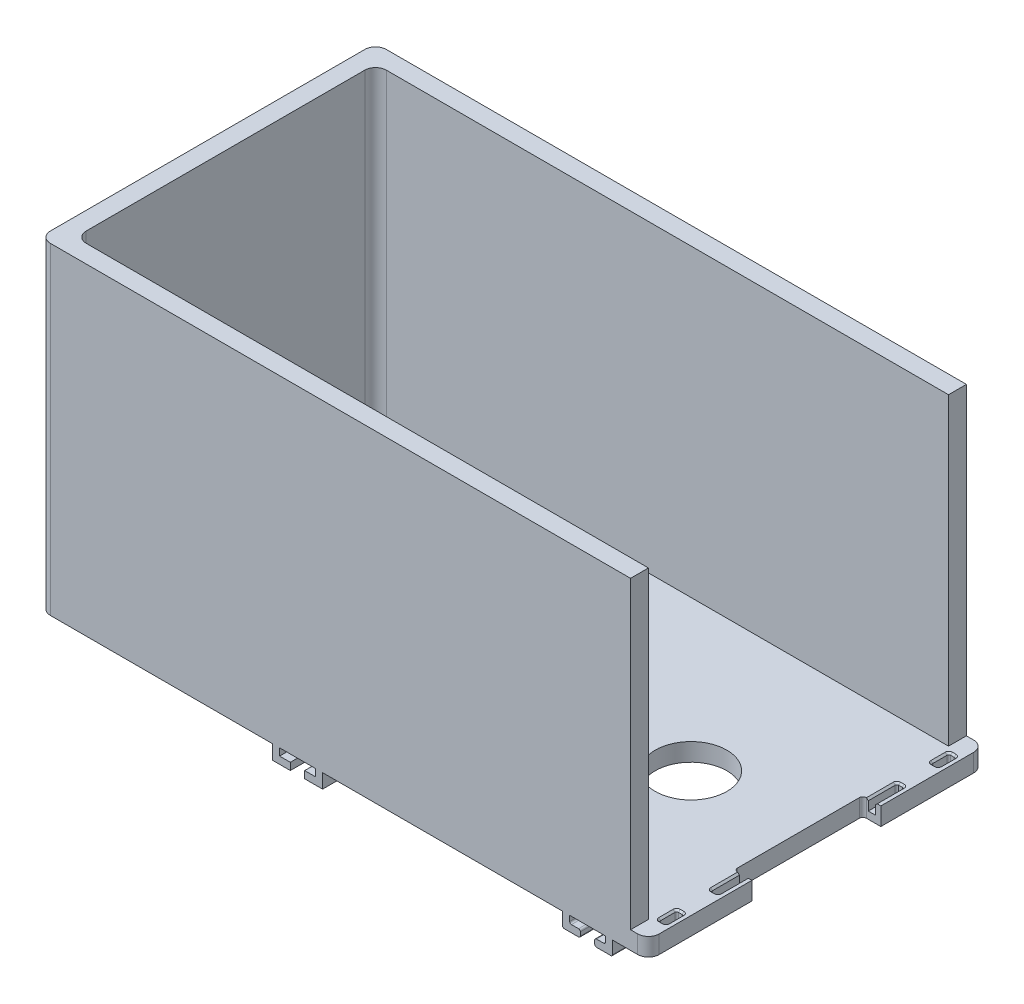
ISO-10303-21;
HEADER;
FILE_DESCRIPTION(('STEP AP214'),'2;1');
FILE_NAME('part.step','',(''),(''),'','','');
FILE_SCHEMA(('AUTOMOTIVE_DESIGN { 1 0 10303 214 1 1 1 1 }'));
ENDSEC;
DATA;
#1=APPLICATION_CONTEXT('core data for automotive mechanical design processes');
#2=APPLICATION_PROTOCOL_DEFINITION('international standard','automotive_design',2000,#1);
#3=PRODUCT_CONTEXT('',#1,'mechanical');
#4=PRODUCT('Part','Part','',(#3));
#5=PRODUCT_RELATED_PRODUCT_CATEGORY('part','',(#4));
#6=PRODUCT_DEFINITION_FORMATION('','',#4);
#7=PRODUCT_DEFINITION_CONTEXT('part definition',#1,'design');
#8=PRODUCT_DEFINITION('design','',#6,#7);
#9=PRODUCT_DEFINITION_SHAPE('','',#8);
#10=(LENGTH_UNIT() NAMED_UNIT(*) SI_UNIT(.MILLI.,.METRE.));
#11=(NAMED_UNIT(*) PLANE_ANGLE_UNIT() SI_UNIT($,.RADIAN.));
#12=(NAMED_UNIT(*) SI_UNIT($,.STERADIAN.) SOLID_ANGLE_UNIT());
#13=UNCERTAINTY_MEASURE_WITH_UNIT(LENGTH_MEASURE(1.E-05),#10,'distance_accuracy_value','');
#14=(GEOMETRIC_REPRESENTATION_CONTEXT(3) GLOBAL_UNCERTAINTY_ASSIGNED_CONTEXT((#13)) GLOBAL_UNIT_ASSIGNED_CONTEXT((#10,
#11,#12)) REPRESENTATION_CONTEXT('',''));
#15=CARTESIAN_POINT('',(0.,0.,0.));
#16=DIRECTION('',(0.,0.,1.));
#17=DIRECTION('',(1.,0.,0.));
#18=AXIS2_PLACEMENT_3D('',#15,#16,#17);
#19=CARTESIAN_POINT('',(0.,5.,0.));
#20=DIRECTION('',(0.,1.,0.));
#21=DIRECTION('',(0.,0.,1.));
#22=AXIS2_PLACEMENT_3D('',#19,#20,#21);
#23=PLANE('',#22);
#24=DIRECTION('',(-1.,0.,0.));
#25=VECTOR('',#24,1.);
#26=CARTESIAN_POINT('',(0.,5.,-35.));
#27=LINE('',#26,#25);
#28=CARTESIAN_POINT('',(83.,5.,-35.));
#29=VERTEX_POINT('',#28);
#30=CARTESIAN_POINT('',(82.,5.,-35.));
#31=VERTEX_POINT('',#30);
#32=EDGE_CURVE('E1540',#29,#31,#27,.T.);
#33=ORIENTED_EDGE('',*,*,#32,.T.);
#34=CARTESIAN_POINT('',(82.,5.,-36.));
#35=DIRECTION('',(0.,1.,0.));
#36=DIRECTION('',(0.,0.,1.));
#37=AXIS2_PLACEMENT_3D('',#34,#35,#36);
#38=CIRCLE('',#37,1.00000000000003);
#39=CARTESIAN_POINT('',(81.,5.,-36.));
#40=VERTEX_POINT('',#39);
#41=EDGE_CURVE('E1542',#31,#40,#38,.F.);
#42=ORIENTED_EDGE('',*,*,#41,.T.);
#43=DIRECTION('',(0.,0.,-1.));
#44=VECTOR('',#43,1.);
#45=CARTESIAN_POINT('',(81.,5.,0.));
#46=LINE('',#45,#44);
#47=CARTESIAN_POINT('',(81.,5.,-40.));
#48=VERTEX_POINT('',#47);
#49=EDGE_CURVE('E1528',#40,#48,#46,.T.);
#50=ORIENTED_EDGE('',*,*,#49,.T.);
#51=CARTESIAN_POINT('',(82.,5.,-40.));
#52=DIRECTION('',(0.,1.,0.));
#53=DIRECTION('',(0.,0.,1.));
#54=AXIS2_PLACEMENT_3D('',#51,#52,#53);
#55=CIRCLE('',#54,1.00000000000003);
#56=CARTESIAN_POINT('',(82.,5.,-41.));
#57=VERTEX_POINT('',#56);
#58=EDGE_CURVE('E1530',#48,#57,#55,.F.);
#59=ORIENTED_EDGE('',*,*,#58,.T.);
#60=DIRECTION('',(1.,0.,0.));
#61=VECTOR('',#60,1.);
#62=CARTESIAN_POINT('',(-1.42247325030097E-13,5.,-40.9999999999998));
#63=LINE('',#62,#61);
#64=CARTESIAN_POINT('',(83.,5.,-41.));
#65=VERTEX_POINT('',#64);
#66=EDGE_CURVE('E1532',#57,#65,#63,.T.);
#67=ORIENTED_EDGE('',*,*,#66,.T.);
#68=CARTESIAN_POINT('',(83.,5.,-40.));
#69=DIRECTION('',(0.,1.,0.));
#70=DIRECTION('',(0.,0.,1.));
#71=AXIS2_PLACEMENT_3D('',#68,#69,#70);
#72=CIRCLE('',#71,1.00000000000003);
#73=CARTESIAN_POINT('',(84.,5.,-40.));
#74=VERTEX_POINT('',#73);
#75=EDGE_CURVE('E1534',#65,#74,#72,.F.);
#76=ORIENTED_EDGE('',*,*,#75,.T.);
#77=DIRECTION('',(0.,0.,1.));
#78=VECTOR('',#77,1.);
#79=CARTESIAN_POINT('',(84.,5.,0.));
#80=LINE('',#79,#78);
#81=CARTESIAN_POINT('',(84.,5.,-36.));
#82=VERTEX_POINT('',#81);
#83=EDGE_CURVE('E1536',#74,#82,#80,.T.);
#84=ORIENTED_EDGE('',*,*,#83,.T.);
#85=CARTESIAN_POINT('',(83.,5.,-36.));
#86=DIRECTION('',(0.,1.,0.));
#87=DIRECTION('',(0.,0.,1.));
#88=AXIS2_PLACEMENT_3D('',#85,#86,#87);
#89=CIRCLE('',#88,1.00000000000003);
#90=EDGE_CURVE('E1538',#82,#29,#89,.F.);
#91=ORIENTED_EDGE('',*,*,#90,.T.);
#92=EDGE_LOOP('',(#33,#42,#50,#59,#67,#76,#84,#91));
#93=FACE_BOUND('',#92,.T.);
#94=DIRECTION('',(0.,0.,-1.));
#95=VECTOR('',#94,1.);
#96=CARTESIAN_POINT('',(81.,5.,36.));
#97=LINE('',#96,#95);
#98=CARTESIAN_POINT('',(81.,5.,40.));
#99=VERTEX_POINT('',#98);
#100=CARTESIAN_POINT('',(81.,5.,36.));
#101=VERTEX_POINT('',#100);
#102=EDGE_CURVE('E1490',#99,#101,#97,.T.);
#103=ORIENTED_EDGE('',*,*,#102,.T.);
#104=CARTESIAN_POINT('',(82.,5.,36.));
#105=DIRECTION('',(0.,1.,0.));
#106=DIRECTION('',(0.,0.,1.));
#107=AXIS2_PLACEMENT_3D('',#104,#105,#106);
#108=CIRCLE('',#107,1.);
#109=CARTESIAN_POINT('',(82.,5.,35.));
#110=VERTEX_POINT('',#109);
#111=EDGE_CURVE('E1504',#101,#110,#108,.F.);
#112=ORIENTED_EDGE('',*,*,#111,.T.);
#113=DIRECTION('',(1.,0.,0.));
#114=VECTOR('',#113,1.);
#115=CARTESIAN_POINT('',(83.,5.,35.));
#116=LINE('',#115,#114);
#117=CARTESIAN_POINT('',(83.,5.,35.));
#118=VERTEX_POINT('',#117);
#119=EDGE_CURVE('E1502',#110,#118,#116,.T.);
#120=ORIENTED_EDGE('',*,*,#119,.T.);
#121=CARTESIAN_POINT('',(83.,5.,36.));
#122=DIRECTION('',(0.,1.,0.));
#123=DIRECTION('',(0.,0.,1.));
#124=AXIS2_PLACEMENT_3D('',#121,#122,#123);
#125=CIRCLE('',#124,1.);
#126=CARTESIAN_POINT('',(84.,5.,36.));
#127=VERTEX_POINT('',#126);
#128=EDGE_CURVE('E1500',#118,#127,#125,.F.);
#129=ORIENTED_EDGE('',*,*,#128,.T.);
#130=DIRECTION('',(0.,0.,1.));
#131=VECTOR('',#130,1.);
#132=CARTESIAN_POINT('',(84.,5.,40.));
#133=LINE('',#132,#131);
#134=CARTESIAN_POINT('',(84.,5.,40.));
#135=VERTEX_POINT('',#134);
#136=EDGE_CURVE('E1498',#127,#135,#133,.T.);
#137=ORIENTED_EDGE('',*,*,#136,.T.);
#138=CARTESIAN_POINT('',(83.,5.,40.));
#139=DIRECTION('',(0.,1.,0.));
#140=DIRECTION('',(0.,0.,1.));
#141=AXIS2_PLACEMENT_3D('',#138,#139,#140);
#142=CIRCLE('',#141,1.);
#143=CARTESIAN_POINT('',(83.,5.,41.));
#144=VERTEX_POINT('',#143);
#145=EDGE_CURVE('E1496',#135,#144,#142,.F.);
#146=ORIENTED_EDGE('',*,*,#145,.T.);
#147=DIRECTION('',(-1.,0.,0.));
#148=VECTOR('',#147,1.);
#149=CARTESIAN_POINT('',(82.,5.,41.));
#150=LINE('',#149,#148);
#151=CARTESIAN_POINT('',(82.,5.,41.));
#152=VERTEX_POINT('',#151);
#153=EDGE_CURVE('E1494',#144,#152,#150,.T.);
#154=ORIENTED_EDGE('',*,*,#153,.T.);
#155=CARTESIAN_POINT('',(82.,5.,40.));
#156=DIRECTION('',(0.,1.,0.));
#157=DIRECTION('',(0.,0.,1.));
#158=AXIS2_PLACEMENT_3D('',#155,#156,#157);
#159=CIRCLE('',#158,1.);
#160=EDGE_CURVE('E1492',#152,#99,#159,.F.);
#161=ORIENTED_EDGE('',*,*,#160,.T.);
#162=EDGE_LOOP('',(#103,#112,#120,#129,#137,#146,#154,#161));
#163=FACE_BOUND('',#162,.T.);
#164=CARTESIAN_POINT('',(83.,5.,-25.5));
#165=DIRECTION('',(0.,1.,0.));
#166=DIRECTION('',(0.,0.,1.));
#167=AXIS2_PLACEMENT_3D('',#164,#165,#166);
#168=CIRCLE('',#167,1.00000000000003);
#169=CARTESIAN_POINT('',(83.,5.,-26.5));
#170=VERTEX_POINT('',#169);
#171=CARTESIAN_POINT('',(84.,5.,-25.5));
#172=VERTEX_POINT('',#171);
#173=EDGE_CURVE('E1523',#170,#172,#168,.F.);
#174=ORIENTED_EDGE('',*,*,#173,.T.);
#175=DIRECTION('',(0.,0.,1.));
#176=VECTOR('',#175,1.);
#177=CARTESIAN_POINT('',(84.,5.,0.));
#178=LINE('',#177,#176);
#179=CARTESIAN_POINT('',(84.,5.,-18.));
#180=VERTEX_POINT('',#179);
#181=EDGE_CURVE('E1525',#172,#180,#178,.T.);
#182=ORIENTED_EDGE('',*,*,#181,.T.);
#183=DIRECTION('',(-1.,0.,0.));
#184=VECTOR('',#183,1.);
#185=CARTESIAN_POINT('',(85.,5.,-18.));
#186=LINE('',#185,#184);
#187=CARTESIAN_POINT('',(85.,5.,-18.));
#188=VERTEX_POINT('',#187);
#189=EDGE_CURVE('E936',#188,#180,#186,.T.);
#190=ORIENTED_EDGE('',*,*,#189,.F.);
#191=DIRECTION('',(0.,0.,1.));
#192=VECTOR('',#191,1.);
#193=CARTESIAN_POINT('',(85.,5.,-46.9));
#194=LINE('',#193,#192);
#195=CARTESIAN_POINT('',(85.,5.,-43.9));
#196=VERTEX_POINT('',#195);
#197=EDGE_CURVE('E2234',#196,#188,#194,.T.);
#198=ORIENTED_EDGE('',*,*,#197,.F.);
#199=CARTESIAN_POINT('',(82.,5.,-43.9));
#200=DIRECTION('',(0.,1.,0.));
#201=DIRECTION('',(0.,0.,1.));
#202=AXIS2_PLACEMENT_3D('',#199,#200,#201);
#203=CIRCLE('',#202,3.);
#204=CARTESIAN_POINT('',(82.,5.,-46.9));
#205=VERTEX_POINT('',#204);
#206=EDGE_CURVE('E1459',#196,#205,#203,.T.);
#207=ORIENTED_EDGE('',*,*,#206,.T.);
#208=DIRECTION('',(1.,0.,0.));
#209=VECTOR('',#208,1.);
#210=CARTESIAN_POINT('',(85.,5.,-46.9));
#211=LINE('',#210,#209);
#212=CARTESIAN_POINT('',(80.,5.,-46.9));
#213=VERTEX_POINT('',#212);
#214=EDGE_CURVE('E2225',#213,#205,#211,.T.);
#215=ORIENTED_EDGE('',*,*,#214,.F.);
#216=DIRECTION('',(0.,0.,-1.));
#217=VECTOR('',#216,1.);
#218=CARTESIAN_POINT('',(80.,5.,-46.9));
#219=LINE('',#218,#217);
#220=CARTESIAN_POINT('',(80.,5.,-41.9));
#221=VERTEX_POINT('',#220);
#222=EDGE_CURVE('E2241',#221,#213,#219,.T.);
#223=ORIENTED_EDGE('',*,*,#222,.F.);
#224=DIRECTION('',(-1.,0.,0.));
#225=VECTOR('',#224,1.);
#226=CARTESIAN_POINT('',(-85.,5.,-41.9));
#227=LINE('',#226,#225);
#228=CARTESIAN_POINT('',(-77.,5.,-41.9));
#229=VERTEX_POINT('',#228);
#230=EDGE_CURVE('E2160',#221,#229,#227,.T.);
#231=ORIENTED_EDGE('',*,*,#230,.T.);
#232=CARTESIAN_POINT('',(-77.,5.,-38.9));
#233=DIRECTION('',(0.,1.,0.));
#234=DIRECTION('',(0.,0.,1.));
#235=AXIS2_PLACEMENT_3D('',#232,#233,#234);
#236=CIRCLE('',#235,3.);
#237=CARTESIAN_POINT('',(-80.,5.,-38.9));
#238=VERTEX_POINT('',#237);
#239=EDGE_CURVE('E2164',#229,#238,#236,.T.);
#240=ORIENTED_EDGE('',*,*,#239,.T.);
#241=DIRECTION('',(0.,0.,1.));
#242=VECTOR('',#241,1.);
#243=CARTESIAN_POINT('',(-80.,5.,-46.9));
#244=LINE('',#243,#242);
#245=CARTESIAN_POINT('',(-80.,5.,38.9));
#246=VERTEX_POINT('',#245);
#247=EDGE_CURVE('E2152',#238,#246,#244,.T.);
#248=ORIENTED_EDGE('',*,*,#247,.T.);
#249=CARTESIAN_POINT('',(-77.,5.,38.9));
#250=DIRECTION('',(0.,1.,0.));
#251=DIRECTION('',(0.,0.,1.));
#252=AXIS2_PLACEMENT_3D('',#249,#250,#251);
#253=CIRCLE('',#252,3.);
#254=CARTESIAN_POINT('',(-77.,5.,41.9));
#255=VERTEX_POINT('',#254);
#256=EDGE_CURVE('E2182',#246,#255,#253,.T.);
#257=ORIENTED_EDGE('',*,*,#256,.T.);
#258=DIRECTION('',(1.,0.,0.));
#259=VECTOR('',#258,1.);
#260=CARTESIAN_POINT('',(-85.,5.,41.9));
#261=LINE('',#260,#259);
#262=CARTESIAN_POINT('',(80.,5.,41.9));
#263=VERTEX_POINT('',#262);
#264=EDGE_CURVE('E2159',#255,#263,#261,.T.);
#265=ORIENTED_EDGE('',*,*,#264,.T.);
#266=CARTESIAN_POINT('',(80.,5.,46.9));
#267=VERTEX_POINT('',#266);
#268=EDGE_CURVE('E2249',#267,#263,#219,.T.);
#269=ORIENTED_EDGE('',*,*,#268,.F.);
#270=DIRECTION('',(-1.,0.,0.));
#271=VECTOR('',#270,1.);
#272=CARTESIAN_POINT('',(85.,5.,46.9));
#273=LINE('',#272,#271);
#274=CARTESIAN_POINT('',(82.,5.,46.9));
#275=VERTEX_POINT('',#274);
#276=EDGE_CURVE('E2247',#275,#267,#273,.T.);
#277=ORIENTED_EDGE('',*,*,#276,.F.);
#278=CARTESIAN_POINT('',(82.,5.,43.9));
#279=DIRECTION('',(0.,1.,0.));
#280=DIRECTION('',(0.,0.,1.));
#281=AXIS2_PLACEMENT_3D('',#278,#279,#280);
#282=CIRCLE('',#281,3.);
#283=CARTESIAN_POINT('',(85.,5.,43.9));
#284=VERTEX_POINT('',#283);
#285=EDGE_CURVE('E1456',#275,#284,#282,.T.);
#286=ORIENTED_EDGE('',*,*,#285,.T.);
#287=CARTESIAN_POINT('',(85.,5.,18.));
#288=VERTEX_POINT('',#287);
#289=EDGE_CURVE('E2246',#288,#284,#194,.T.);
#290=ORIENTED_EDGE('',*,*,#289,.F.);
#291=DIRECTION('',(1.,0.,0.));
#292=VECTOR('',#291,1.);
#293=CARTESIAN_POINT('',(80.,5.,18.));
#294=LINE('',#293,#292);
#295=CARTESIAN_POINT('',(84.,5.,18.));
#296=VERTEX_POINT('',#295);
#297=EDGE_CURVE('E944',#296,#288,#294,.T.);
#298=ORIENTED_EDGE('',*,*,#297,.F.);
#299=DIRECTION('',(0.,0.,1.));
#300=VECTOR('',#299,1.);
#301=CARTESIAN_POINT('',(84.,5.,25.5));
#302=LINE('',#301,#300);
#303=CARTESIAN_POINT('',(84.,5.,25.5));
#304=VERTEX_POINT('',#303);
#305=EDGE_CURVE('E1515',#296,#304,#302,.T.);
#306=ORIENTED_EDGE('',*,*,#305,.T.);
#307=CARTESIAN_POINT('',(83.,5.,25.5));
#308=DIRECTION('',(0.,1.,0.));
#309=DIRECTION('',(0.,0.,1.));
#310=AXIS2_PLACEMENT_3D('',#307,#308,#309);
#311=CIRCLE('',#310,1.);
#312=CARTESIAN_POINT('',(83.,5.,26.5));
#313=VERTEX_POINT('',#312);
#314=EDGE_CURVE('E1513',#304,#313,#311,.F.);
#315=ORIENTED_EDGE('',*,*,#314,.T.);
#316=DIRECTION('',(-1.,0.,0.));
#317=VECTOR('',#316,1.);
#318=CARTESIAN_POINT('',(82.,5.,26.5));
#319=LINE('',#318,#317);
#320=CARTESIAN_POINT('',(82.,5.,26.5));
#321=VERTEX_POINT('',#320);
#322=EDGE_CURVE('E1511',#313,#321,#319,.T.);
#323=ORIENTED_EDGE('',*,*,#322,.T.);
#324=CARTESIAN_POINT('',(82.,5.,25.5));
#325=DIRECTION('',(0.,1.,0.));
#326=DIRECTION('',(0.,0.,1.));
#327=AXIS2_PLACEMENT_3D('',#324,#325,#326);
#328=CIRCLE('',#327,1.);
#329=CARTESIAN_POINT('',(81.,5.,25.5));
#330=VERTEX_POINT('',#329);
#331=EDGE_CURVE('E1509',#321,#330,#328,.F.);
#332=ORIENTED_EDGE('',*,*,#331,.T.);
#333=DIRECTION('',(0.,0.,-1.));
#334=VECTOR('',#333,1.);
#335=CARTESIAN_POINT('',(81.,5.,18.));
#336=LINE('',#335,#334);
#337=CARTESIAN_POINT('',(81.,5.,18.));
#338=VERTEX_POINT('',#337);
#339=EDGE_CURVE('E1507',#330,#338,#336,.T.);
#340=ORIENTED_EDGE('',*,*,#339,.T.);
#341=CARTESIAN_POINT('',(81.,5.,17.));
#342=DIRECTION('',(0.,1.,0.));
#343=DIRECTION('',(0.,0.,1.));
#344=AXIS2_PLACEMENT_3D('',#341,#342,#343);
#345=CIRCLE('',#344,1.);
#346=CARTESIAN_POINT('',(80.,5.,17.));
#347=VERTEX_POINT('',#346);
#348=EDGE_CURVE('E1486',#338,#347,#345,.F.);
#349=ORIENTED_EDGE('',*,*,#348,.T.);
#350=DIRECTION('',(0.,0.,1.));
#351=VECTOR('',#350,1.);
#352=CARTESIAN_POINT('',(80.,5.,-18.));
#353=LINE('',#352,#351);
#354=CARTESIAN_POINT('',(80.,5.,-17.));
#355=VERTEX_POINT('',#354);
#356=EDGE_CURVE('E941',#355,#347,#353,.T.);
#357=ORIENTED_EDGE('',*,*,#356,.F.);
#358=CARTESIAN_POINT('',(81.,5.,-17.));
#359=DIRECTION('',(0.,1.,0.));
#360=DIRECTION('',(0.,0.,1.));
#361=AXIS2_PLACEMENT_3D('',#358,#359,#360);
#362=CIRCLE('',#361,1.);
#363=CARTESIAN_POINT('',(81.,5.,-18.));
#364=VERTEX_POINT('',#363);
#365=EDGE_CURVE('E1481',#355,#364,#362,.F.);
#366=ORIENTED_EDGE('',*,*,#365,.T.);
#367=DIRECTION('',(0.,0.,-1.));
#368=VECTOR('',#367,1.);
#369=CARTESIAN_POINT('',(81.,5.,0.));
#370=LINE('',#369,#368);
#371=CARTESIAN_POINT('',(81.,5.,-25.5));
#372=VERTEX_POINT('',#371);
#373=EDGE_CURVE('E1517',#364,#372,#370,.T.);
#374=ORIENTED_EDGE('',*,*,#373,.T.);
#375=CARTESIAN_POINT('',(82.,5.,-25.5));
#376=DIRECTION('',(0.,1.,0.));
#377=DIRECTION('',(0.,0.,1.));
#378=AXIS2_PLACEMENT_3D('',#375,#376,#377);
#379=CIRCLE('',#378,1.00000000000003);
#380=CARTESIAN_POINT('',(82.,5.,-26.5));
#381=VERTEX_POINT('',#380);
#382=EDGE_CURVE('E1519',#372,#381,#379,.F.);
#383=ORIENTED_EDGE('',*,*,#382,.T.);
#384=DIRECTION('',(1.,0.,0.));
#385=VECTOR('',#384,1.);
#386=CARTESIAN_POINT('',(0.,5.,-26.4999999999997));
#387=LINE('',#386,#385);
#388=EDGE_CURVE('E1521',#381,#170,#387,.T.);
#389=ORIENTED_EDGE('',*,*,#388,.T.);
#390=EDGE_LOOP('',(#174,#182,#190,#198,#207,#215,#223,#231,#240,#248,#257,#265,#269,#277,#286,
#290,#298,#306,#315,#323,#332,#340,#349,#357,#366,#374,#383,#389));
#391=FACE_BOUND('',#390,.T.);
#392=CARTESIAN_POINT('',(0.,5.,0.));
#393=DIRECTION('',(0.,1.,0.));
#394=DIRECTION('',(0.,0.,1.));
#395=AXIS2_PLACEMENT_3D('',#392,#393,#394);
#396=CIRCLE('',#395,10.);
#397=CARTESIAN_POINT('',(0.,5.,-10.));
#398=VERTEX_POINT('',#397);
#399=EDGE_CURVE('E2252',#398,#398,#396,.F.);
#400=ORIENTED_EDGE('',*,*,#399,.T.);
#401=EDGE_LOOP('',(#400));
#402=FACE_BOUND('',#401,.T.);
#403=CARTESIAN_POINT('',(50.,5.,0.));
#404=DIRECTION('',(0.,1.,0.));
#405=DIRECTION('',(0.,0.,1.));
#406=AXIS2_PLACEMENT_3D('',#403,#404,#405);
#407=CIRCLE('',#406,10.);
#408=CARTESIAN_POINT('',(50.,5.,-10.));
#409=VERTEX_POINT('',#408);
#410=EDGE_CURVE('E2258',#409,#409,#407,.F.);
#411=ORIENTED_EDGE('',*,*,#410,.T.);
#412=EDGE_LOOP('',(#411));
#413=FACE_BOUND('',#412,.T.);
#414=CARTESIAN_POINT('',(-50.,5.,0.));
#415=DIRECTION('',(0.,1.,0.));
#416=DIRECTION('',(0.,0.,1.));
#417=AXIS2_PLACEMENT_3D('',#414,#415,#416);
#418=CIRCLE('',#417,10.);
#419=CARTESIAN_POINT('',(-50.,5.,-10.));
#420=VERTEX_POINT('',#419);
#421=EDGE_CURVE('E2264',#420,#420,#418,.F.);
#422=ORIENTED_EDGE('',*,*,#421,.T.);
#423=EDGE_LOOP('',(#422));
#424=FACE_BOUND('',#423,.T.);
#425=ADVANCED_FACE('F37',(#93,#163,#391,#402,#413,#424),#23,.T.);
#426=CARTESIAN_POINT('',(85.,90.,-46.9));
#427=DIRECTION('',(-1.,0.,0.));
#428=DIRECTION('',(0.,0.,1.));
#429=AXIS2_PLACEMENT_3D('',#426,#427,#428);
#430=PLANE('',#429);
#431=ORIENTED_EDGE('',*,*,#197,.T.);
#432=DIRECTION('',(0.,1.,0.));
#433=VECTOR('',#432,1.);
#434=CARTESIAN_POINT('',(85.,-4.,-18.));
#435=LINE('',#434,#433);
#436=CARTESIAN_POINT('',(85.,0.,-18.));
#437=VERTEX_POINT('',#436);
#438=EDGE_CURVE('E947',#437,#188,#435,.T.);
#439=ORIENTED_EDGE('',*,*,#438,.F.);
#440=DIRECTION('',(0.,0.,-1.));
#441=VECTOR('',#440,1.);
#442=CARTESIAN_POINT('',(85.,0.,-46.9));
#443=LINE('',#442,#441);
#444=CARTESIAN_POINT('',(85.,0.,-43.9));
#445=VERTEX_POINT('',#444);
#446=EDGE_CURVE('E2231',#437,#445,#443,.T.);
#447=ORIENTED_EDGE('',*,*,#446,.T.);
#448=DIRECTION('',(0.,-1.,0.));
#449=VECTOR('',#448,1.);
#450=CARTESIAN_POINT('',(85.,90.,-43.9));
#451=LINE('',#450,#449);
#452=EDGE_CURVE('E1454',#445,#196,#451,.F.);
#453=ORIENTED_EDGE('',*,*,#452,.T.);
#454=EDGE_LOOP('',(#431,#439,#447,#453));
#455=FACE_BOUND('',#454,.T.);
#456=ADVANCED_FACE('F1733',(#455),#430,.F.);
#457=CARTESIAN_POINT('',(-8.00000000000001,-2.,53.3031242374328));
#458=DIRECTION('',(-1.,0.,0.));
#459=DIRECTION('',(0.,0.,1.));
#460=AXIS2_PLACEMENT_3D('',#457,#458,#459);
#461=PLANE('',#460);
#462=DIRECTION('',(0.,0.,-1.));
#463=VECTOR('',#462,1.);
#464=CARTESIAN_POINT('',(-8.00000000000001,-2.,53.3031242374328));
#465=LINE('',#464,#463);
#466=CARTESIAN_POINT('',(-8.00000000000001,-2.,-40.));
#467=VERTEX_POINT('',#466);
#468=CARTESIAN_POINT('',(-8.00000000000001,-2.,-46.9));
#469=VERTEX_POINT('',#468);
#470=EDGE_CURVE('E1092',#467,#469,#465,.T.);
#471=ORIENTED_EDGE('',*,*,#470,.F.);
#472=DIRECTION('',(0.,-1.,0.));
#473=VECTOR('',#472,1.);
#474=CARTESIAN_POINT('',(-8.00000000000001,0.,-40.));
#475=LINE('',#474,#473);
#476=CARTESIAN_POINT('',(-8.00000000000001,0.,-40.));
#477=VERTEX_POINT('',#476);
#478=EDGE_CURVE('E1007',#477,#467,#475,.T.);
#479=ORIENTED_EDGE('',*,*,#478,.F.);
#480=DIRECTION('',(0.,0.,-1.));
#481=VECTOR('',#480,1.);
#482=CARTESIAN_POINT('',(-8.00000000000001,0.,53.3031242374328));
#483=LINE('',#482,#481);
#484=CARTESIAN_POINT('',(-8.00000000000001,0.,-46.9));
#485=VERTEX_POINT('',#484);
#486=EDGE_CURVE('E1089',#477,#485,#483,.T.);
#487=ORIENTED_EDGE('',*,*,#486,.T.);
#488=DIRECTION('',(0.,1.,0.));
#489=VECTOR('',#488,1.);
#490=CARTESIAN_POINT('',(-8.00000000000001,-2.,-46.9));
#491=LINE('',#490,#489);
#492=EDGE_CURVE('E1046',#469,#485,#491,.T.);
#493=ORIENTED_EDGE('',*,*,#492,.F.);
#494=EDGE_LOOP('',(#471,#479,#487,#493));
#495=FACE_BOUND('',#494,.T.);
#496=ADVANCED_FACE('F1739',(#495),#461,.T.);
#497=CARTESIAN_POINT('',(-11.,-2.,53.3031242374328));
#498=DIRECTION('',(0.,1.,0.));
#499=DIRECTION('',(-1.,0.,0.));
#500=AXIS2_PLACEMENT_3D('',#497,#498,#499);
#501=PLANE('',#500);
#502=DIRECTION('',(0.,0.,-1.));
#503=VECTOR('',#502,1.);
#504=CARTESIAN_POINT('',(-11.,-2.,53.3031242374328));
#505=LINE('',#504,#503);
#506=CARTESIAN_POINT('',(-11.,-2.,-40.));
#507=VERTEX_POINT('',#506);
#508=CARTESIAN_POINT('',(-11.,-2.,-46.9));
#509=VERTEX_POINT('',#508);
#510=EDGE_CURVE('E1096',#507,#509,#505,.T.);
#511=ORIENTED_EDGE('',*,*,#510,.F.);
#512=DIRECTION('',(-1.,0.,0.));
#513=VECTOR('',#512,1.);
#514=CARTESIAN_POINT('',(-8.00000000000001,-2.,-40.));
#515=LINE('',#514,#513);
#516=EDGE_CURVE('E1009',#467,#507,#515,.T.);
#517=ORIENTED_EDGE('',*,*,#516,.F.);
#518=ORIENTED_EDGE('',*,*,#470,.T.);
#519=DIRECTION('',(1.,0.,0.));
#520=VECTOR('',#519,1.);
#521=CARTESIAN_POINT('',(-11.,-2.,-46.9));
#522=LINE('',#521,#520);
#523=EDGE_CURVE('E1086',#509,#469,#522,.T.);
#524=ORIENTED_EDGE('',*,*,#523,.F.);
#525=EDGE_LOOP('',(#511,#517,#518,#524));
#526=FACE_BOUND('',#525,.T.);
#527=ADVANCED_FACE('F2018',(#526),#501,.T.);
#528=CARTESIAN_POINT('',(-11.,-4.,53.3031242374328));
#529=DIRECTION('',(-1.,0.,0.));
#530=DIRECTION('',(0.,0.,1.));
#531=AXIS2_PLACEMENT_3D('',#528,#529,#530);
#532=PLANE('',#531);
#533=DIRECTION('',(0.,0.,-1.));
#534=VECTOR('',#533,1.);
#535=CARTESIAN_POINT('',(-11.,-4.,53.3031242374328));
#536=LINE('',#535,#534);
#537=CARTESIAN_POINT('',(-11.,-4.,-40.));
#538=VERTEX_POINT('',#537);
#539=CARTESIAN_POINT('',(-11.,-4.,-46.9));
#540=VERTEX_POINT('',#539);
#541=EDGE_CURVE('E1100',#538,#540,#536,.T.);
#542=ORIENTED_EDGE('',*,*,#541,.F.);
#543=DIRECTION('',(0.,-1.,0.));
#544=VECTOR('',#543,1.);
#545=CARTESIAN_POINT('',(-11.,-2.,-40.));
#546=LINE('',#545,#544);
#547=EDGE_CURVE('E1011',#507,#538,#546,.T.);
#548=ORIENTED_EDGE('',*,*,#547,.F.);
#549=ORIENTED_EDGE('',*,*,#510,.T.);
#550=DIRECTION('',(0.,1.,0.));
#551=VECTOR('',#550,1.);
#552=CARTESIAN_POINT('',(-11.,-4.,-46.9));
#553=LINE('',#552,#551);
#554=EDGE_CURVE('E1083',#540,#509,#553,.T.);
#555=ORIENTED_EDGE('',*,*,#554,.F.);
#556=EDGE_LOOP('',(#542,#548,#549,#555));
#557=FACE_BOUND('',#556,.T.);
#558=ADVANCED_FACE('F2023',(#557),#532,.T.);
#559=CARTESIAN_POINT('',(-6.00000000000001,-4.,53.3031242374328));
#560=DIRECTION('',(0.,-1.,0.));
#561=DIRECTION('',(1.,0.,0.));
#562=AXIS2_PLACEMENT_3D('',#559,#560,#561);
#563=PLANE('',#562);
#564=DIRECTION('',(0.,0.,-1.));
#565=VECTOR('',#564,1.);
#566=CARTESIAN_POINT('',(-6.00000000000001,-4.,53.3031242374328));
#567=LINE('',#566,#565);
#568=CARTESIAN_POINT('',(-6.00000000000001,-4.,-40.));
#569=VERTEX_POINT('',#568);
#570=CARTESIAN_POINT('',(-6.00000000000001,-4.,-46.9));
#571=VERTEX_POINT('',#570);
#572=EDGE_CURVE('E1104',#569,#571,#567,.T.);
#573=ORIENTED_EDGE('',*,*,#572,.F.);
#574=DIRECTION('',(1.,0.,0.));
#575=VECTOR('',#574,1.);
#576=CARTESIAN_POINT('',(-11.,-4.,-40.));
#577=LINE('',#576,#575);
#578=EDGE_CURVE('E1013',#538,#569,#577,.T.);
#579=ORIENTED_EDGE('',*,*,#578,.F.);
#580=ORIENTED_EDGE('',*,*,#541,.T.);
#581=DIRECTION('',(-1.,0.,0.));
#582=VECTOR('',#581,1.);
#583=CARTESIAN_POINT('',(-6.00000000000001,-4.,-46.9));
#584=LINE('',#583,#582);
#585=EDGE_CURVE('E1080',#571,#540,#584,.T.);
#586=ORIENTED_EDGE('',*,*,#585,.F.);
#587=EDGE_LOOP('',(#573,#579,#580,#586));
#588=FACE_BOUND('',#587,.T.);
#589=ADVANCED_FACE('F2027',(#588),#563,.T.);
#590=CARTESIAN_POINT('',(-6.00000000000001,0.,53.3031242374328));
#591=DIRECTION('',(1.,0.,0.));
#592=DIRECTION('',(0.,0.,-1.));
#593=AXIS2_PLACEMENT_3D('',#590,#591,#592);
#594=PLANE('',#593);
#595=DIRECTION('',(0.,0.,-1.));
#596=VECTOR('',#595,1.);
#597=CARTESIAN_POINT('',(-6.00000000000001,0.,53.3031242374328));
#598=LINE('',#597,#596);
#599=CARTESIAN_POINT('',(-6.00000000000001,0.,-40.));
#600=VERTEX_POINT('',#599);
#601=CARTESIAN_POINT('',(-6.00000000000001,0.,-46.9));
#602=VERTEX_POINT('',#601);
#603=EDGE_CURVE('E1108',#600,#602,#598,.T.);
#604=ORIENTED_EDGE('',*,*,#603,.F.);
#605=DIRECTION('',(0.,1.,0.));
#606=VECTOR('',#605,1.);
#607=CARTESIAN_POINT('',(-6.00000000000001,-4.,-40.));
#608=LINE('',#607,#606);
#609=EDGE_CURVE('E1001',#569,#600,#608,.T.);
#610=ORIENTED_EDGE('',*,*,#609,.F.);
#611=ORIENTED_EDGE('',*,*,#572,.T.);
#612=DIRECTION('',(0.,-1.,0.));
#613=VECTOR('',#612,1.);
#614=CARTESIAN_POINT('',(-6.00000000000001,0.,-46.9));
#615=LINE('',#614,#613);
#616=EDGE_CURVE('E1077',#602,#571,#615,.T.);
#617=ORIENTED_EDGE('',*,*,#616,.F.);
#618=EDGE_LOOP('',(#604,#610,#611,#617));
#619=FACE_BOUND('',#618,.T.);
#620=ADVANCED_FACE('F2031',(#619),#594,.T.);
#621=CARTESIAN_POINT('',(-20.,0.,53.3031242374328));
#622=DIRECTION('',(-1.,0.,0.));
#623=DIRECTION('',(0.,0.,1.));
#624=AXIS2_PLACEMENT_3D('',#621,#622,#623);
#625=PLANE('',#624);
#626=DIRECTION('',(0.,0.,-1.));
#627=VECTOR('',#626,1.);
#628=CARTESIAN_POINT('',(-20.,-4.,53.3031242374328));
#629=LINE('',#628,#627);
#630=CARTESIAN_POINT('',(-20.,-4.,-40.));
#631=VERTEX_POINT('',#630);
#632=CARTESIAN_POINT('',(-20.,-4.,-46.9));
#633=VERTEX_POINT('',#632);
#634=EDGE_CURVE('E1143',#631,#633,#629,.T.);
#635=ORIENTED_EDGE('',*,*,#634,.F.);
#636=DIRECTION('',(0.,-1.,0.));
#637=VECTOR('',#636,1.);
#638=CARTESIAN_POINT('',(-20.,0.,-40.));
#639=LINE('',#638,#637);
#640=CARTESIAN_POINT('',(-20.,0.,-40.));
#641=VERTEX_POINT('',#640);
#642=EDGE_CURVE('E1034',#641,#631,#639,.T.);
#643=ORIENTED_EDGE('',*,*,#642,.F.);
#644=DIRECTION('',(0.,0.,-1.));
#645=VECTOR('',#644,1.);
#646=CARTESIAN_POINT('',(-20.,0.,53.3031242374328));
#647=LINE('',#646,#645);
#648=CARTESIAN_POINT('',(-20.,0.,-46.9));
#649=VERTEX_POINT('',#648);
#650=EDGE_CURVE('E1139',#641,#649,#647,.T.);
#651=ORIENTED_EDGE('',*,*,#650,.T.);
#652=DIRECTION('',(0.,1.,0.));
#653=VECTOR('',#652,1.);
#654=CARTESIAN_POINT('',(-20.,0.,-46.9));
#655=LINE('',#654,#653);
#656=EDGE_CURVE('E1133',#633,#649,#655,.T.);
#657=ORIENTED_EDGE('',*,*,#656,.F.);
#658=EDGE_LOOP('',(#635,#643,#651,#657));
#659=FACE_BOUND('',#658,.T.);
#660=ADVANCED_FACE('F2042',(#659),#625,.T.);
#661=CARTESIAN_POINT('',(-20.,-4.,53.3031242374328));
#662=DIRECTION('',(0.,-1.,0.));
#663=DIRECTION('',(0.,0.,-1.));
#664=AXIS2_PLACEMENT_3D('',#661,#662,#663);
#665=PLANE('',#664);
#666=DIRECTION('',(0.,0.,-1.));
#667=VECTOR('',#666,1.);
#668=CARTESIAN_POINT('',(-15.,-4.,53.3031242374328));
#669=LINE('',#668,#667);
#670=CARTESIAN_POINT('',(-15.,-4.,-40.));
#671=VERTEX_POINT('',#670);
#672=CARTESIAN_POINT('',(-15.,-4.,-46.9));
#673=VERTEX_POINT('',#672);
#674=EDGE_CURVE('E1147',#671,#673,#669,.T.);
#675=ORIENTED_EDGE('',*,*,#674,.F.);
#676=DIRECTION('',(1.,0.,0.));
#677=VECTOR('',#676,1.);
#678=CARTESIAN_POINT('',(-20.,-4.,-40.));
#679=LINE('',#678,#677);
#680=EDGE_CURVE('E1037',#631,#671,#679,.T.);
#681=ORIENTED_EDGE('',*,*,#680,.F.);
#682=ORIENTED_EDGE('',*,*,#634,.T.);
#683=DIRECTION('',(-1.,0.,0.));
#684=VECTOR('',#683,1.);
#685=CARTESIAN_POINT('',(-20.,-4.,-46.9));
#686=LINE('',#685,#684);
#687=EDGE_CURVE('E1130',#673,#633,#686,.T.);
#688=ORIENTED_EDGE('',*,*,#687,.F.);
#689=EDGE_LOOP('',(#675,#681,#682,#688));
#690=FACE_BOUND('',#689,.T.);
#691=ADVANCED_FACE('F2047',(#690),#665,.T.);
#692=CARTESIAN_POINT('',(-15.,-4.,53.3031242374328));
#693=DIRECTION('',(1.,0.,0.));
#694=DIRECTION('',(0.,0.,-1.));
#695=AXIS2_PLACEMENT_3D('',#692,#693,#694);
#696=PLANE('',#695);
#697=DIRECTION('',(0.,0.,-1.));
#698=VECTOR('',#697,1.);
#699=CARTESIAN_POINT('',(-15.,-2.,53.3031242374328));
#700=LINE('',#699,#698);
#701=CARTESIAN_POINT('',(-15.,-2.,-40.));
#702=VERTEX_POINT('',#701);
#703=CARTESIAN_POINT('',(-15.,-2.,-46.9));
#704=VERTEX_POINT('',#703);
#705=EDGE_CURVE('E1151',#702,#704,#700,.T.);
#706=ORIENTED_EDGE('',*,*,#705,.F.);
#707=DIRECTION('',(0.,1.,0.));
#708=VECTOR('',#707,1.);
#709=CARTESIAN_POINT('',(-15.,-4.,-40.));
#710=LINE('',#709,#708);
#711=EDGE_CURVE('E1039',#671,#702,#710,.T.);
#712=ORIENTED_EDGE('',*,*,#711,.F.);
#713=ORIENTED_EDGE('',*,*,#674,.T.);
#714=DIRECTION('',(0.,-1.,0.));
#715=VECTOR('',#714,1.);
#716=CARTESIAN_POINT('',(-15.,-4.,-46.9));
#717=LINE('',#716,#715);
#718=EDGE_CURVE('E1127',#704,#673,#717,.T.);
#719=ORIENTED_EDGE('',*,*,#718,.F.);
#720=EDGE_LOOP('',(#706,#712,#713,#719));
#721=FACE_BOUND('',#720,.T.);
#722=ADVANCED_FACE('F2052',(#721),#696,.T.);
#723=CARTESIAN_POINT('',(-15.,-2.,53.3031242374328));
#724=DIRECTION('',(0.,1.,0.));
#725=DIRECTION('',(0.,0.,1.));
#726=AXIS2_PLACEMENT_3D('',#723,#724,#725);
#727=PLANE('',#726);
#728=DIRECTION('',(0.,0.,-1.));
#729=VECTOR('',#728,1.);
#730=CARTESIAN_POINT('',(-18.,-2.,53.3031242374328));
#731=LINE('',#730,#729);
#732=CARTESIAN_POINT('',(-18.,-2.,-40.));
#733=VERTEX_POINT('',#732);
#734=CARTESIAN_POINT('',(-18.,-2.,-46.9));
#735=VERTEX_POINT('',#734);
#736=EDGE_CURVE('E1155',#733,#735,#731,.T.);
#737=ORIENTED_EDGE('',*,*,#736,.F.);
#738=DIRECTION('',(-1.,0.,0.));
#739=VECTOR('',#738,1.);
#740=CARTESIAN_POINT('',(-15.,-2.,-40.));
#741=LINE('',#740,#739);
#742=EDGE_CURVE('E1041',#702,#733,#741,.T.);
#743=ORIENTED_EDGE('',*,*,#742,.F.);
#744=ORIENTED_EDGE('',*,*,#705,.T.);
#745=DIRECTION('',(1.,0.,0.));
#746=VECTOR('',#745,1.);
#747=CARTESIAN_POINT('',(-15.,-2.,-46.9));
#748=LINE('',#747,#746);
#749=EDGE_CURVE('E1124',#735,#704,#748,.T.);
#750=ORIENTED_EDGE('',*,*,#749,.F.);
#751=EDGE_LOOP('',(#737,#743,#744,#750));
#752=FACE_BOUND('',#751,.T.);
#753=ADVANCED_FACE('F2056',(#752),#727,.T.);
#754=CARTESIAN_POINT('',(-18.,-2.,53.3031242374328));
#755=DIRECTION('',(1.,0.,0.));
#756=DIRECTION('',(0.,0.,-1.));
#757=AXIS2_PLACEMENT_3D('',#754,#755,#756);
#758=PLANE('',#757);
#759=DIRECTION('',(0.,0.,-1.));
#760=VECTOR('',#759,1.);
#761=CARTESIAN_POINT('',(-18.,0.,53.3031242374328));
#762=LINE('',#761,#760);
#763=CARTESIAN_POINT('',(-18.,0.,-40.));
#764=VERTEX_POINT('',#763);
#765=CARTESIAN_POINT('',(-18.,0.,-46.9));
#766=VERTEX_POINT('',#765);
#767=EDGE_CURVE('E1136',#764,#766,#762,.T.);
#768=ORIENTED_EDGE('',*,*,#767,.F.);
#769=DIRECTION('',(0.,1.,0.));
#770=VECTOR('',#769,1.);
#771=CARTESIAN_POINT('',(-18.,-2.,-40.));
#772=LINE('',#771,#770);
#773=EDGE_CURVE('E1043',#733,#764,#772,.T.);
#774=ORIENTED_EDGE('',*,*,#773,.F.);
#775=ORIENTED_EDGE('',*,*,#736,.T.);
#776=DIRECTION('',(0.,-1.,0.));
#777=VECTOR('',#776,1.);
#778=CARTESIAN_POINT('',(-18.,-2.,-46.9));
#779=LINE('',#778,#777);
#780=EDGE_CURVE('E1074',#766,#735,#779,.T.);
#781=ORIENTED_EDGE('',*,*,#780,.F.);
#782=EDGE_LOOP('',(#768,#774,#775,#781));
#783=FACE_BOUND('',#782,.T.);
#784=ADVANCED_FACE('F2060',(#783),#758,.T.);
#785=CARTESIAN_POINT('',(73.,-2.,53.3031242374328));
#786=DIRECTION('',(-1.,0.,0.));
#787=DIRECTION('',(0.,0.,1.));
#788=AXIS2_PLACEMENT_3D('',#785,#786,#787);
#789=PLANE('',#788);
#790=DIRECTION('',(0.,1.,0.));
#791=VECTOR('',#790,1.);
#792=CARTESIAN_POINT('',(73.,-2.,-46.9));
#793=LINE('',#792,#791);
#794=CARTESIAN_POINT('',(73.,-1.5,-46.9));
#795=VERTEX_POINT('',#794);
#796=CARTESIAN_POINT('',(73.,0.,-46.9));
#797=VERTEX_POINT('',#796);
#798=EDGE_CURVE('E1212',#795,#797,#793,.T.);
#799=ORIENTED_EDGE('',*,*,#798,.F.);
#800=DIRECTION('',(0.,0.,-1.));
#801=VECTOR('',#800,1.);
#802=CARTESIAN_POINT('',(73.,-1.5,-40.));
#803=LINE('',#802,#801);
#804=CARTESIAN_POINT('',(73.,-1.5,-40.));
#805=VERTEX_POINT('',#804);
#806=EDGE_CURVE('E2411',#795,#805,#803,.F.);
#807=ORIENTED_EDGE('',*,*,#806,.T.);
#808=DIRECTION('',(0.,-1.,0.));
#809=VECTOR('',#808,1.);
#810=CARTESIAN_POINT('',(73.,0.,-40.));
#811=LINE('',#810,#809);
#812=CARTESIAN_POINT('',(73.,0.,-40.));
#813=VERTEX_POINT('',#812);
#814=EDGE_CURVE('E1167',#813,#805,#811,.T.);
#815=ORIENTED_EDGE('',*,*,#814,.F.);
#816=DIRECTION('',(0.,0.,-1.));
#817=VECTOR('',#816,1.);
#818=CARTESIAN_POINT('',(73.,0.,53.3031242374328));
#819=LINE('',#818,#817);
#820=EDGE_CURVE('E1257',#813,#797,#819,.T.);
#821=ORIENTED_EDGE('',*,*,#820,.T.);
#822=EDGE_LOOP('',(#799,#807,#815,#821));
#823=FACE_BOUND('',#822,.T.);
#824=ADVANCED_FACE('F2101',(#823),#789,.T.);
#825=CARTESIAN_POINT('',(70.,-2.,53.3031242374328));
#826=DIRECTION('',(0.,1.,0.));
#827=DIRECTION('',(-1.,0.,0.));
#828=AXIS2_PLACEMENT_3D('',#825,#826,#827);
#829=PLANE('',#828);
#830=DIRECTION('',(1.,0.,0.));
#831=VECTOR('',#830,1.);
#832=CARTESIAN_POINT('',(70.,-2.,-46.9));
#833=LINE('',#832,#831);
#834=CARTESIAN_POINT('',(70.5,-2.,-46.9));
#835=VERTEX_POINT('',#834);
#836=CARTESIAN_POINT('',(72.5,-2.,-46.9));
#837=VERTEX_POINT('',#836);
#838=EDGE_CURVE('E1254',#835,#837,#833,.T.);
#839=ORIENTED_EDGE('',*,*,#838,.F.);
#840=DIRECTION('',(0.,0.,-1.));
#841=VECTOR('',#840,1.);
#842=CARTESIAN_POINT('',(70.5,-2.,53.3031242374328));
#843=LINE('',#842,#841);
#844=CARTESIAN_POINT('',(70.5,-2.,-40.));
#845=VERTEX_POINT('',#844);
#846=EDGE_CURVE('E2403',#835,#845,#843,.F.);
#847=ORIENTED_EDGE('',*,*,#846,.T.);
#848=DIRECTION('',(-1.,0.,0.));
#849=VECTOR('',#848,1.);
#850=CARTESIAN_POINT('',(73.,-2.,-40.));
#851=LINE('',#850,#849);
#852=CARTESIAN_POINT('',(72.5,-2.,-40.));
#853=VERTEX_POINT('',#852);
#854=EDGE_CURVE('E1170',#853,#845,#851,.T.);
#855=ORIENTED_EDGE('',*,*,#854,.F.);
#856=DIRECTION('',(0.,0.,-1.));
#857=VECTOR('',#856,1.);
#858=CARTESIAN_POINT('',(72.5,-2.,-46.9));
#859=LINE('',#858,#857);
#860=EDGE_CURVE('E2400',#853,#837,#859,.T.);
#861=ORIENTED_EDGE('',*,*,#860,.T.);
#862=EDGE_LOOP('',(#839,#847,#855,#861));
#863=FACE_BOUND('',#862,.T.);
#864=ADVANCED_FACE('F2083',(#863),#829,.T.);
#865=CARTESIAN_POINT('',(70.,-4.,53.3031242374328));
#866=DIRECTION('',(-1.,0.,0.));
#867=DIRECTION('',(0.,0.,1.));
#868=AXIS2_PLACEMENT_3D('',#865,#866,#867);
#869=PLANE('',#868);
#870=DIRECTION('',(0.,-1.,0.));
#871=VECTOR('',#870,1.);
#872=CARTESIAN_POINT('',(70.,-2.,-40.));
#873=LINE('',#872,#871);
#874=CARTESIAN_POINT('',(70.,-2.5,-40.));
#875=VERTEX_POINT('',#874);
#876=CARTESIAN_POINT('',(70.,-3.5,-40.));
#877=VERTEX_POINT('',#876);
#878=EDGE_CURVE('E1173',#875,#877,#873,.T.);
#879=ORIENTED_EDGE('',*,*,#878,.F.);
#880=DIRECTION('',(0.,0.,-1.));
#881=VECTOR('',#880,1.);
#882=CARTESIAN_POINT('',(70.,-2.5,53.3031242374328));
#883=LINE('',#882,#881);
#884=CARTESIAN_POINT('',(70.,-2.5,-46.9));
#885=VERTEX_POINT('',#884);
#886=EDGE_CURVE('E2397',#875,#885,#883,.T.);
#887=ORIENTED_EDGE('',*,*,#886,.T.);
#888=DIRECTION('',(0.,1.,0.));
#889=VECTOR('',#888,1.);
#890=CARTESIAN_POINT('',(70.,-4.,-46.9));
#891=LINE('',#890,#889);
#892=CARTESIAN_POINT('',(70.,-3.5,-46.9));
#893=VERTEX_POINT('',#892);
#894=EDGE_CURVE('E1251',#893,#885,#891,.T.);
#895=ORIENTED_EDGE('',*,*,#894,.F.);
#896=DIRECTION('',(0.,0.,-1.));
#897=VECTOR('',#896,1.);
#898=CARTESIAN_POINT('',(70.,-3.5,53.3031242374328));
#899=LINE('',#898,#897);
#900=EDGE_CURVE('E2395',#893,#877,#899,.F.);
#901=ORIENTED_EDGE('',*,*,#900,.T.);
#902=EDGE_LOOP('',(#879,#887,#895,#901));
#903=FACE_BOUND('',#902,.T.);
#904=ADVANCED_FACE('F2088',(#903),#869,.T.);
#905=CARTESIAN_POINT('',(75.,-4.,53.3031242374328));
#906=DIRECTION('',(0.,-1.,0.));
#907=DIRECTION('',(1.,0.,0.));
#908=AXIS2_PLACEMENT_3D('',#905,#906,#907);
#909=PLANE('',#908);
#910=DIRECTION('',(1.,0.,0.));
#911=VECTOR('',#910,1.);
#912=CARTESIAN_POINT('',(70.,-4.,-40.));
#913=LINE('',#912,#911);
#914=CARTESIAN_POINT('',(70.5,-4.,-40.));
#915=VERTEX_POINT('',#914);
#916=CARTESIAN_POINT('',(74.5,-4.,-40.));
#917=VERTEX_POINT('',#916);
#918=EDGE_CURVE('E1176',#915,#917,#913,.T.);
#919=ORIENTED_EDGE('',*,*,#918,.F.);
#920=DIRECTION('',(0.,0.,-1.));
#921=VECTOR('',#920,1.);
#922=CARTESIAN_POINT('',(70.5,-4.,53.3031242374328));
#923=LINE('',#922,#921);
#924=CARTESIAN_POINT('',(70.5,-4.,-46.9));
#925=VERTEX_POINT('',#924);
#926=EDGE_CURVE('E2415',#915,#925,#923,.T.);
#927=ORIENTED_EDGE('',*,*,#926,.T.);
#928=DIRECTION('',(-1.,0.,0.));
#929=VECTOR('',#928,1.);
#930=CARTESIAN_POINT('',(75.,-4.,-46.9));
#931=LINE('',#930,#929);
#932=CARTESIAN_POINT('',(74.5,-4.,-46.9));
#933=VERTEX_POINT('',#932);
#934=EDGE_CURVE('E1248',#933,#925,#931,.T.);
#935=ORIENTED_EDGE('',*,*,#934,.F.);
#936=DIRECTION('',(0.,0.,-1.));
#937=VECTOR('',#936,1.);
#938=CARTESIAN_POINT('',(74.5,-4.,53.3031242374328));
#939=LINE('',#938,#937);
#940=EDGE_CURVE('E2413',#933,#917,#939,.F.);
#941=ORIENTED_EDGE('',*,*,#940,.T.);
#942=EDGE_LOOP('',(#919,#927,#935,#941));
#943=FACE_BOUND('',#942,.T.);
#944=ADVANCED_FACE('F2092',(#943),#909,.T.);
#945=CARTESIAN_POINT('',(75.,0.,53.3031242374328));
#946=DIRECTION('',(1.,0.,0.));
#947=DIRECTION('',(0.,0.,-1.));
#948=AXIS2_PLACEMENT_3D('',#945,#946,#947);
#949=PLANE('',#948);
#950=DIRECTION('',(0.,1.,0.));
#951=VECTOR('',#950,1.);
#952=CARTESIAN_POINT('',(75.,-4.,-40.));
#953=LINE('',#952,#951);
#954=CARTESIAN_POINT('',(75.,-3.5,-40.));
#955=VERTEX_POINT('',#954);
#956=CARTESIAN_POINT('',(75.,0.,-40.));
#957=VERTEX_POINT('',#956);
#958=EDGE_CURVE('E1162',#955,#957,#953,.T.);
#959=ORIENTED_EDGE('',*,*,#958,.F.);
#960=DIRECTION('',(0.,0.,-1.));
#961=VECTOR('',#960,1.);
#962=CARTESIAN_POINT('',(75.,-3.5,53.3031242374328));
#963=LINE('',#962,#961);
#964=CARTESIAN_POINT('',(75.,-3.5,-46.9));
#965=VERTEX_POINT('',#964);
#966=EDGE_CURVE('E2418',#955,#965,#963,.T.);
#967=ORIENTED_EDGE('',*,*,#966,.T.);
#968=DIRECTION('',(0.,-1.,0.));
#969=VECTOR('',#968,1.);
#970=CARTESIAN_POINT('',(75.,0.,-46.9));
#971=LINE('',#970,#969);
#972=CARTESIAN_POINT('',(75.,0.,-46.9));
#973=VERTEX_POINT('',#972);
#974=EDGE_CURVE('E1245',#973,#965,#971,.T.);
#975=ORIENTED_EDGE('',*,*,#974,.F.);
#976=DIRECTION('',(0.,0.,-1.));
#977=VECTOR('',#976,1.);
#978=CARTESIAN_POINT('',(75.,0.,53.3031242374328));
#979=LINE('',#978,#977);
#980=EDGE_CURVE('E1260',#957,#973,#979,.T.);
#981=ORIENTED_EDGE('',*,*,#980,.F.);
#982=EDGE_LOOP('',(#959,#967,#975,#981));
#983=FACE_BOUND('',#982,.T.);
#984=ADVANCED_FACE('F2096',(#983),#949,.T.);
#985=CARTESIAN_POINT('',(61.,0.,53.3031242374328));
#986=DIRECTION('',(-1.,0.,0.));
#987=DIRECTION('',(0.,0.,1.));
#988=AXIS2_PLACEMENT_3D('',#985,#986,#987);
#989=PLANE('',#988);
#990=DIRECTION('',(0.,1.,0.));
#991=VECTOR('',#990,1.);
#992=CARTESIAN_POINT('',(61.,0.,-46.9));
#993=LINE('',#992,#991);
#994=CARTESIAN_POINT('',(61.,-3.5,-46.9));
#995=VERTEX_POINT('',#994);
#996=CARTESIAN_POINT('',(61.,0.,-46.9));
#997=VERTEX_POINT('',#996);
#998=EDGE_CURVE('E1284',#995,#997,#993,.T.);
#999=ORIENTED_EDGE('',*,*,#998,.F.);
#1000=DIRECTION('',(0.,0.,-1.));
#1001=VECTOR('',#1000,1.);
#1002=CARTESIAN_POINT('',(61.,-3.5,53.3031242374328));
#1003=LINE('',#1002,#1001);
#1004=CARTESIAN_POINT('',(61.,-3.5,-40.));
#1005=VERTEX_POINT('',#1004);
#1006=EDGE_CURVE('E2460',#995,#1005,#1003,.F.);
#1007=ORIENTED_EDGE('',*,*,#1006,.T.);
#1008=DIRECTION('',(0.,-1.,0.));
#1009=VECTOR('',#1008,1.);
#1010=CARTESIAN_POINT('',(61.,0.,-40.));
#1011=LINE('',#1010,#1009);
#1012=CARTESIAN_POINT('',(61.,0.,-40.));
#1013=VERTEX_POINT('',#1012);
#1014=EDGE_CURVE('E1197',#1013,#1005,#1011,.T.);
#1015=ORIENTED_EDGE('',*,*,#1014,.F.);
#1016=DIRECTION('',(0.,0.,-1.));
#1017=VECTOR('',#1016,1.);
#1018=CARTESIAN_POINT('',(61.,0.,53.3031242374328));
#1019=LINE('',#1018,#1017);
#1020=EDGE_CURVE('E1294',#1013,#997,#1019,.T.);
#1021=ORIENTED_EDGE('',*,*,#1020,.T.);
#1022=EDGE_LOOP('',(#999,#1007,#1015,#1021));
#1023=FACE_BOUND('',#1022,.T.);
#1024=ADVANCED_FACE('F2108',(#1023),#989,.T.);
#1025=CARTESIAN_POINT('',(61.,-4.,53.3031242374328));
#1026=DIRECTION('',(0.,-1.,0.));
#1027=DIRECTION('',(0.,0.,-1.));
#1028=AXIS2_PLACEMENT_3D('',#1025,#1026,#1027);
#1029=PLANE('',#1028);
#1030=DIRECTION('',(1.,0.,0.));
#1031=VECTOR('',#1030,1.);
#1032=CARTESIAN_POINT('',(61.,-4.,-40.));
#1033=LINE('',#1032,#1031);
#1034=CARTESIAN_POINT('',(61.5,-4.,-40.));
#1035=VERTEX_POINT('',#1034);
#1036=CARTESIAN_POINT('',(65.5,-4.,-40.));
#1037=VERTEX_POINT('',#1036);
#1038=EDGE_CURVE('E1201',#1035,#1037,#1033,.T.);
#1039=ORIENTED_EDGE('',*,*,#1038,.F.);
#1040=DIRECTION('',(0.,0.,-1.));
#1041=VECTOR('',#1040,1.);
#1042=CARTESIAN_POINT('',(61.5,-4.,53.3031242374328));
#1043=LINE('',#1042,#1041);
#1044=CARTESIAN_POINT('',(61.5,-4.,-46.9));
#1045=VERTEX_POINT('',#1044);
#1046=EDGE_CURVE('E1349',#1035,#1045,#1043,.T.);
#1047=ORIENTED_EDGE('',*,*,#1046,.T.);
#1048=DIRECTION('',(-1.,0.,0.));
#1049=VECTOR('',#1048,1.);
#1050=CARTESIAN_POINT('',(61.,-4.,-46.9));
#1051=LINE('',#1050,#1049);
#1052=CARTESIAN_POINT('',(65.5,-4.,-46.9));
#1053=VERTEX_POINT('',#1052);
#1054=EDGE_CURVE('E1281',#1053,#1045,#1051,.T.);
#1055=ORIENTED_EDGE('',*,*,#1054,.F.);
#1056=DIRECTION('',(0.,0.,-1.));
#1057=VECTOR('',#1056,1.);
#1058=CARTESIAN_POINT('',(65.5,-4.,53.3031242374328));
#1059=LINE('',#1058,#1057);
#1060=EDGE_CURVE('E1347',#1053,#1037,#1059,.F.);
#1061=ORIENTED_EDGE('',*,*,#1060,.T.);
#1062=EDGE_LOOP('',(#1039,#1047,#1055,#1061));
#1063=FACE_BOUND('',#1062,.T.);
#1064=ADVANCED_FACE('F2113',(#1063),#1029,.T.);
#1065=CARTESIAN_POINT('',(66.,-4.,53.3031242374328));
#1066=DIRECTION('',(1.,0.,0.));
#1067=DIRECTION('',(0.,0.,-1.));
#1068=AXIS2_PLACEMENT_3D('',#1065,#1066,#1067);
#1069=PLANE('',#1068);
#1070=DIRECTION('',(0.,1.,0.));
#1071=VECTOR('',#1070,1.);
#1072=CARTESIAN_POINT('',(66.,-4.,-40.));
#1073=LINE('',#1072,#1071);
#1074=CARTESIAN_POINT('',(66.,-3.5,-40.));
#1075=VERTEX_POINT('',#1074);
#1076=CARTESIAN_POINT('',(66.,-2.5,-40.));
#1077=VERTEX_POINT('',#1076);
#1078=EDGE_CURVE('E1204',#1075,#1077,#1073,.T.);
#1079=ORIENTED_EDGE('',*,*,#1078,.F.);
#1080=DIRECTION('',(0.,0.,-1.));
#1081=VECTOR('',#1080,1.);
#1082=CARTESIAN_POINT('',(66.,-3.5,53.3031242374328));
#1083=LINE('',#1082,#1081);
#1084=CARTESIAN_POINT('',(66.,-3.5,-46.9));
#1085=VERTEX_POINT('',#1084);
#1086=EDGE_CURVE('E2392',#1075,#1085,#1083,.T.);
#1087=ORIENTED_EDGE('',*,*,#1086,.T.);
#1088=DIRECTION('',(0.,-1.,0.));
#1089=VECTOR('',#1088,1.);
#1090=CARTESIAN_POINT('',(66.,-4.,-46.9));
#1091=LINE('',#1090,#1089);
#1092=CARTESIAN_POINT('',(66.,-2.5,-46.9));
#1093=VERTEX_POINT('',#1092);
#1094=EDGE_CURVE('E1278',#1093,#1085,#1091,.T.);
#1095=ORIENTED_EDGE('',*,*,#1094,.F.);
#1096=DIRECTION('',(0.,0.,-1.));
#1097=VECTOR('',#1096,1.);
#1098=CARTESIAN_POINT('',(66.,-2.5,53.3031242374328));
#1099=LINE('',#1098,#1097);
#1100=EDGE_CURVE('E2390',#1093,#1077,#1099,.F.);
#1101=ORIENTED_EDGE('',*,*,#1100,.T.);
#1102=EDGE_LOOP('',(#1079,#1087,#1095,#1101));
#1103=FACE_BOUND('',#1102,.T.);
#1104=ADVANCED_FACE('F2118',(#1103),#1069,.T.);
#1105=CARTESIAN_POINT('',(66.,-2.,53.3031242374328));
#1106=DIRECTION('',(0.,1.,0.));
#1107=DIRECTION('',(0.,0.,1.));
#1108=AXIS2_PLACEMENT_3D('',#1105,#1106,#1107);
#1109=PLANE('',#1108);
#1110=DIRECTION('',(1.,0.,0.));
#1111=VECTOR('',#1110,1.);
#1112=CARTESIAN_POINT('',(66.,-2.,-46.9));
#1113=LINE('',#1112,#1111);
#1114=CARTESIAN_POINT('',(63.5,-2.,-46.9));
#1115=VERTEX_POINT('',#1114);
#1116=CARTESIAN_POINT('',(65.5,-2.,-46.9));
#1117=VERTEX_POINT('',#1116);
#1118=EDGE_CURVE('E1275',#1115,#1117,#1113,.T.);
#1119=ORIENTED_EDGE('',*,*,#1118,.F.);
#1120=DIRECTION('',(0.,0.,-1.));
#1121=VECTOR('',#1120,1.);
#1122=CARTESIAN_POINT('',(63.5,-2.,-40.));
#1123=LINE('',#1122,#1121);
#1124=CARTESIAN_POINT('',(63.5,-2.,-40.));
#1125=VERTEX_POINT('',#1124);
#1126=EDGE_CURVE('E2383',#1115,#1125,#1123,.F.);
#1127=ORIENTED_EDGE('',*,*,#1126,.T.);
#1128=DIRECTION('',(-1.,0.,0.));
#1129=VECTOR('',#1128,1.);
#1130=CARTESIAN_POINT('',(66.,-2.,-40.));
#1131=LINE('',#1130,#1129);
#1132=CARTESIAN_POINT('',(65.5,-2.,-40.));
#1133=VERTEX_POINT('',#1132);
#1134=EDGE_CURVE('E1207',#1133,#1125,#1131,.T.);
#1135=ORIENTED_EDGE('',*,*,#1134,.F.);
#1136=DIRECTION('',(0.,0.,-1.));
#1137=VECTOR('',#1136,1.);
#1138=CARTESIAN_POINT('',(65.5,-2.,53.3031242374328));
#1139=LINE('',#1138,#1137);
#1140=EDGE_CURVE('E2379',#1133,#1117,#1139,.T.);
#1141=ORIENTED_EDGE('',*,*,#1140,.T.);
#1142=EDGE_LOOP('',(#1119,#1127,#1135,#1141));
#1143=FACE_BOUND('',#1142,.T.);
#1144=ADVANCED_FACE('F2122',(#1143),#1109,.T.);
#1145=CARTESIAN_POINT('',(63.,-2.,53.3031242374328));
#1146=DIRECTION('',(1.,0.,0.));
#1147=DIRECTION('',(0.,0.,-1.));
#1148=AXIS2_PLACEMENT_3D('',#1145,#1146,#1147);
#1149=PLANE('',#1148);
#1150=DIRECTION('',(0.,1.,0.));
#1151=VECTOR('',#1150,1.);
#1152=CARTESIAN_POINT('',(63.,-2.,-40.));
#1153=LINE('',#1152,#1151);
#1154=CARTESIAN_POINT('',(63.,-1.5,-40.));
#1155=VERTEX_POINT('',#1154);
#1156=CARTESIAN_POINT('',(63.,0.,-40.));
#1157=VERTEX_POINT('',#1156);
#1158=EDGE_CURVE('E1210',#1155,#1157,#1153,.T.);
#1159=ORIENTED_EDGE('',*,*,#1158,.F.);
#1160=DIRECTION('',(0.,0.,-1.));
#1161=VECTOR('',#1160,1.);
#1162=CARTESIAN_POINT('',(63.,-1.5,-46.9));
#1163=LINE('',#1162,#1161);
#1164=CARTESIAN_POINT('',(63.,-1.5,-46.9));
#1165=VERTEX_POINT('',#1164);
#1166=EDGE_CURVE('E2377',#1155,#1165,#1163,.T.);
#1167=ORIENTED_EDGE('',*,*,#1166,.T.);
#1168=DIRECTION('',(0.,-1.,0.));
#1169=VECTOR('',#1168,1.);
#1170=CARTESIAN_POINT('',(63.,-2.,-46.9));
#1171=LINE('',#1170,#1169);
#1172=CARTESIAN_POINT('',(63.,0.,-46.9));
#1173=VERTEX_POINT('',#1172);
#1174=EDGE_CURVE('E1243',#1173,#1165,#1171,.T.);
#1175=ORIENTED_EDGE('',*,*,#1174,.F.);
#1176=DIRECTION('',(0.,0.,-1.));
#1177=VECTOR('',#1176,1.);
#1178=CARTESIAN_POINT('',(63.,0.,53.3031242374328));
#1179=LINE('',#1178,#1177);
#1180=EDGE_CURVE('E1299',#1157,#1173,#1179,.T.);
#1181=ORIENTED_EDGE('',*,*,#1180,.F.);
#1182=EDGE_LOOP('',(#1159,#1167,#1175,#1181));
#1183=FACE_BOUND('',#1182,.T.);
#1184=ADVANCED_FACE('F1769',(#1183),#1149,.T.);
#1185=CARTESIAN_POINT('',(85.,0.,43.9));
#1186=VERTEX_POINT('',#1185);
#1187=CARTESIAN_POINT('',(85.,0.,18.));
#1188=VERTEX_POINT('',#1187);
#1189=EDGE_CURVE('E1336',#1186,#1188,#443,.T.);
#1190=ORIENTED_EDGE('',*,*,#1189,.T.);
#1191=DIRECTION('',(0.,1.,0.));
#1192=VECTOR('',#1191,1.);
#1193=CARTESIAN_POINT('',(85.,-4.,18.));
#1194=LINE('',#1193,#1192);
#1195=EDGE_CURVE('E946',#1188,#288,#1194,.T.);
#1196=ORIENTED_EDGE('',*,*,#1195,.T.);
#1197=ORIENTED_EDGE('',*,*,#289,.T.);
#1198=DIRECTION('',(0.,-1.,0.));
#1199=VECTOR('',#1198,1.);
#1200=CARTESIAN_POINT('',(85.,90.,43.9));
#1201=LINE('',#1200,#1199);
#1202=EDGE_CURVE('E1451',#284,#1186,#1201,.T.);
#1203=ORIENTED_EDGE('',*,*,#1202,.T.);
#1204=EDGE_LOOP('',(#1190,#1196,#1197,#1203));
#1205=FACE_BOUND('',#1204,.T.);
#1206=ADVANCED_FACE('F1742',(#1205),#430,.F.);
#1207=CARTESIAN_POINT('',(-85.,90.,-46.9));
#1208=DIRECTION('',(0.,0.,1.));
#1209=DIRECTION('',(1.,0.,0.));
#1210=AXIS2_PLACEMENT_3D('',#1207,#1208,#1209);
#1211=PLANE('',#1210);
#1212=ORIENTED_EDGE('',*,*,#214,.T.);
#1213=DIRECTION('',(0.,-1.,0.));
#1214=VECTOR('',#1213,1.);
#1215=CARTESIAN_POINT('',(82.,90.,-46.9));
#1216=LINE('',#1215,#1214);
#1217=CARTESIAN_POINT('',(82.,0.,-46.9));
#1218=VERTEX_POINT('',#1217);
#1219=EDGE_CURVE('E1442',#205,#1218,#1216,.T.);
#1220=ORIENTED_EDGE('',*,*,#1219,.T.);
#1221=DIRECTION('',(-1.,0.,0.));
#1222=VECTOR('',#1221,1.);
#1223=CARTESIAN_POINT('',(-85.,0.,-46.9));
#1224=LINE('',#1223,#1222);
#1225=EDGE_CURVE('E1332',#1218,#973,#1224,.T.);
#1226=ORIENTED_EDGE('',*,*,#1225,.T.);
#1227=ORIENTED_EDGE('',*,*,#974,.T.);
#1228=CARTESIAN_POINT('',(74.5,-3.5,-46.9));
#1229=DIRECTION('',(0.,0.,1.));
#1230=DIRECTION('',(1.,0.,0.));
#1231=AXIS2_PLACEMENT_3D('',#1228,#1229,#1230);
#1232=CIRCLE('',#1231,0.5);
#1233=EDGE_CURVE('E1353',#965,#933,#1232,.F.);
#1234=ORIENTED_EDGE('',*,*,#1233,.T.);
#1235=ORIENTED_EDGE('',*,*,#934,.T.);
#1236=CARTESIAN_POINT('',(70.5,-3.5,-46.9));
#1237=DIRECTION('',(0.,0.,1.));
#1238=DIRECTION('',(1.,0.,0.));
#1239=AXIS2_PLACEMENT_3D('',#1236,#1237,#1238);
#1240=CIRCLE('',#1239,0.5);
#1241=EDGE_CURVE('E2443',#925,#893,#1240,.F.);
#1242=ORIENTED_EDGE('',*,*,#1241,.T.);
#1243=ORIENTED_EDGE('',*,*,#894,.T.);
#1244=CARTESIAN_POINT('',(70.5,-2.5,-46.9));
#1245=DIRECTION('',(0.,0.,1.));
#1246=DIRECTION('',(1.,0.,0.));
#1247=AXIS2_PLACEMENT_3D('',#1244,#1245,#1246);
#1248=CIRCLE('',#1247,0.5);
#1249=EDGE_CURVE('E2451',#885,#835,#1248,.F.);
#1250=ORIENTED_EDGE('',*,*,#1249,.T.);
#1251=ORIENTED_EDGE('',*,*,#838,.T.);
#1252=CARTESIAN_POINT('',(72.5,-1.5,-46.9));
#1253=DIRECTION('',(0.,0.,1.));
#1254=DIRECTION('',(1.,0.,0.));
#1255=AXIS2_PLACEMENT_3D('',#1252,#1253,#1254);
#1256=CIRCLE('',#1255,0.5);
#1257=EDGE_CURVE('E2424',#837,#795,#1256,.T.);
#1258=ORIENTED_EDGE('',*,*,#1257,.T.);
#1259=ORIENTED_EDGE('',*,*,#798,.T.);
#1260=EDGE_CURVE('E1330',#797,#1173,#1224,.T.);
#1261=ORIENTED_EDGE('',*,*,#1260,.T.);
#1262=ORIENTED_EDGE('',*,*,#1174,.T.);
#1263=CARTESIAN_POINT('',(63.5,-1.5,-46.9));
#1264=DIRECTION('',(0.,0.,1.));
#1265=DIRECTION('',(1.,0.,0.));
#1266=AXIS2_PLACEMENT_3D('',#1263,#1264,#1265);
#1267=CIRCLE('',#1266,0.5);
#1268=EDGE_CURVE('E2421',#1165,#1115,#1267,.T.);
#1269=ORIENTED_EDGE('',*,*,#1268,.T.);
#1270=ORIENTED_EDGE('',*,*,#1118,.T.);
#1271=CARTESIAN_POINT('',(65.5,-2.5,-46.9));
#1272=DIRECTION('',(0.,0.,1.));
#1273=DIRECTION('',(1.,0.,0.));
#1274=AXIS2_PLACEMENT_3D('',#1271,#1272,#1273);
#1275=CIRCLE('',#1274,0.5);
#1276=EDGE_CURVE('E2452',#1117,#1093,#1275,.F.);
#1277=ORIENTED_EDGE('',*,*,#1276,.T.);
#1278=ORIENTED_EDGE('',*,*,#1094,.T.);
#1279=CARTESIAN_POINT('',(65.5,-3.5,-46.9));
#1280=DIRECTION('',(0.,0.,1.));
#1281=DIRECTION('',(1.,0.,0.));
#1282=AXIS2_PLACEMENT_3D('',#1279,#1280,#1281);
#1283=CIRCLE('',#1282,0.5);
#1284=EDGE_CURVE('E2456',#1085,#1053,#1283,.F.);
#1285=ORIENTED_EDGE('',*,*,#1284,.T.);
#1286=ORIENTED_EDGE('',*,*,#1054,.T.);
#1287=CARTESIAN_POINT('',(61.5,-3.5,-46.9));
#1288=DIRECTION('',(0.,0.,1.));
#1289=DIRECTION('',(1.,0.,0.));
#1290=AXIS2_PLACEMENT_3D('',#1287,#1288,#1289);
#1291=CIRCLE('',#1290,0.5);
#1292=EDGE_CURVE('E2458',#1045,#995,#1291,.F.);
#1293=ORIENTED_EDGE('',*,*,#1292,.T.);
#1294=ORIENTED_EDGE('',*,*,#998,.T.);
#1295=EDGE_CURVE('E1333',#997,#602,#1224,.T.);
#1296=ORIENTED_EDGE('',*,*,#1295,.T.);
#1297=ORIENTED_EDGE('',*,*,#616,.T.);
#1298=ORIENTED_EDGE('',*,*,#585,.T.);
#1299=ORIENTED_EDGE('',*,*,#554,.T.);
#1300=ORIENTED_EDGE('',*,*,#523,.T.);
#1301=ORIENTED_EDGE('',*,*,#492,.T.);
#1302=EDGE_CURVE('E1344',#485,#766,#1224,.T.);
#1303=ORIENTED_EDGE('',*,*,#1302,.T.);
#1304=ORIENTED_EDGE('',*,*,#780,.T.);
#1305=ORIENTED_EDGE('',*,*,#749,.T.);
#1306=ORIENTED_EDGE('',*,*,#718,.T.);
#1307=ORIENTED_EDGE('',*,*,#687,.T.);
#1308=ORIENTED_EDGE('',*,*,#656,.T.);
#1309=CARTESIAN_POINT('',(-82.,0.,-46.9));
#1310=VERTEX_POINT('',#1309);
#1311=EDGE_CURVE('E1307',#649,#1310,#1224,.T.);
#1312=ORIENTED_EDGE('',*,*,#1311,.T.);
#1313=DIRECTION('',(0.,-1.,0.));
#1314=VECTOR('',#1313,1.);
#1315=CARTESIAN_POINT('',(-82.,90.,-46.9));
#1316=LINE('',#1315,#1314);
#1317=CARTESIAN_POINT('',(-82.,90.,-46.9));
#1318=VERTEX_POINT('',#1317);
#1319=EDGE_CURVE('E2186',#1310,#1318,#1316,.F.);
#1320=ORIENTED_EDGE('',*,*,#1319,.T.);
#1321=DIRECTION('',(-1.,0.,0.));
#1322=VECTOR('',#1321,1.);
#1323=CARTESIAN_POINT('',(-85.,90.,-46.9));
#1324=LINE('',#1323,#1322);
#1325=CARTESIAN_POINT('',(80.,90.,-46.9));
#1326=VERTEX_POINT('',#1325);
#1327=EDGE_CURVE('E2213',#1326,#1318,#1324,.T.);
#1328=ORIENTED_EDGE('',*,*,#1327,.F.);
#1329=DIRECTION('',(0.,1.,0.));
#1330=VECTOR('',#1329,1.);
#1331=CARTESIAN_POINT('',(80.,-93.9331677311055,-46.9));
#1332=LINE('',#1331,#1330);
#1333=EDGE_CURVE('E2235',#213,#1326,#1332,.T.);
#1334=ORIENTED_EDGE('',*,*,#1333,.F.);
#1335=EDGE_LOOP('',(#1212,#1220,#1226,#1227,#1234,#1235,#1242,#1243,#1250,#1251,#1258,#1259,
#1261,#1262,#1269,#1270,#1277,#1278,#1285,#1286,#1293,#1294,#1296,#1297,#1298,#1299,#1300,#1301,
#1303,#1304,#1305,#1306,#1307,#1308,#1312,#1320,#1328,#1334));
#1336=FACE_BOUND('',#1335,.T.);
#1337=ADVANCED_FACE('F1763',(#1336),#1211,.F.);
#1338=CARTESIAN_POINT('',(-85.,90.,-46.9));
#1339=DIRECTION('',(1.,0.,0.));
#1340=DIRECTION('',(0.,0.,-1.));
#1341=AXIS2_PLACEMENT_3D('',#1338,#1339,#1340);
#1342=PLANE('',#1341);
#1343=DIRECTION('',(0.,0.,1.));
#1344=VECTOR('',#1343,1.);
#1345=CARTESIAN_POINT('',(-85.,0.,-46.9));
#1346=LINE('',#1345,#1344);
#1347=CARTESIAN_POINT('',(-85.,0.,-43.9));
#1348=VERTEX_POINT('',#1347);
#1349=CARTESIAN_POINT('',(-85.,0.,43.9));
#1350=VERTEX_POINT('',#1349);
#1351=EDGE_CURVE('E1313',#1348,#1350,#1346,.T.);
#1352=ORIENTED_EDGE('',*,*,#1351,.T.);
#1353=DIRECTION('',(0.,-1.,0.));
#1354=VECTOR('',#1353,1.);
#1355=CARTESIAN_POINT('',(-85.,90.,43.9));
#1356=LINE('',#1355,#1354);
#1357=CARTESIAN_POINT('',(-85.,90.,43.9));
#1358=VERTEX_POINT('',#1357);
#1359=EDGE_CURVE('E2194',#1350,#1358,#1356,.F.);
#1360=ORIENTED_EDGE('',*,*,#1359,.T.);
#1361=DIRECTION('',(0.,0.,1.));
#1362=VECTOR('',#1361,1.);
#1363=CARTESIAN_POINT('',(-85.,90.,-46.9));
#1364=LINE('',#1363,#1362);
#1365=CARTESIAN_POINT('',(-85.,90.,-43.9));
#1366=VERTEX_POINT('',#1365);
#1367=EDGE_CURVE('E2211',#1366,#1358,#1364,.T.);
#1368=ORIENTED_EDGE('',*,*,#1367,.F.);
#1369=DIRECTION('',(0.,-1.,0.));
#1370=VECTOR('',#1369,1.);
#1371=CARTESIAN_POINT('',(-85.,90.,-43.9));
#1372=LINE('',#1371,#1370);
#1373=EDGE_CURVE('E2196',#1366,#1348,#1372,.T.);
#1374=ORIENTED_EDGE('',*,*,#1373,.T.);
#1375=EDGE_LOOP('',(#1352,#1360,#1368,#1374));
#1376=FACE_BOUND('',#1375,.T.);
#1377=ADVANCED_FACE('F1759',(#1376),#1342,.F.);
#1378=CARTESIAN_POINT('',(-85.,90.,46.9));
#1379=DIRECTION('',(0.,0.,-1.));
#1380=DIRECTION('',(-1.,0.,0.));
#1381=AXIS2_PLACEMENT_3D('',#1378,#1379,#1380);
#1382=PLANE('',#1381);
#1383=DIRECTION('',(1.,0.,0.));
#1384=VECTOR('',#1383,1.);
#1385=CARTESIAN_POINT('',(-85.,0.,46.9));
#1386=LINE('',#1385,#1384);
#1387=CARTESIAN_POINT('',(75.,0.,46.9));
#1388=VERTEX_POINT('',#1387);
#1389=CARTESIAN_POINT('',(82.,0.,46.9));
#1390=VERTEX_POINT('',#1389);
#1391=EDGE_CURVE('E1325',#1388,#1390,#1386,.T.);
#1392=ORIENTED_EDGE('',*,*,#1391,.T.);
#1393=DIRECTION('',(0.,-1.,0.));
#1394=VECTOR('',#1393,1.);
#1395=CARTESIAN_POINT('',(82.,90.,46.9));
#1396=LINE('',#1395,#1394);
#1397=EDGE_CURVE('E1461',#1390,#275,#1396,.F.);
#1398=ORIENTED_EDGE('',*,*,#1397,.T.);
#1399=ORIENTED_EDGE('',*,*,#276,.T.);
#1400=DIRECTION('',(0.,1.,0.));
#1401=VECTOR('',#1400,1.);
#1402=CARTESIAN_POINT('',(80.,-93.9331677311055,46.9));
#1403=LINE('',#1402,#1401);
#1404=CARTESIAN_POINT('',(80.,90.,46.9));
#1405=VERTEX_POINT('',#1404);
#1406=EDGE_CURVE('E2237',#267,#1405,#1403,.T.);
#1407=ORIENTED_EDGE('',*,*,#1406,.T.);
#1408=DIRECTION('',(1.,0.,0.));
#1409=VECTOR('',#1408,1.);
#1410=CARTESIAN_POINT('',(-85.,90.,46.9));
#1411=LINE('',#1410,#1409);
#1412=CARTESIAN_POINT('',(-82.,90.,46.9));
#1413=VERTEX_POINT('',#1412);
#1414=EDGE_CURVE('E2206',#1413,#1405,#1411,.T.);
#1415=ORIENTED_EDGE('',*,*,#1414,.F.);
#1416=DIRECTION('',(0.,-1.,0.));
#1417=VECTOR('',#1416,1.);
#1418=CARTESIAN_POINT('',(-82.,90.,46.9));
#1419=LINE('',#1418,#1417);
#1420=CARTESIAN_POINT('',(-82.,0.,46.9));
#1421=VERTEX_POINT('',#1420);
#1422=EDGE_CURVE('E1314',#1413,#1421,#1419,.T.);
#1423=ORIENTED_EDGE('',*,*,#1422,.T.);
#1424=CARTESIAN_POINT('',(-20.,0.,46.9));
#1425=VERTEX_POINT('',#1424);
#1426=EDGE_CURVE('E1305',#1421,#1425,#1386,.T.);
#1427=ORIENTED_EDGE('',*,*,#1426,.T.);
#1428=DIRECTION('',(0.,-1.,0.));
#1429=VECTOR('',#1428,1.);
#1430=CARTESIAN_POINT('',(-20.,0.,46.9));
#1431=LINE('',#1430,#1429);
#1432=CARTESIAN_POINT('',(-20.,-4.,46.9));
#1433=VERTEX_POINT('',#1432);
#1434=EDGE_CURVE('E1119',#1425,#1433,#1431,.T.);
#1435=ORIENTED_EDGE('',*,*,#1434,.T.);
#1436=DIRECTION('',(1.,0.,0.));
#1437=VECTOR('',#1436,1.);
#1438=CARTESIAN_POINT('',(-20.,-4.,46.9));
#1439=LINE('',#1438,#1437);
#1440=CARTESIAN_POINT('',(-15.,-4.,46.9));
#1441=VERTEX_POINT('',#1440);
#1442=EDGE_CURVE('E1117',#1433,#1441,#1439,.T.);
#1443=ORIENTED_EDGE('',*,*,#1442,.T.);
#1444=DIRECTION('',(0.,1.,0.));
#1445=VECTOR('',#1444,1.);
#1446=CARTESIAN_POINT('',(-15.,-4.,46.9));
#1447=LINE('',#1446,#1445);
#1448=CARTESIAN_POINT('',(-15.,-2.,46.9));
#1449=VERTEX_POINT('',#1448);
#1450=EDGE_CURVE('E1114',#1441,#1449,#1447,.T.);
#1451=ORIENTED_EDGE('',*,*,#1450,.T.);
#1452=DIRECTION('',(-1.,0.,0.));
#1453=VECTOR('',#1452,1.);
#1454=CARTESIAN_POINT('',(-15.,-2.,46.9));
#1455=LINE('',#1454,#1453);
#1456=CARTESIAN_POINT('',(-18.,-2.,46.9));
#1457=VERTEX_POINT('',#1456);
#1458=EDGE_CURVE('E1112',#1449,#1457,#1455,.T.);
#1459=ORIENTED_EDGE('',*,*,#1458,.T.);
#1460=DIRECTION('',(0.,1.,0.));
#1461=VECTOR('',#1460,1.);
#1462=CARTESIAN_POINT('',(-18.,-2.,46.9));
#1463=LINE('',#1462,#1461);
#1464=CARTESIAN_POINT('',(-18.,0.,46.9));
#1465=VERTEX_POINT('',#1464);
#1466=EDGE_CURVE('E1121',#1457,#1465,#1463,.T.);
#1467=ORIENTED_EDGE('',*,*,#1466,.T.);
#1468=CARTESIAN_POINT('',(-8.00000000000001,0.,46.9));
#1469=VERTEX_POINT('',#1468);
#1470=EDGE_CURVE('E1301',#1465,#1469,#1386,.T.);
#1471=ORIENTED_EDGE('',*,*,#1470,.T.);
#1472=DIRECTION('',(0.,-1.,0.));
#1473=VECTOR('',#1472,1.);
#1474=CARTESIAN_POINT('',(-8.00000000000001,-2.,46.9));
#1475=LINE('',#1474,#1473);
#1476=CARTESIAN_POINT('',(-8.00000000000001,-2.,46.9));
#1477=VERTEX_POINT('',#1476);
#1478=EDGE_CURVE('E1072',#1469,#1477,#1475,.T.);
#1479=ORIENTED_EDGE('',*,*,#1478,.T.);
#1480=DIRECTION('',(-1.,0.,0.));
#1481=VECTOR('',#1480,1.);
#1482=CARTESIAN_POINT('',(-11.,-2.,46.9));
#1483=LINE('',#1482,#1481);
#1484=CARTESIAN_POINT('',(-11.,-2.,46.9));
#1485=VERTEX_POINT('',#1484);
#1486=EDGE_CURVE('E1070',#1477,#1485,#1483,.T.);
#1487=ORIENTED_EDGE('',*,*,#1486,.T.);
#1488=DIRECTION('',(0.,-1.,0.));
#1489=VECTOR('',#1488,1.);
#1490=CARTESIAN_POINT('',(-11.,-4.,46.9));
#1491=LINE('',#1490,#1489);
#1492=CARTESIAN_POINT('',(-11.,-4.,46.9));
#1493=VERTEX_POINT('',#1492);
#1494=EDGE_CURVE('E1068',#1485,#1493,#1491,.T.);
#1495=ORIENTED_EDGE('',*,*,#1494,.T.);
#1496=DIRECTION('',(1.,0.,0.));
#1497=VECTOR('',#1496,1.);
#1498=CARTESIAN_POINT('',(-6.00000000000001,-4.,46.9));
#1499=LINE('',#1498,#1497);
#1500=CARTESIAN_POINT('',(-6.00000000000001,-4.,46.9));
#1501=VERTEX_POINT('',#1500);
#1502=EDGE_CURVE('E1065',#1493,#1501,#1499,.T.);
#1503=ORIENTED_EDGE('',*,*,#1502,.T.);
#1504=DIRECTION('',(0.,1.,0.));
#1505=VECTOR('',#1504,1.);
#1506=CARTESIAN_POINT('',(-6.00000000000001,0.,46.9));
#1507=LINE('',#1506,#1505);
#1508=CARTESIAN_POINT('',(-6.00000000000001,0.,46.9));
#1509=VERTEX_POINT('',#1508);
#1510=EDGE_CURVE('E1063',#1501,#1509,#1507,.T.);
#1511=ORIENTED_EDGE('',*,*,#1510,.T.);
#1512=CARTESIAN_POINT('',(61.,0.,46.9));
#1513=VERTEX_POINT('',#1512);
#1514=EDGE_CURVE('E1306',#1509,#1513,#1386,.T.);
#1515=ORIENTED_EDGE('',*,*,#1514,.T.);
#1516=DIRECTION('',(0.,-1.,0.));
#1517=VECTOR('',#1516,1.);
#1518=CARTESIAN_POINT('',(61.,0.,46.9));
#1519=LINE('',#1518,#1517);
#1520=CARTESIAN_POINT('',(61.,-3.5,46.9));
#1521=VERTEX_POINT('',#1520);
#1522=EDGE_CURVE('E1274',#1513,#1521,#1519,.T.);
#1523=ORIENTED_EDGE('',*,*,#1522,.T.);
#1524=CARTESIAN_POINT('',(61.5,-3.5,46.9));
#1525=DIRECTION('',(0.,0.,-1.));
#1526=DIRECTION('',(-1.,0.,0.));
#1527=AXIS2_PLACEMENT_3D('',#1524,#1525,#1526);
#1528=CIRCLE('',#1527,0.5);
#1529=CARTESIAN_POINT('',(61.5,-4.,46.9));
#1530=VERTEX_POINT('',#1529);
#1531=EDGE_CURVE('E1402',#1521,#1530,#1528,.F.);
#1532=ORIENTED_EDGE('',*,*,#1531,.T.);
#1533=DIRECTION('',(1.,0.,0.));
#1534=VECTOR('',#1533,1.);
#1535=CARTESIAN_POINT('',(61.,-4.,46.9));
#1536=LINE('',#1535,#1534);
#1537=CARTESIAN_POINT('',(65.5,-4.,46.9));
#1538=VERTEX_POINT('',#1537);
#1539=EDGE_CURVE('E1271',#1530,#1538,#1536,.T.);
#1540=ORIENTED_EDGE('',*,*,#1539,.T.);
#1541=CARTESIAN_POINT('',(65.5,-3.5,46.9));
#1542=DIRECTION('',(0.,0.,-1.));
#1543=DIRECTION('',(-1.,0.,0.));
#1544=AXIS2_PLACEMENT_3D('',#1541,#1542,#1543);
#1545=CIRCLE('',#1544,0.5);
#1546=CARTESIAN_POINT('',(66.,-3.5,46.9));
#1547=VERTEX_POINT('',#1546);
#1548=EDGE_CURVE('E1398',#1538,#1547,#1545,.F.);
#1549=ORIENTED_EDGE('',*,*,#1548,.T.);
#1550=DIRECTION('',(0.,1.,0.));
#1551=VECTOR('',#1550,1.);
#1552=CARTESIAN_POINT('',(66.,-4.,46.9));
#1553=LINE('',#1552,#1551);
#1554=CARTESIAN_POINT('',(66.,-2.5,46.9));
#1555=VERTEX_POINT('',#1554);
#1556=EDGE_CURVE('E1267',#1547,#1555,#1553,.T.);
#1557=ORIENTED_EDGE('',*,*,#1556,.T.);
#1558=CARTESIAN_POINT('',(65.5,-2.5,46.9));
#1559=DIRECTION('',(0.,0.,-1.));
#1560=DIRECTION('',(-1.,0.,0.));
#1561=AXIS2_PLACEMENT_3D('',#1558,#1559,#1560);
#1562=CIRCLE('',#1561,0.5);
#1563=CARTESIAN_POINT('',(65.5,-2.,46.9));
#1564=VERTEX_POINT('',#1563);
#1565=EDGE_CURVE('E1400',#1555,#1564,#1562,.F.);
#1566=ORIENTED_EDGE('',*,*,#1565,.T.);
#1567=DIRECTION('',(-1.,0.,0.));
#1568=VECTOR('',#1567,1.);
#1569=CARTESIAN_POINT('',(66.,-2.,46.9));
#1570=LINE('',#1569,#1568);
#1571=CARTESIAN_POINT('',(63.5,-2.,46.9));
#1572=VERTEX_POINT('',#1571);
#1573=EDGE_CURVE('E1264',#1564,#1572,#1570,.T.);
#1574=ORIENTED_EDGE('',*,*,#1573,.T.);
#1575=CARTESIAN_POINT('',(63.5,-1.5,46.9));
#1576=DIRECTION('',(0.,0.,-1.));
#1577=DIRECTION('',(-1.,0.,0.));
#1578=AXIS2_PLACEMENT_3D('',#1575,#1576,#1577);
#1579=CIRCLE('',#1578,0.5);
#1580=CARTESIAN_POINT('',(63.,-1.5,46.9));
#1581=VERTEX_POINT('',#1580);
#1582=EDGE_CURVE('E1437',#1572,#1581,#1579,.T.);
#1583=ORIENTED_EDGE('',*,*,#1582,.T.);
#1584=DIRECTION('',(0.,1.,0.));
#1585=VECTOR('',#1584,1.);
#1586=CARTESIAN_POINT('',(63.,-2.,46.9));
#1587=LINE('',#1586,#1585);
#1588=CARTESIAN_POINT('',(63.,0.,46.9));
#1589=VERTEX_POINT('',#1588);
#1590=EDGE_CURVE('E1360',#1581,#1589,#1587,.T.);
#1591=ORIENTED_EDGE('',*,*,#1590,.T.);
#1592=CARTESIAN_POINT('',(73.,0.,46.9));
#1593=VERTEX_POINT('',#1592);
#1594=EDGE_CURVE('E1319',#1589,#1593,#1386,.T.);
#1595=ORIENTED_EDGE('',*,*,#1594,.T.);
#1596=DIRECTION('',(0.,-1.,0.));
#1597=VECTOR('',#1596,1.);
#1598=CARTESIAN_POINT('',(73.,-2.,46.9));
#1599=LINE('',#1598,#1597);
#1600=CARTESIAN_POINT('',(73.,-1.5,46.9));
#1601=VERTEX_POINT('',#1600);
#1602=EDGE_CURVE('E1240',#1593,#1601,#1599,.T.);
#1603=ORIENTED_EDGE('',*,*,#1602,.T.);
#1604=CARTESIAN_POINT('',(72.5,-1.5,46.9));
#1605=DIRECTION('',(0.,0.,-1.));
#1606=DIRECTION('',(-1.,0.,0.));
#1607=AXIS2_PLACEMENT_3D('',#1604,#1605,#1606);
#1608=CIRCLE('',#1607,0.5);
#1609=CARTESIAN_POINT('',(72.5,-2.,46.9));
#1610=VERTEX_POINT('',#1609);
#1611=EDGE_CURVE('E1441',#1601,#1610,#1608,.T.);
#1612=ORIENTED_EDGE('',*,*,#1611,.T.);
#1613=DIRECTION('',(-1.,0.,0.));
#1614=VECTOR('',#1613,1.);
#1615=CARTESIAN_POINT('',(70.,-2.,46.9));
#1616=LINE('',#1615,#1614);
#1617=CARTESIAN_POINT('',(70.5,-2.,46.9));
#1618=VERTEX_POINT('',#1617);
#1619=EDGE_CURVE('E1237',#1610,#1618,#1616,.T.);
#1620=ORIENTED_EDGE('',*,*,#1619,.T.);
#1621=CARTESIAN_POINT('',(70.5,-2.5,46.9));
#1622=DIRECTION('',(0.,0.,-1.));
#1623=DIRECTION('',(-1.,0.,0.));
#1624=AXIS2_PLACEMENT_3D('',#1621,#1622,#1623);
#1625=CIRCLE('',#1624,0.5);
#1626=CARTESIAN_POINT('',(70.,-2.5,46.9));
#1627=VERTEX_POINT('',#1626);
#1628=EDGE_CURVE('E1392',#1618,#1627,#1625,.F.);
#1629=ORIENTED_EDGE('',*,*,#1628,.T.);
#1630=DIRECTION('',(0.,-1.,0.));
#1631=VECTOR('',#1630,1.);
#1632=CARTESIAN_POINT('',(70.,-4.,46.9));
#1633=LINE('',#1632,#1631);
#1634=CARTESIAN_POINT('',(70.,-3.5,46.9));
#1635=VERTEX_POINT('',#1634);
#1636=EDGE_CURVE('E1234',#1627,#1635,#1633,.T.);
#1637=ORIENTED_EDGE('',*,*,#1636,.T.);
#1638=CARTESIAN_POINT('',(70.5,-3.5,46.9));
#1639=DIRECTION('',(0.,0.,-1.));
#1640=DIRECTION('',(-1.,0.,0.));
#1641=AXIS2_PLACEMENT_3D('',#1638,#1639,#1640);
#1642=CIRCLE('',#1641,0.5);
#1643=CARTESIAN_POINT('',(70.5,-4.,46.9));
#1644=VERTEX_POINT('',#1643);
#1645=EDGE_CURVE('E1394',#1635,#1644,#1642,.F.);
#1646=ORIENTED_EDGE('',*,*,#1645,.T.);
#1647=DIRECTION('',(1.,0.,0.));
#1648=VECTOR('',#1647,1.);
#1649=CARTESIAN_POINT('',(75.,-4.,46.9));
#1650=LINE('',#1649,#1648);
#1651=CARTESIAN_POINT('',(74.5,-4.,46.9));
#1652=VERTEX_POINT('',#1651);
#1653=EDGE_CURVE('E1230',#1644,#1652,#1650,.T.);
#1654=ORIENTED_EDGE('',*,*,#1653,.T.);
#1655=CARTESIAN_POINT('',(74.5,-3.5,46.9));
#1656=DIRECTION('',(0.,0.,-1.));
#1657=DIRECTION('',(-1.,0.,0.));
#1658=AXIS2_PLACEMENT_3D('',#1655,#1656,#1657);
#1659=CIRCLE('',#1658,0.5);
#1660=CARTESIAN_POINT('',(75.,-3.5,46.9));
#1661=VERTEX_POINT('',#1660);
#1662=EDGE_CURVE('E1396',#1652,#1661,#1659,.F.);
#1663=ORIENTED_EDGE('',*,*,#1662,.T.);
#1664=DIRECTION('',(0.,1.,0.));
#1665=VECTOR('',#1664,1.);
#1666=CARTESIAN_POINT('',(75.,0.,46.9));
#1667=LINE('',#1666,#1665);
#1668=EDGE_CURVE('E1228',#1661,#1388,#1667,.T.);
#1669=ORIENTED_EDGE('',*,*,#1668,.T.);
#1670=EDGE_LOOP('',(#1392,#1398,#1399,#1407,#1415,#1423,#1427,#1435,#1443,#1451,#1459,#1467,
#1471,#1479,#1487,#1495,#1503,#1511,#1515,#1523,#1532,#1540,#1549,#1557,#1566,#1574,#1583,#1591,
#1595,#1603,#1612,#1620,#1629,#1637,#1646,#1654,#1663,#1669));
#1671=FACE_BOUND('',#1670,.T.);
#1672=ADVANCED_FACE('F1751',(#1671),#1382,.F.);
#1673=CARTESIAN_POINT('',(0.,90.,0.));
#1674=DIRECTION('',(0.,1.,0.));
#1675=DIRECTION('',(0.,0.,1.));
#1676=AXIS2_PLACEMENT_3D('',#1673,#1674,#1675);
#1677=PLANE('',#1676);
#1678=ORIENTED_EDGE('',*,*,#1367,.T.);
#1679=CARTESIAN_POINT('',(-82.,90.,43.9));
#1680=DIRECTION('',(0.,1.,0.));
#1681=DIRECTION('',(0.,0.,1.));
#1682=AXIS2_PLACEMENT_3D('',#1679,#1680,#1681);
#1683=CIRCLE('',#1682,3.);
#1684=EDGE_CURVE('E2190',#1358,#1413,#1683,.T.);
#1685=ORIENTED_EDGE('',*,*,#1684,.T.);
#1686=ORIENTED_EDGE('',*,*,#1414,.T.);
#1687=DIRECTION('',(0.,0.,1.));
#1688=VECTOR('',#1687,1.);
#1689=CARTESIAN_POINT('',(80.,90.,-46.9));
#1690=LINE('',#1689,#1688);
#1691=CARTESIAN_POINT('',(80.,90.,41.9));
#1692=VERTEX_POINT('',#1691);
#1693=EDGE_CURVE('E2243',#1692,#1405,#1690,.T.);
#1694=ORIENTED_EDGE('',*,*,#1693,.F.);
#1695=DIRECTION('',(1.,0.,0.));
#1696=VECTOR('',#1695,1.);
#1697=CARTESIAN_POINT('',(-85.,90.,41.9));
#1698=LINE('',#1697,#1696);
#1699=CARTESIAN_POINT('',(-77.,90.,41.9));
#1700=VERTEX_POINT('',#1699);
#1701=EDGE_CURVE('E2178',#1700,#1692,#1698,.T.);
#1702=ORIENTED_EDGE('',*,*,#1701,.F.);
#1703=CARTESIAN_POINT('',(-77.,90.,38.9));
#1704=DIRECTION('',(0.,1.,0.));
#1705=DIRECTION('',(0.,0.,1.));
#1706=AXIS2_PLACEMENT_3D('',#1703,#1704,#1705);
#1707=CIRCLE('',#1706,3.);
#1708=CARTESIAN_POINT('',(-80.,90.,38.9));
#1709=VERTEX_POINT('',#1708);
#1710=EDGE_CURVE('E1350',#1700,#1709,#1707,.F.);
#1711=ORIENTED_EDGE('',*,*,#1710,.T.);
#1712=DIRECTION('',(0.,0.,1.));
#1713=VECTOR('',#1712,1.);
#1714=CARTESIAN_POINT('',(-80.,90.,-46.9));
#1715=LINE('',#1714,#1713);
#1716=CARTESIAN_POINT('',(-80.,90.,-38.9));
#1717=VERTEX_POINT('',#1716);
#1718=EDGE_CURVE('E2176',#1717,#1709,#1715,.T.);
#1719=ORIENTED_EDGE('',*,*,#1718,.F.);
#1720=CARTESIAN_POINT('',(-77.,90.,-38.9));
#1721=DIRECTION('',(0.,1.,0.));
#1722=DIRECTION('',(0.,0.,1.));
#1723=AXIS2_PLACEMENT_3D('',#1720,#1721,#1722);
#1724=CIRCLE('',#1723,3.);
#1725=CARTESIAN_POINT('',(-77.,90.,-41.9));
#1726=VERTEX_POINT('',#1725);
#1727=EDGE_CURVE('E2166',#1717,#1726,#1724,.F.);
#1728=ORIENTED_EDGE('',*,*,#1727,.T.);
#1729=DIRECTION('',(-1.,0.,0.));
#1730=VECTOR('',#1729,1.);
#1731=CARTESIAN_POINT('',(-85.,90.,-41.9));
#1732=LINE('',#1731,#1730);
#1733=CARTESIAN_POINT('',(80.,90.,-41.9));
#1734=VERTEX_POINT('',#1733);
#1735=EDGE_CURVE('E2180',#1734,#1726,#1732,.T.);
#1736=ORIENTED_EDGE('',*,*,#1735,.F.);
#1737=EDGE_CURVE('E2238',#1326,#1734,#1690,.T.);
#1738=ORIENTED_EDGE('',*,*,#1737,.F.);
#1739=ORIENTED_EDGE('',*,*,#1327,.T.);
#1740=CARTESIAN_POINT('',(-82.,90.,-43.9));
#1741=DIRECTION('',(0.,1.,0.));
#1742=DIRECTION('',(0.,0.,1.));
#1743=AXIS2_PLACEMENT_3D('',#1740,#1741,#1742);
#1744=CIRCLE('',#1743,3.);
#1745=EDGE_CURVE('E2192',#1318,#1366,#1744,.T.);
#1746=ORIENTED_EDGE('',*,*,#1745,.T.);
#1747=EDGE_LOOP('',(#1678,#1685,#1686,#1694,#1702,#1711,#1719,#1728,#1736,#1738,#1739,#1746));
#1748=FACE_BOUND('',#1747,.T.);
#1749=ADVANCED_FACE('F1747',(#1748),#1677,.T.);
#1750=CARTESIAN_POINT('',(0.,0.,0.));
#1751=DIRECTION('',(0.,1.,0.));
#1752=DIRECTION('',(0.,0.,1.));
#1753=AXIS2_PLACEMENT_3D('',#1750,#1751,#1752);
#1754=PLANE('',#1753);
#1755=ORIENTED_EDGE('',*,*,#446,.F.);
#1756=DIRECTION('',(-1.,0.,0.));
#1757=VECTOR('',#1756,1.);
#1758=CARTESIAN_POINT('',(0.,0.,-18.));
#1759=LINE('',#1758,#1757);
#1760=CARTESIAN_POINT('',(81.,0.,-18.));
#1761=VERTEX_POINT('',#1760);
#1762=EDGE_CURVE('E1468',#437,#1761,#1759,.T.);
#1763=ORIENTED_EDGE('',*,*,#1762,.T.);
#1764=CARTESIAN_POINT('',(81.,0.,-17.));
#1765=DIRECTION('',(0.,1.,0.));
#1766=DIRECTION('',(0.,0.,1.));
#1767=AXIS2_PLACEMENT_3D('',#1764,#1765,#1766);
#1768=CIRCLE('',#1767,1.);
#1769=CARTESIAN_POINT('',(80.,0.,-17.));
#1770=VERTEX_POINT('',#1769);
#1771=EDGE_CURVE('E1484',#1761,#1770,#1768,.T.);
#1772=ORIENTED_EDGE('',*,*,#1771,.T.);
#1773=DIRECTION('',(0.,0.,1.));
#1774=VECTOR('',#1773,1.);
#1775=CARTESIAN_POINT('',(80.,0.,0.));
#1776=LINE('',#1775,#1774);
#1777=CARTESIAN_POINT('',(80.,0.,17.));
#1778=VERTEX_POINT('',#1777);
#1779=EDGE_CURVE('E1463',#1770,#1778,#1776,.T.);
#1780=ORIENTED_EDGE('',*,*,#1779,.T.);
#1781=CARTESIAN_POINT('',(81.,0.,17.));
#1782=DIRECTION('',(0.,1.,0.));
#1783=DIRECTION('',(0.,0.,1.));
#1784=AXIS2_PLACEMENT_3D('',#1781,#1782,#1783);
#1785=CIRCLE('',#1784,1.);
#1786=CARTESIAN_POINT('',(81.,0.,18.));
#1787=VERTEX_POINT('',#1786);
#1788=EDGE_CURVE('E1488',#1778,#1787,#1785,.T.);
#1789=ORIENTED_EDGE('',*,*,#1788,.T.);
#1790=DIRECTION('',(1.,0.,0.));
#1791=VECTOR('',#1790,1.);
#1792=CARTESIAN_POINT('',(0.,0.,18.));
#1793=LINE('',#1792,#1791);
#1794=EDGE_CURVE('E1466',#1787,#1188,#1793,.T.);
#1795=ORIENTED_EDGE('',*,*,#1794,.T.);
#1796=ORIENTED_EDGE('',*,*,#1189,.F.);
#1797=CARTESIAN_POINT('',(82.,0.,43.9));
#1798=DIRECTION('',(0.,1.,0.));
#1799=DIRECTION('',(0.,0.,1.));
#1800=AXIS2_PLACEMENT_3D('',#1797,#1798,#1799);
#1801=CIRCLE('',#1800,3.);
#1802=EDGE_CURVE('E1446',#1186,#1390,#1801,.F.);
#1803=ORIENTED_EDGE('',*,*,#1802,.T.);
#1804=ORIENTED_EDGE('',*,*,#1391,.F.);
#1805=CARTESIAN_POINT('',(75.,0.,40.));
#1806=VERTEX_POINT('',#1805);
#1807=EDGE_CURVE('E1231',#1388,#1806,#979,.T.);
#1808=ORIENTED_EDGE('',*,*,#1807,.T.);
#1809=DIRECTION('',(-1.,0.,0.));
#1810=VECTOR('',#1809,1.);
#1811=CARTESIAN_POINT('',(75.,0.,40.));
#1812=LINE('',#1811,#1810);
#1813=CARTESIAN_POINT('',(73.,0.,40.));
#1814=VERTEX_POINT('',#1813);
#1815=EDGE_CURVE('E1181',#1806,#1814,#1812,.T.);
#1816=ORIENTED_EDGE('',*,*,#1815,.T.);
#1817=EDGE_CURVE('E1261',#1593,#1814,#819,.T.);
#1818=ORIENTED_EDGE('',*,*,#1817,.F.);
#1819=ORIENTED_EDGE('',*,*,#1594,.F.);
#1820=CARTESIAN_POINT('',(63.,0.,40.));
#1821=VERTEX_POINT('',#1820);
#1822=EDGE_CURVE('E1298',#1589,#1821,#1179,.T.);
#1823=ORIENTED_EDGE('',*,*,#1822,.T.);
#1824=DIRECTION('',(-1.,0.,0.));
#1825=VECTOR('',#1824,1.);
#1826=CARTESIAN_POINT('',(63.,0.,40.));
#1827=LINE('',#1826,#1825);
#1828=CARTESIAN_POINT('',(61.,0.,40.));
#1829=VERTEX_POINT('',#1828);
#1830=EDGE_CURVE('E1179',#1821,#1829,#1827,.T.);
#1831=ORIENTED_EDGE('',*,*,#1830,.T.);
#1832=EDGE_CURVE('E1268',#1513,#1829,#1019,.T.);
#1833=ORIENTED_EDGE('',*,*,#1832,.F.);
#1834=ORIENTED_EDGE('',*,*,#1514,.F.);
#1835=CARTESIAN_POINT('',(-6.00000000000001,0.,40.));
#1836=VERTEX_POINT('',#1835);
#1837=EDGE_CURVE('E1105',#1509,#1836,#598,.T.);
#1838=ORIENTED_EDGE('',*,*,#1837,.T.);
#1839=DIRECTION('',(-1.,0.,0.));
#1840=VECTOR('',#1839,1.);
#1841=CARTESIAN_POINT('',(-6.00000000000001,0.,40.));
#1842=LINE('',#1841,#1840);
#1843=CARTESIAN_POINT('',(-8.00000000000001,0.,40.));
#1844=VERTEX_POINT('',#1843);
#1845=EDGE_CURVE('E1018',#1836,#1844,#1842,.T.);
#1846=ORIENTED_EDGE('',*,*,#1845,.T.);
#1847=EDGE_CURVE('E1109',#1469,#1844,#483,.T.);
#1848=ORIENTED_EDGE('',*,*,#1847,.F.);
#1849=ORIENTED_EDGE('',*,*,#1470,.F.);
#1850=CARTESIAN_POINT('',(-18.,0.,40.));
#1851=VERTEX_POINT('',#1850);
#1852=EDGE_CURVE('E1156',#1465,#1851,#762,.T.);
#1853=ORIENTED_EDGE('',*,*,#1852,.T.);
#1854=DIRECTION('',(-1.,0.,0.));
#1855=VECTOR('',#1854,1.);
#1856=CARTESIAN_POINT('',(-18.,0.,40.));
#1857=LINE('',#1856,#1855);
#1858=CARTESIAN_POINT('',(-20.,0.,40.));
#1859=VERTEX_POINT('',#1858);
#1860=EDGE_CURVE('E1015',#1851,#1859,#1857,.T.);
#1861=ORIENTED_EDGE('',*,*,#1860,.T.);
#1862=EDGE_CURVE('E1115',#1425,#1859,#647,.T.);
#1863=ORIENTED_EDGE('',*,*,#1862,.F.);
#1864=ORIENTED_EDGE('',*,*,#1426,.F.);
#1865=CARTESIAN_POINT('',(-82.,0.,43.9));
#1866=DIRECTION('',(0.,1.,0.));
#1867=DIRECTION('',(0.,0.,1.));
#1868=AXIS2_PLACEMENT_3D('',#1865,#1866,#1867);
#1869=CIRCLE('',#1868,3.);
#1870=EDGE_CURVE('E2199',#1421,#1350,#1869,.F.);
#1871=ORIENTED_EDGE('',*,*,#1870,.T.);
#1872=ORIENTED_EDGE('',*,*,#1351,.F.);
#1873=CARTESIAN_POINT('',(-82.,0.,-43.9));
#1874=DIRECTION('',(0.,1.,0.));
#1875=DIRECTION('',(0.,0.,1.));
#1876=AXIS2_PLACEMENT_3D('',#1873,#1874,#1875);
#1877=CIRCLE('',#1876,3.);
#1878=EDGE_CURVE('E2200',#1348,#1310,#1877,.F.);
#1879=ORIENTED_EDGE('',*,*,#1878,.T.);
#1880=ORIENTED_EDGE('',*,*,#1311,.F.);
#1881=ORIENTED_EDGE('',*,*,#650,.F.);
#1882=DIRECTION('',(-1.,0.,0.));
#1883=VECTOR('',#1882,1.);
#1884=CARTESIAN_POINT('',(-18.,0.,-40.));
#1885=LINE('',#1884,#1883);
#1886=EDGE_CURVE('E1032',#764,#641,#1885,.T.);
#1887=ORIENTED_EDGE('',*,*,#1886,.F.);
#1888=ORIENTED_EDGE('',*,*,#767,.T.);
#1889=ORIENTED_EDGE('',*,*,#1302,.F.);
#1890=ORIENTED_EDGE('',*,*,#486,.F.);
#1891=DIRECTION('',(-1.,0.,0.));
#1892=VECTOR('',#1891,1.);
#1893=CARTESIAN_POINT('',(-6.00000000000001,0.,-40.));
#1894=LINE('',#1893,#1892);
#1895=EDGE_CURVE('E1004',#600,#477,#1894,.T.);
#1896=ORIENTED_EDGE('',*,*,#1895,.F.);
#1897=ORIENTED_EDGE('',*,*,#603,.T.);
#1898=ORIENTED_EDGE('',*,*,#1295,.F.);
#1899=ORIENTED_EDGE('',*,*,#1020,.F.);
#1900=DIRECTION('',(-1.,0.,0.));
#1901=VECTOR('',#1900,1.);
#1902=CARTESIAN_POINT('',(63.,0.,-40.));
#1903=LINE('',#1902,#1901);
#1904=EDGE_CURVE('E1195',#1157,#1013,#1903,.T.);
#1905=ORIENTED_EDGE('',*,*,#1904,.F.);
#1906=ORIENTED_EDGE('',*,*,#1180,.T.);
#1907=ORIENTED_EDGE('',*,*,#1260,.F.);
#1908=ORIENTED_EDGE('',*,*,#820,.F.);
#1909=DIRECTION('',(-1.,0.,0.));
#1910=VECTOR('',#1909,1.);
#1911=CARTESIAN_POINT('',(75.,0.,-40.));
#1912=LINE('',#1911,#1910);
#1913=EDGE_CURVE('E1164',#957,#813,#1912,.T.);
#1914=ORIENTED_EDGE('',*,*,#1913,.F.);
#1915=ORIENTED_EDGE('',*,*,#980,.T.);
#1916=ORIENTED_EDGE('',*,*,#1225,.F.);
#1917=CARTESIAN_POINT('',(82.,0.,-43.9));
#1918=DIRECTION('',(0.,1.,0.));
#1919=DIRECTION('',(0.,0.,1.));
#1920=AXIS2_PLACEMENT_3D('',#1917,#1918,#1919);
#1921=CIRCLE('',#1920,3.);
#1922=EDGE_CURVE('E1448',#1218,#445,#1921,.F.);
#1923=ORIENTED_EDGE('',*,*,#1922,.T.);
#1924=EDGE_LOOP('',(#1755,#1763,#1772,#1780,#1789,#1795,#1796,#1803,#1804,#1808,#1816,#1818,
#1819,#1823,#1831,#1833,#1834,#1838,#1846,#1848,#1849,#1853,#1861,#1863,#1864,#1871,#1872,#1879,
#1880,#1881,#1887,#1888,#1889,#1890,#1896,#1897,#1898,#1899,#1905,#1906,#1907,#1908,#1914,#1915,
#1916,#1923));
#1925=FACE_BOUND('',#1924,.T.);
#1926=CARTESIAN_POINT('',(0.,0.,0.));
#1927=DIRECTION('',(0.,-1.,0.));
#1928=DIRECTION('',(0.,0.,-1.));
#1929=AXIS2_PLACEMENT_3D('',#1926,#1927,#1928);
#1930=CIRCLE('',#1929,10.);
#1931=CARTESIAN_POINT('',(0.,0.,-10.));
#1932=VERTEX_POINT('',#1931);
#1933=EDGE_CURVE('E2255',#1932,#1932,#1930,.T.);
#1934=ORIENTED_EDGE('',*,*,#1933,.F.);
#1935=EDGE_LOOP('',(#1934));
#1936=FACE_BOUND('',#1935,.T.);
#1937=CARTESIAN_POINT('',(50.,0.,0.));
#1938=DIRECTION('',(0.,-1.,0.));
#1939=DIRECTION('',(0.,0.,-1.));
#1940=AXIS2_PLACEMENT_3D('',#1937,#1938,#1939);
#1941=CIRCLE('',#1940,10.);
#1942=CARTESIAN_POINT('',(50.,0.,-10.));
#1943=VERTEX_POINT('',#1942);
#1944=EDGE_CURVE('E2261',#1943,#1943,#1941,.T.);
#1945=ORIENTED_EDGE('',*,*,#1944,.F.);
#1946=EDGE_LOOP('',(#1945));
#1947=FACE_BOUND('',#1946,.T.);
#1948=CARTESIAN_POINT('',(-50.,0.,0.));
#1949=DIRECTION('',(0.,-1.,0.));
#1950=DIRECTION('',(0.,0.,-1.));
#1951=AXIS2_PLACEMENT_3D('',#1948,#1949,#1950);
#1952=CIRCLE('',#1951,10.);
#1953=CARTESIAN_POINT('',(-50.,0.,-10.));
#1954=VERTEX_POINT('',#1953);
#1955=EDGE_CURVE('E1368',#1954,#1954,#1952,.T.);
#1956=ORIENTED_EDGE('',*,*,#1955,.F.);
#1957=EDGE_LOOP('',(#1956));
#1958=FACE_BOUND('',#1957,.T.);
#1959=ADVANCED_FACE('F1750',(#1925,#1936,#1947,#1958),#1754,.F.);
#1960=CARTESIAN_POINT('',(-85.,90.,-41.9));
#1961=DIRECTION('',(0.,0.,1.));
#1962=DIRECTION('',(1.,0.,0.));
#1963=AXIS2_PLACEMENT_3D('',#1960,#1961,#1962);
#1964=PLANE('',#1963);
#1965=ORIENTED_EDGE('',*,*,#1735,.T.);
#1966=DIRECTION('',(0.,-1.,0.));
#1967=VECTOR('',#1966,1.);
#1968=CARTESIAN_POINT('',(-77.,5.,-41.9));
#1969=LINE('',#1968,#1967);
#1970=EDGE_CURVE('E2184',#1726,#229,#1969,.T.);
#1971=ORIENTED_EDGE('',*,*,#1970,.T.);
#1972=ORIENTED_EDGE('',*,*,#230,.F.);
#1973=DIRECTION('',(0.,-1.,0.));
#1974=VECTOR('',#1973,1.);
#1975=CARTESIAN_POINT('',(80.,90.,-41.9));
#1976=LINE('',#1975,#1974);
#1977=EDGE_CURVE('E2228',#1734,#221,#1976,.T.);
#1978=ORIENTED_EDGE('',*,*,#1977,.F.);
#1979=EDGE_LOOP('',(#1965,#1971,#1972,#1978));
#1980=FACE_BOUND('',#1979,.T.);
#1981=ADVANCED_FACE('F1755',(#1980),#1964,.T.);
#1982=CARTESIAN_POINT('',(-80.,90.,-46.9));
#1983=DIRECTION('',(1.,0.,0.));
#1984=DIRECTION('',(0.,0.,-1.));
#1985=AXIS2_PLACEMENT_3D('',#1982,#1983,#1984);
#1986=PLANE('',#1985);
#1987=ORIENTED_EDGE('',*,*,#247,.F.);
#1988=DIRECTION('',(0.,-1.,0.));
#1989=VECTOR('',#1988,1.);
#1990=CARTESIAN_POINT('',(-80.,90.,-38.9));
#1991=LINE('',#1990,#1989);
#1992=EDGE_CURVE('E2155',#238,#1717,#1991,.F.);
#1993=ORIENTED_EDGE('',*,*,#1992,.T.);
#1994=ORIENTED_EDGE('',*,*,#1718,.T.);
#1995=DIRECTION('',(0.,-1.,0.));
#1996=VECTOR('',#1995,1.);
#1997=CARTESIAN_POINT('',(-80.,5.,38.9));
#1998=LINE('',#1997,#1996);
#1999=EDGE_CURVE('E2158',#1709,#246,#1998,.T.);
#2000=ORIENTED_EDGE('',*,*,#1999,.T.);
#2001=EDGE_LOOP('',(#1987,#1993,#1994,#2000));
#2002=FACE_BOUND('',#2001,.T.);
#2003=ADVANCED_FACE('F2141',(#2002),#1986,.T.);
#2004=CARTESIAN_POINT('',(-85.,90.,41.9));
#2005=DIRECTION('',(0.,0.,-1.));
#2006=DIRECTION('',(-1.,0.,0.));
#2007=AXIS2_PLACEMENT_3D('',#2004,#2005,#2006);
#2008=PLANE('',#2007);
#2009=ORIENTED_EDGE('',*,*,#264,.F.);
#2010=DIRECTION('',(0.,-1.,0.));
#2011=VECTOR('',#2010,1.);
#2012=CARTESIAN_POINT('',(-77.,90.,41.9));
#2013=LINE('',#2012,#2011);
#2014=EDGE_CURVE('E2167',#255,#1700,#2013,.F.);
#2015=ORIENTED_EDGE('',*,*,#2014,.T.);
#2016=ORIENTED_EDGE('',*,*,#1701,.T.);
#2017=DIRECTION('',(0.,-1.,0.));
#2018=VECTOR('',#2017,1.);
#2019=CARTESIAN_POINT('',(80.,90.,41.9));
#2020=LINE('',#2019,#2018);
#2021=EDGE_CURVE('E2218',#1692,#263,#2020,.T.);
#2022=ORIENTED_EDGE('',*,*,#2021,.T.);
#2023=EDGE_LOOP('',(#2009,#2015,#2016,#2022));
#2024=FACE_BOUND('',#2023,.T.);
#2025=ADVANCED_FACE('F1745',(#2024),#2008,.T.);
#2026=CARTESIAN_POINT('',(80.,-93.9331677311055,-46.9));
#2027=DIRECTION('',(-1.,0.,0.));
#2028=DIRECTION('',(0.,0.,1.));
#2029=AXIS2_PLACEMENT_3D('',#2026,#2027,#2028);
#2030=PLANE('',#2029);
#2031=ORIENTED_EDGE('',*,*,#1977,.T.);
#2032=ORIENTED_EDGE('',*,*,#222,.T.);
#2033=ORIENTED_EDGE('',*,*,#1333,.T.);
#2034=ORIENTED_EDGE('',*,*,#1737,.T.);
#2035=EDGE_LOOP('',(#2031,#2032,#2033,#2034));
#2036=FACE_BOUND('',#2035,.T.);
#2037=ADVANCED_FACE('F2138',(#2036),#2030,.F.);
#2038=ORIENTED_EDGE('',*,*,#2021,.F.);
#2039=ORIENTED_EDGE('',*,*,#1693,.T.);
#2040=ORIENTED_EDGE('',*,*,#1406,.F.);
#2041=ORIENTED_EDGE('',*,*,#268,.T.);
#2042=EDGE_LOOP('',(#2038,#2039,#2040,#2041));
#2043=FACE_BOUND('',#2042,.T.);
#2044=ADVANCED_FACE('F1775',(#2043),#2030,.F.);
#2045=CARTESIAN_POINT('',(-82.,90.,43.9));
#2046=DIRECTION('',(0.,-1.,0.));
#2047=DIRECTION('',(0.,0.,-1.));
#2048=AXIS2_PLACEMENT_3D('',#2045,#2046,#2047);
#2049=CYLINDRICAL_SURFACE('',#2048,3.);
#2050=ORIENTED_EDGE('',*,*,#1684,.F.);
#2051=ORIENTED_EDGE('',*,*,#1359,.F.);
#2052=ORIENTED_EDGE('',*,*,#1870,.F.);
#2053=ORIENTED_EDGE('',*,*,#1422,.F.);
#2054=EDGE_LOOP('',(#2050,#2051,#2052,#2053));
#2055=FACE_BOUND('',#2054,.T.);
#2056=ADVANCED_FACE('F1771',(#2055),#2049,.T.);
#2057=CARTESIAN_POINT('',(-82.,90.,-43.9));
#2058=DIRECTION('',(0.,-1.,0.));
#2059=DIRECTION('',(0.,0.,-1.));
#2060=AXIS2_PLACEMENT_3D('',#2057,#2058,#2059);
#2061=CYLINDRICAL_SURFACE('',#2060,3.);
#2062=ORIENTED_EDGE('',*,*,#1745,.F.);
#2063=ORIENTED_EDGE('',*,*,#1319,.F.);
#2064=ORIENTED_EDGE('',*,*,#1878,.F.);
#2065=ORIENTED_EDGE('',*,*,#1373,.F.);
#2066=EDGE_LOOP('',(#2062,#2063,#2064,#2065));
#2067=FACE_BOUND('',#2066,.T.);
#2068=ADVANCED_FACE('F1774',(#2067),#2061,.T.);
#2069=CARTESIAN_POINT('',(-77.,90.,-38.9));
#2070=DIRECTION('',(0.,1.,0.));
#2071=DIRECTION('',(0.,0.,1.));
#2072=AXIS2_PLACEMENT_3D('',#2069,#2070,#2071);
#2073=CYLINDRICAL_SURFACE('',#2072,3.);
#2074=ORIENTED_EDGE('',*,*,#1727,.F.);
#2075=ORIENTED_EDGE('',*,*,#1992,.F.);
#2076=ORIENTED_EDGE('',*,*,#239,.F.);
#2077=ORIENTED_EDGE('',*,*,#1970,.F.);
#2078=EDGE_LOOP('',(#2074,#2075,#2076,#2077));
#2079=FACE_BOUND('',#2078,.T.);
#2080=ADVANCED_FACE('F1779',(#2079),#2073,.F.);
#2081=CARTESIAN_POINT('',(-77.,90.,38.9));
#2082=DIRECTION('',(0.,1.,0.));
#2083=DIRECTION('',(0.,0.,1.));
#2084=AXIS2_PLACEMENT_3D('',#2081,#2082,#2083);
#2085=CYLINDRICAL_SURFACE('',#2084,3.);
#2086=ORIENTED_EDGE('',*,*,#1710,.F.);
#2087=ORIENTED_EDGE('',*,*,#2014,.F.);
#2088=ORIENTED_EDGE('',*,*,#256,.F.);
#2089=ORIENTED_EDGE('',*,*,#1999,.F.);
#2090=EDGE_LOOP('',(#2086,#2087,#2088,#2089));
#2091=FACE_BOUND('',#2090,.T.);
#2092=ADVANCED_FACE('F1783',(#2091),#2085,.F.);
#2093=CARTESIAN_POINT('',(0.,33.2842712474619,0.));
#2094=DIRECTION('',(0.,-1.,0.));
#2095=DIRECTION('',(0.,0.,-1.));
#2096=AXIS2_PLACEMENT_3D('',#2093,#2094,#2095);
#2097=CYLINDRICAL_SURFACE('',#2096,10.);
#2098=CARTESIAN_POINT('',(0.,0.,-10.));
#2099=CARTESIAN_POINT('',(0.,0.0520833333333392,-10.));
#2100=CARTESIAN_POINT('',(0.,0.104166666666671,-10.));
#2101=CARTESIAN_POINT('',(0.,0.208333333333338,-10.));
#2102=CARTESIAN_POINT('',(0.,0.260416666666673,-10.));
#2103=CARTESIAN_POINT('',(0.,0.364583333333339,-10.));
#2104=CARTESIAN_POINT('',(0.,0.416666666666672,-10.));
#2105=CARTESIAN_POINT('',(0.,0.520833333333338,-10.));
#2106=CARTESIAN_POINT('',(0.,0.572916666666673,-10.));
#2107=CARTESIAN_POINT('',(0.,0.67708333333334,-10.));
#2108=CARTESIAN_POINT('',(0.,0.729166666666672,-10.));
#2109=CARTESIAN_POINT('',(0.,0.833333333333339,-10.));
#2110=CARTESIAN_POINT('',(0.,0.885416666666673,-10.));
#2111=CARTESIAN_POINT('',(0.,0.98958333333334,-10.));
#2112=CARTESIAN_POINT('',(0.,1.04166666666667,-10.));
#2113=CARTESIAN_POINT('',(0.,1.14583333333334,-10.));
#2114=CARTESIAN_POINT('',(0.,1.19791666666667,-10.));
#2115=CARTESIAN_POINT('',(0.,1.30208333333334,-10.));
#2116=CARTESIAN_POINT('',(0.,1.35416666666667,-10.));
#2117=CARTESIAN_POINT('',(0.,1.45833333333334,-10.));
#2118=CARTESIAN_POINT('',(0.,1.51041666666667,-10.));
#2119=CARTESIAN_POINT('',(0.,1.61458333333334,-10.));
#2120=CARTESIAN_POINT('',(0.,1.66666666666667,-10.));
#2121=CARTESIAN_POINT('',(0.,1.77083333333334,-10.));
#2122=CARTESIAN_POINT('',(0.,1.82291666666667,-10.));
#2123=CARTESIAN_POINT('',(0.,1.92708333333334,-10.));
#2124=CARTESIAN_POINT('',(0.,1.97916666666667,-10.));
#2125=CARTESIAN_POINT('',(0.,2.08333333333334,-10.));
#2126=CARTESIAN_POINT('',(0.,2.13541666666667,-10.));
#2127=CARTESIAN_POINT('',(0.,2.23958333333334,-10.));
#2128=CARTESIAN_POINT('',(0.,2.29166666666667,-10.));
#2129=CARTESIAN_POINT('',(0.,2.39583333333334,-10.));
#2130=CARTESIAN_POINT('',(0.,2.44791666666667,-10.));
#2131=CARTESIAN_POINT('',(0.,2.55208333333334,-10.));
#2132=CARTESIAN_POINT('',(0.,2.60416666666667,-10.));
#2133=CARTESIAN_POINT('',(0.,2.70833333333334,-10.));
#2134=CARTESIAN_POINT('',(0.,2.76041666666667,-10.));
#2135=CARTESIAN_POINT('',(0.,2.86458333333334,-10.));
#2136=CARTESIAN_POINT('',(0.,2.91666666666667,-10.));
#2137=CARTESIAN_POINT('',(0.,3.02083333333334,-10.));
#2138=CARTESIAN_POINT('',(0.,3.07291666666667,-10.));
#2139=CARTESIAN_POINT('',(0.,3.17708333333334,-10.));
#2140=CARTESIAN_POINT('',(0.,3.22916666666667,-10.));
#2141=CARTESIAN_POINT('',(0.,3.33333333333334,-10.));
#2142=CARTESIAN_POINT('',(0.,3.38541666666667,-10.));
#2143=CARTESIAN_POINT('',(0.,3.48958333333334,-10.));
#2144=CARTESIAN_POINT('',(0.,3.54166666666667,-10.));
#2145=CARTESIAN_POINT('',(0.,3.64583333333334,-10.));
#2146=CARTESIAN_POINT('',(0.,3.69791666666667,-10.));
#2147=CARTESIAN_POINT('',(0.,3.80208333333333,-10.));
#2148=CARTESIAN_POINT('',(0.,3.85416666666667,-10.));
#2149=CARTESIAN_POINT('',(0.,3.95833333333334,-10.));
#2150=CARTESIAN_POINT('',(0.,4.01041666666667,-10.));
#2151=CARTESIAN_POINT('',(0.,4.11458333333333,-10.));
#2152=CARTESIAN_POINT('',(0.,4.16666666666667,-10.));
#2153=CARTESIAN_POINT('',(0.,4.27083333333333,-10.));
#2154=CARTESIAN_POINT('',(0.,4.32291666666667,-10.));
#2155=CARTESIAN_POINT('',(0.,4.42708333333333,-10.));
#2156=CARTESIAN_POINT('',(0.,4.47916666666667,-10.));
#2157=CARTESIAN_POINT('',(0.,4.58333333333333,-10.));
#2158=CARTESIAN_POINT('',(0.,4.63541666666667,-10.));
#2159=CARTESIAN_POINT('',(0.,4.73958333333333,-10.));
#2160=CARTESIAN_POINT('',(0.,4.79166666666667,-10.));
#2161=CARTESIAN_POINT('',(0.,4.89583333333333,-10.));
#2162=CARTESIAN_POINT('',(0.,4.94791666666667,-10.));
#2163=CARTESIAN_POINT('',(0.,5.,-10.));
#2164=B_SPLINE_CURVE_WITH_KNOTS('',3,(#2098,#2099,#2100,#2101,#2102,#2103,#2104,#2105,#2106,
#2107,#2108,#2109,#2110,#2111,#2112,#2113,#2114,#2115,#2116,#2117,#2118,#2119,#2120,#2121,#2122,
#2123,#2124,#2125,#2126,#2127,#2128,#2129,#2130,#2131,#2132,#2133,#2134,#2135,#2136,#2137,#2138,
#2139,#2140,#2141,#2142,#2143,#2144,#2145,#2146,#2147,#2148,#2149,#2150,#2151,#2152,#2153,#2154,
#2155,#2156,#2157,#2158,#2159,#2160,#2161,#2162,#2163),.UNSPECIFIED.,.F.,.F.,(4,2,2,2,2,2,2,2,2,
2,2,2,2,2,2,2,2,2,2,2,2,2,2,2,2,2,2,2,2,2,2,2,4),(0.,0.156249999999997,0.3125,0.468749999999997,
0.625000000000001,0.781249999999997,0.937500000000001,1.09375,1.25,1.40625,1.5625,1.71875,1.875,
2.03125,2.1875,2.34375,2.5,2.65625,2.8125,2.96875,3.125,3.28125,3.4375,3.59375,3.74999999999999,
3.90625,4.06249999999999,4.21874999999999,4.37499999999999,4.53124999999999,4.68749999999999,
4.84374999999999,4.99999999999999),.UNSPECIFIED.);
#2165=EDGE_CURVE('BSEAM1787',#1932,#398,#2164,.T.);
#2166=ORIENTED_EDGE('',*,*,#1933,.T.);
#2167=ORIENTED_EDGE('',*,*,#399,.F.);
#2168=ORIENTED_EDGE('',*,*,#2165,.T.);
#2169=ORIENTED_EDGE('',*,*,#2165,.F.);
#2170=EDGE_LOOP('',(#2166,#2168,#2167,#2169));
#2171=FACE_BOUND('',#2170,.T.);
#2172=ADVANCED_FACE('F1787',(#2171),#2097,.F.);
#2173=CARTESIAN_POINT('',(50.,33.2842712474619,0.));
#2174=DIRECTION('',(0.,-1.,0.));
#2175=DIRECTION('',(0.,0.,-1.));
#2176=AXIS2_PLACEMENT_3D('',#2173,#2174,#2175);
#2177=CYLINDRICAL_SURFACE('',#2176,10.);
#2178=CARTESIAN_POINT('',(50.,0.,-10.));
#2179=CARTESIAN_POINT('',(50.,0.0520833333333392,-10.));
#2180=CARTESIAN_POINT('',(50.,0.104166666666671,-10.));
#2181=CARTESIAN_POINT('',(50.,0.208333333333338,-10.));
#2182=CARTESIAN_POINT('',(50.,0.260416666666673,-10.));
#2183=CARTESIAN_POINT('',(50.,0.364583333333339,-10.));
#2184=CARTESIAN_POINT('',(50.,0.416666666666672,-10.));
#2185=CARTESIAN_POINT('',(50.,0.520833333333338,-10.));
#2186=CARTESIAN_POINT('',(50.,0.572916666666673,-10.));
#2187=CARTESIAN_POINT('',(50.,0.67708333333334,-10.));
#2188=CARTESIAN_POINT('',(50.,0.729166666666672,-10.));
#2189=CARTESIAN_POINT('',(50.,0.833333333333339,-10.));
#2190=CARTESIAN_POINT('',(50.,0.885416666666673,-10.));
#2191=CARTESIAN_POINT('',(50.,0.98958333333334,-10.));
#2192=CARTESIAN_POINT('',(50.,1.04166666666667,-10.));
#2193=CARTESIAN_POINT('',(50.,1.14583333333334,-10.));
#2194=CARTESIAN_POINT('',(50.,1.19791666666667,-10.));
#2195=CARTESIAN_POINT('',(50.,1.30208333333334,-10.));
#2196=CARTESIAN_POINT('',(50.,1.35416666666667,-10.));
#2197=CARTESIAN_POINT('',(50.,1.45833333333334,-10.));
#2198=CARTESIAN_POINT('',(50.,1.51041666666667,-10.));
#2199=CARTESIAN_POINT('',(50.,1.61458333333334,-10.));
#2200=CARTESIAN_POINT('',(50.,1.66666666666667,-10.));
#2201=CARTESIAN_POINT('',(50.,1.77083333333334,-10.));
#2202=CARTESIAN_POINT('',(50.,1.82291666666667,-10.));
#2203=CARTESIAN_POINT('',(50.,1.92708333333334,-10.));
#2204=CARTESIAN_POINT('',(50.,1.97916666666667,-10.));
#2205=CARTESIAN_POINT('',(50.,2.08333333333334,-10.));
#2206=CARTESIAN_POINT('',(50.,2.13541666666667,-10.));
#2207=CARTESIAN_POINT('',(50.,2.23958333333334,-10.));
#2208=CARTESIAN_POINT('',(50.,2.29166666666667,-10.));
#2209=CARTESIAN_POINT('',(50.,2.39583333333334,-10.));
#2210=CARTESIAN_POINT('',(50.,2.44791666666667,-10.));
#2211=CARTESIAN_POINT('',(50.,2.55208333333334,-10.));
#2212=CARTESIAN_POINT('',(50.,2.60416666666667,-10.));
#2213=CARTESIAN_POINT('',(50.,2.70833333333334,-10.));
#2214=CARTESIAN_POINT('',(50.,2.76041666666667,-10.));
#2215=CARTESIAN_POINT('',(50.,2.86458333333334,-10.));
#2216=CARTESIAN_POINT('',(50.,2.91666666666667,-10.));
#2217=CARTESIAN_POINT('',(50.,3.02083333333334,-10.));
#2218=CARTESIAN_POINT('',(50.,3.07291666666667,-10.));
#2219=CARTESIAN_POINT('',(50.,3.17708333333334,-10.));
#2220=CARTESIAN_POINT('',(50.,3.22916666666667,-10.));
#2221=CARTESIAN_POINT('',(50.,3.33333333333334,-10.));
#2222=CARTESIAN_POINT('',(50.,3.38541666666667,-10.));
#2223=CARTESIAN_POINT('',(50.,3.48958333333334,-10.));
#2224=CARTESIAN_POINT('',(50.,3.54166666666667,-10.));
#2225=CARTESIAN_POINT('',(50.,3.64583333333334,-10.));
#2226=CARTESIAN_POINT('',(50.,3.69791666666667,-10.));
#2227=CARTESIAN_POINT('',(50.,3.80208333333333,-10.));
#2228=CARTESIAN_POINT('',(50.,3.85416666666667,-10.));
#2229=CARTESIAN_POINT('',(50.,3.95833333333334,-10.));
#2230=CARTESIAN_POINT('',(50.,4.01041666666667,-10.));
#2231=CARTESIAN_POINT('',(50.,4.11458333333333,-10.));
#2232=CARTESIAN_POINT('',(50.,4.16666666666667,-10.));
#2233=CARTESIAN_POINT('',(50.,4.27083333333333,-10.));
#2234=CARTESIAN_POINT('',(50.,4.32291666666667,-10.));
#2235=CARTESIAN_POINT('',(50.,4.42708333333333,-10.));
#2236=CARTESIAN_POINT('',(50.,4.47916666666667,-10.));
#2237=CARTESIAN_POINT('',(50.,4.58333333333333,-10.));
#2238=CARTESIAN_POINT('',(50.,4.63541666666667,-10.));
#2239=CARTESIAN_POINT('',(50.,4.73958333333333,-10.));
#2240=CARTESIAN_POINT('',(50.,4.79166666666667,-10.));
#2241=CARTESIAN_POINT('',(50.,4.89583333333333,-10.));
#2242=CARTESIAN_POINT('',(50.,4.94791666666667,-10.));
#2243=CARTESIAN_POINT('',(50.,5.,-10.));
#2244=B_SPLINE_CURVE_WITH_KNOTS('',3,(#2178,#2179,#2180,#2181,#2182,#2183,#2184,#2185,#2186,
#2187,#2188,#2189,#2190,#2191,#2192,#2193,#2194,#2195,#2196,#2197,#2198,#2199,#2200,#2201,#2202,
#2203,#2204,#2205,#2206,#2207,#2208,#2209,#2210,#2211,#2212,#2213,#2214,#2215,#2216,#2217,#2218,
#2219,#2220,#2221,#2222,#2223,#2224,#2225,#2226,#2227,#2228,#2229,#2230,#2231,#2232,#2233,#2234,
#2235,#2236,#2237,#2238,#2239,#2240,#2241,#2242,#2243),.UNSPECIFIED.,.F.,.F.,(4,2,2,2,2,2,2,2,2,
2,2,2,2,2,2,2,2,2,2,2,2,2,2,2,2,2,2,2,2,2,2,2,4),(0.,0.156249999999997,0.3125,0.468749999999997,
0.625000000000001,0.781249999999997,0.937500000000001,1.09375,1.25,1.40625,1.5625,1.71875,1.875,
2.03125,2.1875,2.34375,2.5,2.65625,2.8125,2.96875,3.125,3.28125,3.4375,3.59375,3.74999999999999,
3.90625,4.06249999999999,4.21874999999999,4.37499999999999,4.53124999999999,4.68749999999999,
4.84374999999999,4.99999999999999),.UNSPECIFIED.);
#2245=EDGE_CURVE('BSEAM2128',#1943,#409,#2244,.T.);
#2246=ORIENTED_EDGE('',*,*,#1944,.T.);
#2247=ORIENTED_EDGE('',*,*,#410,.F.);
#2248=ORIENTED_EDGE('',*,*,#2245,.T.);
#2249=ORIENTED_EDGE('',*,*,#2245,.F.);
#2250=EDGE_LOOP('',(#2246,#2248,#2247,#2249));
#2251=FACE_BOUND('',#2250,.T.);
#2252=ADVANCED_FACE('F2128',(#2251),#2177,.F.);
#2253=CARTESIAN_POINT('',(-50.,33.2842712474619,0.));
#2254=DIRECTION('',(0.,-1.,0.));
#2255=DIRECTION('',(0.,0.,-1.));
#2256=AXIS2_PLACEMENT_3D('',#2253,#2254,#2255);
#2257=CYLINDRICAL_SURFACE('',#2256,10.);
#2258=CARTESIAN_POINT('',(-50.,0.,-10.));
#2259=CARTESIAN_POINT('',(-50.,0.0520833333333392,-10.));
#2260=CARTESIAN_POINT('',(-50.,0.104166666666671,-10.));
#2261=CARTESIAN_POINT('',(-50.,0.208333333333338,-10.));
#2262=CARTESIAN_POINT('',(-50.,0.260416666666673,-10.));
#2263=CARTESIAN_POINT('',(-50.,0.364583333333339,-10.));
#2264=CARTESIAN_POINT('',(-50.,0.416666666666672,-10.));
#2265=CARTESIAN_POINT('',(-50.,0.520833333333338,-10.));
#2266=CARTESIAN_POINT('',(-50.,0.572916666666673,-10.));
#2267=CARTESIAN_POINT('',(-50.,0.67708333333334,-10.));
#2268=CARTESIAN_POINT('',(-50.,0.729166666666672,-10.));
#2269=CARTESIAN_POINT('',(-50.,0.833333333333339,-10.));
#2270=CARTESIAN_POINT('',(-50.,0.885416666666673,-10.));
#2271=CARTESIAN_POINT('',(-50.,0.98958333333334,-10.));
#2272=CARTESIAN_POINT('',(-50.,1.04166666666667,-10.));
#2273=CARTESIAN_POINT('',(-50.,1.14583333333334,-10.));
#2274=CARTESIAN_POINT('',(-50.,1.19791666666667,-10.));
#2275=CARTESIAN_POINT('',(-50.,1.30208333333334,-10.));
#2276=CARTESIAN_POINT('',(-50.,1.35416666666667,-10.));
#2277=CARTESIAN_POINT('',(-50.,1.45833333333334,-10.));
#2278=CARTESIAN_POINT('',(-50.,1.51041666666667,-10.));
#2279=CARTESIAN_POINT('',(-50.,1.61458333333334,-10.));
#2280=CARTESIAN_POINT('',(-50.,1.66666666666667,-10.));
#2281=CARTESIAN_POINT('',(-50.,1.77083333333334,-10.));
#2282=CARTESIAN_POINT('',(-50.,1.82291666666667,-10.));
#2283=CARTESIAN_POINT('',(-50.,1.92708333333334,-10.));
#2284=CARTESIAN_POINT('',(-50.,1.97916666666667,-10.));
#2285=CARTESIAN_POINT('',(-50.,2.08333333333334,-10.));
#2286=CARTESIAN_POINT('',(-50.,2.13541666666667,-10.));
#2287=CARTESIAN_POINT('',(-50.,2.23958333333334,-10.));
#2288=CARTESIAN_POINT('',(-50.,2.29166666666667,-10.));
#2289=CARTESIAN_POINT('',(-50.,2.39583333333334,-10.));
#2290=CARTESIAN_POINT('',(-50.,2.44791666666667,-10.));
#2291=CARTESIAN_POINT('',(-50.,2.55208333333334,-10.));
#2292=CARTESIAN_POINT('',(-50.,2.60416666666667,-10.));
#2293=CARTESIAN_POINT('',(-50.,2.70833333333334,-10.));
#2294=CARTESIAN_POINT('',(-50.,2.76041666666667,-10.));
#2295=CARTESIAN_POINT('',(-50.,2.86458333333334,-10.));
#2296=CARTESIAN_POINT('',(-50.,2.91666666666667,-10.));
#2297=CARTESIAN_POINT('',(-50.,3.02083333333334,-10.));
#2298=CARTESIAN_POINT('',(-50.,3.07291666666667,-10.));
#2299=CARTESIAN_POINT('',(-50.,3.17708333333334,-10.));
#2300=CARTESIAN_POINT('',(-50.,3.22916666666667,-10.));
#2301=CARTESIAN_POINT('',(-50.,3.33333333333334,-10.));
#2302=CARTESIAN_POINT('',(-50.,3.38541666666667,-10.));
#2303=CARTESIAN_POINT('',(-50.,3.48958333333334,-10.));
#2304=CARTESIAN_POINT('',(-50.,3.54166666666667,-10.));
#2305=CARTESIAN_POINT('',(-50.,3.64583333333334,-10.));
#2306=CARTESIAN_POINT('',(-50.,3.69791666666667,-10.));
#2307=CARTESIAN_POINT('',(-50.,3.80208333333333,-10.));
#2308=CARTESIAN_POINT('',(-50.,3.85416666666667,-10.));
#2309=CARTESIAN_POINT('',(-50.,3.95833333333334,-10.));
#2310=CARTESIAN_POINT('',(-50.,4.01041666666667,-10.));
#2311=CARTESIAN_POINT('',(-50.,4.11458333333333,-10.));
#2312=CARTESIAN_POINT('',(-50.,4.16666666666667,-10.));
#2313=CARTESIAN_POINT('',(-50.,4.27083333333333,-10.));
#2314=CARTESIAN_POINT('',(-50.,4.32291666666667,-10.));
#2315=CARTESIAN_POINT('',(-50.,4.42708333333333,-10.));
#2316=CARTESIAN_POINT('',(-50.,4.47916666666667,-10.));
#2317=CARTESIAN_POINT('',(-50.,4.58333333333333,-10.));
#2318=CARTESIAN_POINT('',(-50.,4.63541666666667,-10.));
#2319=CARTESIAN_POINT('',(-50.,4.73958333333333,-10.));
#2320=CARTESIAN_POINT('',(-50.,4.79166666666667,-10.));
#2321=CARTESIAN_POINT('',(-50.,4.89583333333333,-10.));
#2322=CARTESIAN_POINT('',(-50.,4.94791666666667,-10.));
#2323=CARTESIAN_POINT('',(-50.,5.,-10.));
#2324=B_SPLINE_CURVE_WITH_KNOTS('',3,(#2258,#2259,#2260,#2261,#2262,#2263,#2264,#2265,#2266,
#2267,#2268,#2269,#2270,#2271,#2272,#2273,#2274,#2275,#2276,#2277,#2278,#2279,#2280,#2281,#2282,
#2283,#2284,#2285,#2286,#2287,#2288,#2289,#2290,#2291,#2292,#2293,#2294,#2295,#2296,#2297,#2298,
#2299,#2300,#2301,#2302,#2303,#2304,#2305,#2306,#2307,#2308,#2309,#2310,#2311,#2312,#2313,#2314,
#2315,#2316,#2317,#2318,#2319,#2320,#2321,#2322,#2323),.UNSPECIFIED.,.F.,.F.,(4,2,2,2,2,2,2,2,2,
2,2,2,2,2,2,2,2,2,2,2,2,2,2,2,2,2,2,2,2,2,2,2,4),(0.,0.156249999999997,0.3125,0.468749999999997,
0.625000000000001,0.781249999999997,0.937500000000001,1.09375,1.25,1.40625,1.5625,1.71875,1.875,
2.03125,2.1875,2.34375,2.5,2.65625,2.8125,2.96875,3.125,3.28125,3.4375,3.59375,3.74999999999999,
3.90625,4.06249999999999,4.21874999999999,4.37499999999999,4.53124999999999,4.68749999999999,
4.84374999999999,4.99999999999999),.UNSPECIFIED.);
#2325=EDGE_CURVE('BSEAM2106',#1954,#420,#2324,.T.);
#2326=ORIENTED_EDGE('',*,*,#1955,.T.);
#2327=ORIENTED_EDGE('',*,*,#421,.F.);
#2328=ORIENTED_EDGE('',*,*,#2325,.T.);
#2329=ORIENTED_EDGE('',*,*,#2325,.F.);
#2330=EDGE_LOOP('',(#2326,#2328,#2327,#2329));
#2331=FACE_BOUND('',#2330,.T.);
#2332=ADVANCED_FACE('F2106',(#2331),#2257,.F.);
#2333=DIRECTION('',(0.,-1.,0.));
#2334=VECTOR('',#2333,1.);
#2335=CARTESIAN_POINT('',(61.,0.,40.));
#2336=LINE('',#2335,#2334);
#2337=CARTESIAN_POINT('',(61.,-3.5,40.));
#2338=VERTEX_POINT('',#2337);
#2339=EDGE_CURVE('E1215',#1829,#2338,#2336,.T.);
#2340=ORIENTED_EDGE('',*,*,#2339,.T.);
#2341=DIRECTION('',(0.,0.,-1.));
#2342=VECTOR('',#2341,1.);
#2343=CARTESIAN_POINT('',(61.,-3.5,53.3031242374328));
#2344=LINE('',#2343,#2342);
#2345=EDGE_CURVE('E1390',#2338,#1521,#2344,.F.);
#2346=ORIENTED_EDGE('',*,*,#2345,.T.);
#2347=ORIENTED_EDGE('',*,*,#1522,.F.);
#2348=ORIENTED_EDGE('',*,*,#1832,.T.);
#2349=EDGE_LOOP('',(#2340,#2346,#2347,#2348));
#2350=FACE_BOUND('',#2349,.T.);
#2351=ADVANCED_FACE('F2102',(#2350),#989,.T.);
#2352=ORIENTED_EDGE('',*,*,#1539,.F.);
#2353=DIRECTION('',(0.,0.,-1.));
#2354=VECTOR('',#2353,1.);
#2355=CARTESIAN_POINT('',(61.5,-4.,53.3031242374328));
#2356=LINE('',#2355,#2354);
#2357=CARTESIAN_POINT('',(61.5,-4.,40.));
#2358=VERTEX_POINT('',#2357);
#2359=EDGE_CURVE('E1381',#1530,#2358,#2356,.T.);
#2360=ORIENTED_EDGE('',*,*,#2359,.T.);
#2361=DIRECTION('',(1.,0.,0.));
#2362=VECTOR('',#2361,1.);
#2363=CARTESIAN_POINT('',(61.,-4.,40.));
#2364=LINE('',#2363,#2362);
#2365=CARTESIAN_POINT('',(65.5,-4.,40.));
#2366=VERTEX_POINT('',#2365);
#2367=EDGE_CURVE('E1218',#2358,#2366,#2364,.T.);
#2368=ORIENTED_EDGE('',*,*,#2367,.T.);
#2369=DIRECTION('',(0.,0.,-1.));
#2370=VECTOR('',#2369,1.);
#2371=CARTESIAN_POINT('',(65.5,-4.,53.3031242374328));
#2372=LINE('',#2371,#2370);
#2373=EDGE_CURVE('E1379',#2366,#1538,#2372,.F.);
#2374=ORIENTED_EDGE('',*,*,#2373,.T.);
#2375=EDGE_LOOP('',(#2352,#2360,#2368,#2374));
#2376=FACE_BOUND('',#2375,.T.);
#2377=ADVANCED_FACE('F2105',(#2376),#1029,.T.);
#2378=DIRECTION('',(0.,1.,0.));
#2379=VECTOR('',#2378,1.);
#2380=CARTESIAN_POINT('',(66.,-4.,40.));
#2381=LINE('',#2380,#2379);
#2382=CARTESIAN_POINT('',(66.,-3.5,40.));
#2383=VERTEX_POINT('',#2382);
#2384=CARTESIAN_POINT('',(66.,-2.5,40.));
#2385=VERTEX_POINT('',#2384);
#2386=EDGE_CURVE('E1221',#2383,#2385,#2381,.T.);
#2387=ORIENTED_EDGE('',*,*,#2386,.T.);
#2388=DIRECTION('',(0.,0.,-1.));
#2389=VECTOR('',#2388,1.);
#2390=CARTESIAN_POINT('',(66.,-2.5,53.3031242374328));
#2391=LINE('',#2390,#2389);
#2392=EDGE_CURVE('E1407',#2385,#1555,#2391,.F.);
#2393=ORIENTED_EDGE('',*,*,#2392,.T.);
#2394=ORIENTED_EDGE('',*,*,#1556,.F.);
#2395=DIRECTION('',(0.,0.,-1.));
#2396=VECTOR('',#2395,1.);
#2397=CARTESIAN_POINT('',(66.,-3.5,53.3031242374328));
#2398=LINE('',#2397,#2396);
#2399=EDGE_CURVE('E1404',#1547,#2383,#2398,.T.);
#2400=ORIENTED_EDGE('',*,*,#2399,.T.);
#2401=EDGE_LOOP('',(#2387,#2393,#2394,#2400));
#2402=FACE_BOUND('',#2401,.T.);
#2403=ADVANCED_FACE('F2111',(#2402),#1069,.T.);
#2404=DIRECTION('',(-1.,0.,0.));
#2405=VECTOR('',#2404,1.);
#2406=CARTESIAN_POINT('',(66.,-2.,40.));
#2407=LINE('',#2406,#2405);
#2408=CARTESIAN_POINT('',(65.5,-2.,40.));
#2409=VERTEX_POINT('',#2408);
#2410=CARTESIAN_POINT('',(63.5,-2.,40.));
#2411=VERTEX_POINT('',#2410);
#2412=EDGE_CURVE('E1224',#2409,#2411,#2407,.T.);
#2413=ORIENTED_EDGE('',*,*,#2412,.T.);
#2414=DIRECTION('',(0.,0.,-1.));
#2415=VECTOR('',#2414,1.);
#2416=CARTESIAN_POINT('',(63.5,-2.,46.9));
#2417=LINE('',#2416,#2415);
#2418=EDGE_CURVE('E1377',#2411,#1572,#2417,.F.);
#2419=ORIENTED_EDGE('',*,*,#2418,.T.);
#2420=ORIENTED_EDGE('',*,*,#1573,.F.);
#2421=DIRECTION('',(0.,0.,-1.));
#2422=VECTOR('',#2421,1.);
#2423=CARTESIAN_POINT('',(65.5,-2.,53.3031242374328));
#2424=LINE('',#2423,#2422);
#2425=EDGE_CURVE('E1374',#1564,#2409,#2424,.T.);
#2426=ORIENTED_EDGE('',*,*,#2425,.T.);
#2427=EDGE_LOOP('',(#2413,#2419,#2420,#2426));
#2428=FACE_BOUND('',#2427,.T.);
#2429=ADVANCED_FACE('F2116',(#2428),#1109,.T.);
#2430=ORIENTED_EDGE('',*,*,#1590,.F.);
#2431=DIRECTION('',(0.,0.,-1.));
#2432=VECTOR('',#2431,1.);
#2433=CARTESIAN_POINT('',(63.,-1.5,40.));
#2434=LINE('',#2433,#2432);
#2435=CARTESIAN_POINT('',(63.,-1.5,40.));
#2436=VERTEX_POINT('',#2435);
#2437=EDGE_CURVE('E1371',#1581,#2436,#2434,.T.);
#2438=ORIENTED_EDGE('',*,*,#2437,.T.);
#2439=DIRECTION('',(0.,1.,0.));
#2440=VECTOR('',#2439,1.);
#2441=CARTESIAN_POINT('',(63.,-2.,40.));
#2442=LINE('',#2441,#2440);
#2443=EDGE_CURVE('E1198',#2436,#1821,#2442,.T.);
#2444=ORIENTED_EDGE('',*,*,#2443,.T.);
#2445=ORIENTED_EDGE('',*,*,#1822,.F.);
#2446=EDGE_LOOP('',(#2430,#2438,#2444,#2445));
#2447=FACE_BOUND('',#2446,.T.);
#2448=ADVANCED_FACE('F2099',(#2447),#1149,.T.);
#2449=DIRECTION('',(0.,-1.,0.));
#2450=VECTOR('',#2449,1.);
#2451=CARTESIAN_POINT('',(73.,0.,40.));
#2452=LINE('',#2451,#2450);
#2453=CARTESIAN_POINT('',(73.,-1.5,40.));
#2454=VERTEX_POINT('',#2453);
#2455=EDGE_CURVE('E1184',#1814,#2454,#2452,.T.);
#2456=ORIENTED_EDGE('',*,*,#2455,.T.);
#2457=DIRECTION('',(0.,0.,-1.));
#2458=VECTOR('',#2457,1.);
#2459=CARTESIAN_POINT('',(73.,-1.5,46.9));
#2460=LINE('',#2459,#2458);
#2461=EDGE_CURVE('E1433',#2454,#1601,#2460,.F.);
#2462=ORIENTED_EDGE('',*,*,#2461,.T.);
#2463=ORIENTED_EDGE('',*,*,#1602,.F.);
#2464=ORIENTED_EDGE('',*,*,#1817,.T.);
#2465=EDGE_LOOP('',(#2456,#2462,#2463,#2464));
#2466=FACE_BOUND('',#2465,.T.);
#2467=ADVANCED_FACE('F2081',(#2466),#789,.T.);
#2468=DIRECTION('',(-1.,0.,0.));
#2469=VECTOR('',#2468,1.);
#2470=CARTESIAN_POINT('',(73.,-2.,40.));
#2471=LINE('',#2470,#2469);
#2472=CARTESIAN_POINT('',(72.5,-2.,40.));
#2473=VERTEX_POINT('',#2472);
#2474=CARTESIAN_POINT('',(70.5,-2.,40.));
#2475=VERTEX_POINT('',#2474);
#2476=EDGE_CURVE('E1187',#2473,#2475,#2471,.T.);
#2477=ORIENTED_EDGE('',*,*,#2476,.T.);
#2478=DIRECTION('',(0.,0.,-1.));
#2479=VECTOR('',#2478,1.);
#2480=CARTESIAN_POINT('',(70.5,-2.,53.3031242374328));
#2481=LINE('',#2480,#2479);
#2482=EDGE_CURVE('E1431',#2475,#1618,#2481,.F.);
#2483=ORIENTED_EDGE('',*,*,#2482,.T.);
#2484=ORIENTED_EDGE('',*,*,#1619,.F.);
#2485=DIRECTION('',(0.,0.,-1.));
#2486=VECTOR('',#2485,1.);
#2487=CARTESIAN_POINT('',(72.5,-2.,40.));
#2488=LINE('',#2487,#2486);
#2489=EDGE_CURVE('E1428',#1610,#2473,#2488,.T.);
#2490=ORIENTED_EDGE('',*,*,#2489,.T.);
#2491=EDGE_LOOP('',(#2477,#2483,#2484,#2490));
#2492=FACE_BOUND('',#2491,.T.);
#2493=ADVANCED_FACE('F2077',(#2492),#829,.T.);
#2494=DIRECTION('',(0.,-1.,0.));
#2495=VECTOR('',#2494,1.);
#2496=CARTESIAN_POINT('',(70.,-2.,40.));
#2497=LINE('',#2496,#2495);
#2498=CARTESIAN_POINT('',(70.,-2.5,40.));
#2499=VERTEX_POINT('',#2498);
#2500=CARTESIAN_POINT('',(70.,-3.5,40.));
#2501=VERTEX_POINT('',#2500);
#2502=EDGE_CURVE('E1190',#2499,#2501,#2497,.T.);
#2503=ORIENTED_EDGE('',*,*,#2502,.T.);
#2504=DIRECTION('',(0.,0.,-1.));
#2505=VECTOR('',#2504,1.);
#2506=CARTESIAN_POINT('',(70.,-3.5,53.3031242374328));
#2507=LINE('',#2506,#2505);
#2508=EDGE_CURVE('E1426',#2501,#1635,#2507,.F.);
#2509=ORIENTED_EDGE('',*,*,#2508,.T.);
#2510=ORIENTED_EDGE('',*,*,#1636,.F.);
#2511=DIRECTION('',(0.,0.,-1.));
#2512=VECTOR('',#2511,1.);
#2513=CARTESIAN_POINT('',(70.,-2.5,53.3031242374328));
#2514=LINE('',#2513,#2512);
#2515=EDGE_CURVE('E1423',#1627,#2499,#2514,.T.);
#2516=ORIENTED_EDGE('',*,*,#2515,.T.);
#2517=EDGE_LOOP('',(#2503,#2509,#2510,#2516));
#2518=FACE_BOUND('',#2517,.T.);
#2519=ADVANCED_FACE('F2080',(#2518),#869,.T.);
#2520=DIRECTION('',(1.,0.,0.));
#2521=VECTOR('',#2520,1.);
#2522=CARTESIAN_POINT('',(70.,-4.,40.));
#2523=LINE('',#2522,#2521);
#2524=CARTESIAN_POINT('',(70.5,-4.,40.));
#2525=VERTEX_POINT('',#2524);
#2526=CARTESIAN_POINT('',(74.5,-4.,40.));
#2527=VERTEX_POINT('',#2526);
#2528=EDGE_CURVE('E1165',#2525,#2527,#2523,.T.);
#2529=ORIENTED_EDGE('',*,*,#2528,.T.);
#2530=DIRECTION('',(0.,0.,-1.));
#2531=VECTOR('',#2530,1.);
#2532=CARTESIAN_POINT('',(74.5,-4.,53.3031242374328));
#2533=LINE('',#2532,#2531);
#2534=EDGE_CURVE('E1421',#2527,#1652,#2533,.F.);
#2535=ORIENTED_EDGE('',*,*,#2534,.T.);
#2536=ORIENTED_EDGE('',*,*,#1653,.F.);
#2537=DIRECTION('',(0.,0.,-1.));
#2538=VECTOR('',#2537,1.);
#2539=CARTESIAN_POINT('',(70.5,-4.,53.3031242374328));
#2540=LINE('',#2539,#2538);
#2541=EDGE_CURVE('E1418',#1644,#2525,#2540,.T.);
#2542=ORIENTED_EDGE('',*,*,#2541,.T.);
#2543=EDGE_LOOP('',(#2529,#2535,#2536,#2542));
#2544=FACE_BOUND('',#2543,.T.);
#2545=ADVANCED_FACE('F2086',(#2544),#909,.T.);
#2546=ORIENTED_EDGE('',*,*,#1668,.F.);
#2547=DIRECTION('',(0.,0.,-1.));
#2548=VECTOR('',#2547,1.);
#2549=CARTESIAN_POINT('',(75.,-3.5,53.3031242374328));
#2550=LINE('',#2549,#2548);
#2551=CARTESIAN_POINT('',(75.,-3.5,40.));
#2552=VERTEX_POINT('',#2551);
#2553=EDGE_CURVE('E1409',#1661,#2552,#2550,.T.);
#2554=ORIENTED_EDGE('',*,*,#2553,.T.);
#2555=DIRECTION('',(0.,1.,0.));
#2556=VECTOR('',#2555,1.);
#2557=CARTESIAN_POINT('',(75.,-4.,40.));
#2558=LINE('',#2557,#2556);
#2559=EDGE_CURVE('E1161',#2552,#1806,#2558,.T.);
#2560=ORIENTED_EDGE('',*,*,#2559,.T.);
#2561=ORIENTED_EDGE('',*,*,#1807,.F.);
#2562=EDGE_LOOP('',(#2546,#2554,#2560,#2561));
#2563=FACE_BOUND('',#2562,.T.);
#2564=ADVANCED_FACE('F2072',(#2563),#949,.T.);
#2565=CARTESIAN_POINT('',(0.,0.,-40.));
#2566=DIRECTION('',(0.,0.,1.));
#2567=DIRECTION('',(1.,0.,0.));
#2568=AXIS2_PLACEMENT_3D('',#2565,#2566,#2567);
#2569=PLANE('',#2568);
#2570=ORIENTED_EDGE('',*,*,#1014,.T.);
#2571=CARTESIAN_POINT('',(61.5,-3.5,-40.));
#2572=DIRECTION('',(0.,0.,1.));
#2573=DIRECTION('',(1.,0.,0.));
#2574=AXIS2_PLACEMENT_3D('',#2571,#2572,#2573);
#2575=CIRCLE('',#2574,0.5);
#2576=EDGE_CURVE('E2380',#1005,#1035,#2575,.T.);
#2577=ORIENTED_EDGE('',*,*,#2576,.T.);
#2578=ORIENTED_EDGE('',*,*,#1038,.T.);
#2579=CARTESIAN_POINT('',(65.5,-3.5,-40.));
#2580=DIRECTION('',(0.,0.,1.));
#2581=DIRECTION('',(1.,0.,0.));
#2582=AXIS2_PLACEMENT_3D('',#2579,#2580,#2581);
#2583=CIRCLE('',#2582,0.5);
#2584=EDGE_CURVE('E2385',#1037,#1075,#2583,.T.);
#2585=ORIENTED_EDGE('',*,*,#2584,.T.);
#2586=ORIENTED_EDGE('',*,*,#1078,.T.);
#2587=CARTESIAN_POINT('',(65.5,-2.5,-40.));
#2588=DIRECTION('',(0.,0.,1.));
#2589=DIRECTION('',(1.,0.,0.));
#2590=AXIS2_PLACEMENT_3D('',#2587,#2588,#2589);
#2591=CIRCLE('',#2590,0.5);
#2592=EDGE_CURVE('E2462',#1077,#1133,#2591,.T.);
#2593=ORIENTED_EDGE('',*,*,#2592,.T.);
#2594=ORIENTED_EDGE('',*,*,#1134,.T.);
#2595=CARTESIAN_POINT('',(63.5,-1.5,-40.));
#2596=DIRECTION('',(0.,0.,1.));
#2597=DIRECTION('',(1.,0.,0.));
#2598=AXIS2_PLACEMENT_3D('',#2595,#2596,#2597);
#2599=CIRCLE('',#2598,0.5);
#2600=EDGE_CURVE('E2423',#1125,#1155,#2599,.F.);
#2601=ORIENTED_EDGE('',*,*,#2600,.T.);
#2602=ORIENTED_EDGE('',*,*,#1158,.T.);
#2603=ORIENTED_EDGE('',*,*,#1904,.T.);
#2604=EDGE_LOOP('',(#2570,#2577,#2578,#2585,#2586,#2593,#2594,#2601,#2602,#2603));
#2605=FACE_BOUND('',#2604,.T.);
#2606=ADVANCED_FACE('F2069',(#2605),#2569,.T.);
#2607=CARTESIAN_POINT('',(0.,0.,40.));
#2608=DIRECTION('',(0.,0.,1.));
#2609=DIRECTION('',(1.,0.,0.));
#2610=AXIS2_PLACEMENT_3D('',#2607,#2608,#2609);
#2611=PLANE('',#2610);
#2612=ORIENTED_EDGE('',*,*,#2367,.F.);
#2613=CARTESIAN_POINT('',(61.5,-3.5,40.));
#2614=DIRECTION('',(0.,0.,1.));
#2615=DIRECTION('',(1.,0.,0.));
#2616=AXIS2_PLACEMENT_3D('',#2613,#2614,#2615);
#2617=CIRCLE('',#2616,0.5);
#2618=EDGE_CURVE('E1388',#2358,#2338,#2617,.F.);
#2619=ORIENTED_EDGE('',*,*,#2618,.T.);
#2620=ORIENTED_EDGE('',*,*,#2339,.F.);
#2621=ORIENTED_EDGE('',*,*,#1830,.F.);
#2622=ORIENTED_EDGE('',*,*,#2443,.F.);
#2623=CARTESIAN_POINT('',(63.5,-1.5,40.));
#2624=DIRECTION('',(0.,0.,1.));
#2625=DIRECTION('',(1.,0.,0.));
#2626=AXIS2_PLACEMENT_3D('',#2623,#2624,#2625);
#2627=CIRCLE('',#2626,0.5);
#2628=EDGE_CURVE('E1435',#2436,#2411,#2627,.T.);
#2629=ORIENTED_EDGE('',*,*,#2628,.T.);
#2630=ORIENTED_EDGE('',*,*,#2412,.F.);
#2631=CARTESIAN_POINT('',(65.5,-2.5,40.));
#2632=DIRECTION('',(0.,0.,1.));
#2633=DIRECTION('',(1.,0.,0.));
#2634=AXIS2_PLACEMENT_3D('',#2631,#2632,#2633);
#2635=CIRCLE('',#2634,0.5);
#2636=EDGE_CURVE('E1386',#2409,#2385,#2635,.F.);
#2637=ORIENTED_EDGE('',*,*,#2636,.T.);
#2638=ORIENTED_EDGE('',*,*,#2386,.F.);
#2639=CARTESIAN_POINT('',(65.5,-3.5,40.));
#2640=DIRECTION('',(0.,0.,1.));
#2641=DIRECTION('',(1.,0.,0.));
#2642=AXIS2_PLACEMENT_3D('',#2639,#2640,#2641);
#2643=CIRCLE('',#2642,0.5);
#2644=EDGE_CURVE('E1384',#2383,#2366,#2643,.F.);
#2645=ORIENTED_EDGE('',*,*,#2644,.T.);
#2646=EDGE_LOOP('',(#2612,#2619,#2620,#2621,#2622,#2629,#2630,#2637,#2638,#2645));
#2647=FACE_BOUND('',#2646,.T.);
#2648=ADVANCED_FACE('F2064',(#2647),#2611,.F.);
#2649=CARTESIAN_POINT('',(0.,0.,-40.));
#2650=DIRECTION('',(0.,0.,1.));
#2651=DIRECTION('',(1.,0.,0.));
#2652=AXIS2_PLACEMENT_3D('',#2649,#2650,#2651);
#2653=PLANE('',#2652);
#2654=ORIENTED_EDGE('',*,*,#854,.T.);
#2655=CARTESIAN_POINT('',(70.5,-2.5,-40.));
#2656=DIRECTION('',(0.,0.,1.));
#2657=DIRECTION('',(1.,0.,0.));
#2658=AXIS2_PLACEMENT_3D('',#2655,#2656,#2657);
#2659=CIRCLE('',#2658,0.5);
#2660=EDGE_CURVE('E2409',#845,#875,#2659,.T.);
#2661=ORIENTED_EDGE('',*,*,#2660,.T.);
#2662=ORIENTED_EDGE('',*,*,#878,.T.);
#2663=CARTESIAN_POINT('',(70.5,-3.5,-40.));
#2664=DIRECTION('',(0.,0.,1.));
#2665=DIRECTION('',(1.,0.,0.));
#2666=AXIS2_PLACEMENT_3D('',#2663,#2664,#2665);
#2667=CIRCLE('',#2666,0.5);
#2668=EDGE_CURVE('E2407',#877,#915,#2667,.T.);
#2669=ORIENTED_EDGE('',*,*,#2668,.T.);
#2670=ORIENTED_EDGE('',*,*,#918,.T.);
#2671=CARTESIAN_POINT('',(74.5,-3.5,-40.));
#2672=DIRECTION('',(0.,0.,1.));
#2673=DIRECTION('',(1.,0.,0.));
#2674=AXIS2_PLACEMENT_3D('',#2671,#2672,#2673);
#2675=CIRCLE('',#2674,0.5);
#2676=EDGE_CURVE('E2405',#917,#955,#2675,.T.);
#2677=ORIENTED_EDGE('',*,*,#2676,.T.);
#2678=ORIENTED_EDGE('',*,*,#958,.T.);
#2679=ORIENTED_EDGE('',*,*,#1913,.T.);
#2680=ORIENTED_EDGE('',*,*,#814,.T.);
#2681=CARTESIAN_POINT('',(72.5,-1.5,-40.));
#2682=DIRECTION('',(0.,0.,1.));
#2683=DIRECTION('',(1.,0.,0.));
#2684=AXIS2_PLACEMENT_3D('',#2681,#2682,#2683);
#2685=CIRCLE('',#2684,0.5);
#2686=EDGE_CURVE('E1369',#805,#853,#2685,.F.);
#2687=ORIENTED_EDGE('',*,*,#2686,.T.);
#2688=EDGE_LOOP('',(#2654,#2661,#2662,#2669,#2670,#2677,#2678,#2679,#2680,#2687));
#2689=FACE_BOUND('',#2688,.T.);
#2690=ADVANCED_FACE('F2061',(#2689),#2653,.T.);
#2691=CARTESIAN_POINT('',(0.,0.,40.));
#2692=DIRECTION('',(0.,0.,1.));
#2693=DIRECTION('',(1.,0.,0.));
#2694=AXIS2_PLACEMENT_3D('',#2691,#2692,#2693);
#2695=PLANE('',#2694);
#2696=ORIENTED_EDGE('',*,*,#2559,.F.);
#2697=CARTESIAN_POINT('',(74.5,-3.5,40.));
#2698=DIRECTION('',(0.,0.,1.));
#2699=DIRECTION('',(1.,0.,0.));
#2700=AXIS2_PLACEMENT_3D('',#2697,#2698,#2699);
#2701=CIRCLE('',#2700,0.5);
#2702=EDGE_CURVE('E1416',#2552,#2527,#2701,.F.);
#2703=ORIENTED_EDGE('',*,*,#2702,.T.);
#2704=ORIENTED_EDGE('',*,*,#2528,.F.);
#2705=CARTESIAN_POINT('',(70.5,-3.5,40.));
#2706=DIRECTION('',(0.,0.,1.));
#2707=DIRECTION('',(1.,0.,0.));
#2708=AXIS2_PLACEMENT_3D('',#2705,#2706,#2707);
#2709=CIRCLE('',#2708,0.5);
#2710=EDGE_CURVE('E1414',#2525,#2501,#2709,.F.);
#2711=ORIENTED_EDGE('',*,*,#2710,.T.);
#2712=ORIENTED_EDGE('',*,*,#2502,.F.);
#2713=CARTESIAN_POINT('',(70.5,-2.5,40.));
#2714=DIRECTION('',(0.,0.,1.));
#2715=DIRECTION('',(1.,0.,0.));
#2716=AXIS2_PLACEMENT_3D('',#2713,#2714,#2715);
#2717=CIRCLE('',#2716,0.5);
#2718=EDGE_CURVE('E1412',#2499,#2475,#2717,.F.);
#2719=ORIENTED_EDGE('',*,*,#2718,.T.);
#2720=ORIENTED_EDGE('',*,*,#2476,.F.);
#2721=CARTESIAN_POINT('',(72.5,-1.5,40.));
#2722=DIRECTION('',(0.,0.,1.));
#2723=DIRECTION('',(1.,0.,0.));
#2724=AXIS2_PLACEMENT_3D('',#2721,#2722,#2723);
#2725=CIRCLE('',#2724,0.5);
#2726=EDGE_CURVE('E1439',#2473,#2454,#2725,.T.);
#2727=ORIENTED_EDGE('',*,*,#2726,.T.);
#2728=ORIENTED_EDGE('',*,*,#2455,.F.);
#2729=ORIENTED_EDGE('',*,*,#1815,.F.);
#2730=EDGE_LOOP('',(#2696,#2703,#2704,#2711,#2712,#2719,#2720,#2727,#2728,#2729));
#2731=FACE_BOUND('',#2730,.T.);
#2732=ADVANCED_FACE('F2040',(#2731),#2695,.F.);
#2733=DIRECTION('',(0.,-1.,0.));
#2734=VECTOR('',#2733,1.);
#2735=CARTESIAN_POINT('',(-20.,0.,40.));
#2736=LINE('',#2735,#2734);
#2737=CARTESIAN_POINT('',(-20.,-4.,40.));
#2738=VERTEX_POINT('',#2737);
#2739=EDGE_CURVE('E1049',#1859,#2738,#2736,.T.);
#2740=ORIENTED_EDGE('',*,*,#2739,.T.);
#2741=EDGE_CURVE('E1140',#1433,#2738,#629,.T.);
#2742=ORIENTED_EDGE('',*,*,#2741,.F.);
#2743=ORIENTED_EDGE('',*,*,#1434,.F.);
#2744=ORIENTED_EDGE('',*,*,#1862,.T.);
#2745=EDGE_LOOP('',(#2740,#2742,#2743,#2744));
#2746=FACE_BOUND('',#2745,.T.);
#2747=ADVANCED_FACE('F2036',(#2746),#625,.T.);
#2748=DIRECTION('',(1.,0.,0.));
#2749=VECTOR('',#2748,1.);
#2750=CARTESIAN_POINT('',(-20.,-4.,40.));
#2751=LINE('',#2750,#2749);
#2752=CARTESIAN_POINT('',(-15.,-4.,40.));
#2753=VERTEX_POINT('',#2752);
#2754=EDGE_CURVE('E1052',#2738,#2753,#2751,.T.);
#2755=ORIENTED_EDGE('',*,*,#2754,.T.);
#2756=EDGE_CURVE('E1144',#1441,#2753,#669,.T.);
#2757=ORIENTED_EDGE('',*,*,#2756,.F.);
#2758=ORIENTED_EDGE('',*,*,#1442,.F.);
#2759=ORIENTED_EDGE('',*,*,#2741,.T.);
#2760=EDGE_LOOP('',(#2755,#2757,#2758,#2759));
#2761=FACE_BOUND('',#2760,.T.);
#2762=ADVANCED_FACE('F2039',(#2761),#665,.T.);
#2763=DIRECTION('',(0.,1.,0.));
#2764=VECTOR('',#2763,1.);
#2765=CARTESIAN_POINT('',(-15.,-4.,40.));
#2766=LINE('',#2765,#2764);
#2767=CARTESIAN_POINT('',(-15.,-2.,40.));
#2768=VERTEX_POINT('',#2767);
#2769=EDGE_CURVE('E1055',#2753,#2768,#2766,.T.);
#2770=ORIENTED_EDGE('',*,*,#2769,.T.);
#2771=EDGE_CURVE('E1148',#1449,#2768,#700,.T.);
#2772=ORIENTED_EDGE('',*,*,#2771,.F.);
#2773=ORIENTED_EDGE('',*,*,#1450,.F.);
#2774=ORIENTED_EDGE('',*,*,#2756,.T.);
#2775=EDGE_LOOP('',(#2770,#2772,#2773,#2774));
#2776=FACE_BOUND('',#2775,.T.);
#2777=ADVANCED_FACE('F2045',(#2776),#696,.T.);
#2778=DIRECTION('',(-1.,0.,0.));
#2779=VECTOR('',#2778,1.);
#2780=CARTESIAN_POINT('',(-15.,-2.,40.));
#2781=LINE('',#2780,#2779);
#2782=CARTESIAN_POINT('',(-18.,-2.,40.));
#2783=VERTEX_POINT('',#2782);
#2784=EDGE_CURVE('E1058',#2768,#2783,#2781,.T.);
#2785=ORIENTED_EDGE('',*,*,#2784,.T.);
#2786=EDGE_CURVE('E1152',#1457,#2783,#731,.T.);
#2787=ORIENTED_EDGE('',*,*,#2786,.F.);
#2788=ORIENTED_EDGE('',*,*,#1458,.F.);
#2789=ORIENTED_EDGE('',*,*,#2771,.T.);
#2790=EDGE_LOOP('',(#2785,#2787,#2788,#2789));
#2791=FACE_BOUND('',#2790,.T.);
#2792=ADVANCED_FACE('F2050',(#2791),#727,.T.);
#2793=DIRECTION('',(0.,1.,0.));
#2794=VECTOR('',#2793,1.);
#2795=CARTESIAN_POINT('',(-18.,-2.,40.));
#2796=LINE('',#2795,#2794);
#2797=EDGE_CURVE('E1035',#2783,#1851,#2796,.T.);
#2798=ORIENTED_EDGE('',*,*,#2797,.T.);
#2799=ORIENTED_EDGE('',*,*,#1852,.F.);
#2800=ORIENTED_EDGE('',*,*,#1466,.F.);
#2801=ORIENTED_EDGE('',*,*,#2786,.T.);
#2802=EDGE_LOOP('',(#2798,#2799,#2800,#2801));
#2803=FACE_BOUND('',#2802,.T.);
#2804=ADVANCED_FACE('F2034',(#2803),#758,.T.);
#2805=DIRECTION('',(0.,-1.,0.));
#2806=VECTOR('',#2805,1.);
#2807=CARTESIAN_POINT('',(-8.00000000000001,0.,40.));
#2808=LINE('',#2807,#2806);
#2809=CARTESIAN_POINT('',(-8.00000000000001,-2.,40.));
#2810=VERTEX_POINT('',#2809);
#2811=EDGE_CURVE('E1021',#1844,#2810,#2808,.T.);
#2812=ORIENTED_EDGE('',*,*,#2811,.T.);
#2813=EDGE_CURVE('E1066',#1477,#2810,#465,.T.);
#2814=ORIENTED_EDGE('',*,*,#2813,.F.);
#2815=ORIENTED_EDGE('',*,*,#1478,.F.);
#2816=ORIENTED_EDGE('',*,*,#1847,.T.);
#2817=EDGE_LOOP('',(#2812,#2814,#2815,#2816));
#2818=FACE_BOUND('',#2817,.T.);
#2819=ADVANCED_FACE('F2016',(#2818),#461,.T.);
#2820=DIRECTION('',(-1.,0.,0.));
#2821=VECTOR('',#2820,1.);
#2822=CARTESIAN_POINT('',(-8.00000000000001,-2.,40.));
#2823=LINE('',#2822,#2821);
#2824=CARTESIAN_POINT('',(-11.,-2.,40.));
#2825=VERTEX_POINT('',#2824);
#2826=EDGE_CURVE('E1024',#2810,#2825,#2823,.T.);
#2827=ORIENTED_EDGE('',*,*,#2826,.T.);
#2828=EDGE_CURVE('E1093',#1485,#2825,#505,.T.);
#2829=ORIENTED_EDGE('',*,*,#2828,.F.);
#2830=ORIENTED_EDGE('',*,*,#1486,.F.);
#2831=ORIENTED_EDGE('',*,*,#2813,.T.);
#2832=EDGE_LOOP('',(#2827,#2829,#2830,#2831));
#2833=FACE_BOUND('',#2832,.T.);
#2834=ADVANCED_FACE('F2012',(#2833),#501,.T.);
#2835=DIRECTION('',(0.,-1.,0.));
#2836=VECTOR('',#2835,1.);
#2837=CARTESIAN_POINT('',(-11.,-2.,40.));
#2838=LINE('',#2837,#2836);
#2839=CARTESIAN_POINT('',(-11.,-4.,40.));
#2840=VERTEX_POINT('',#2839);
#2841=EDGE_CURVE('E1027',#2825,#2840,#2838,.T.);
#2842=ORIENTED_EDGE('',*,*,#2841,.T.);
#2843=EDGE_CURVE('E1097',#1493,#2840,#536,.T.);
#2844=ORIENTED_EDGE('',*,*,#2843,.F.);
#2845=ORIENTED_EDGE('',*,*,#1494,.F.);
#2846=ORIENTED_EDGE('',*,*,#2828,.T.);
#2847=EDGE_LOOP('',(#2842,#2844,#2845,#2846));
#2848=FACE_BOUND('',#2847,.T.);
#2849=ADVANCED_FACE('F2015',(#2848),#532,.T.);
#2850=DIRECTION('',(1.,0.,0.));
#2851=VECTOR('',#2850,1.);
#2852=CARTESIAN_POINT('',(-11.,-4.,40.));
#2853=LINE('',#2852,#2851);
#2854=CARTESIAN_POINT('',(-6.00000000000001,-4.,40.));
#2855=VERTEX_POINT('',#2854);
#2856=EDGE_CURVE('E1005',#2840,#2855,#2853,.T.);
#2857=ORIENTED_EDGE('',*,*,#2856,.T.);
#2858=EDGE_CURVE('E1101',#1501,#2855,#567,.T.);
#2859=ORIENTED_EDGE('',*,*,#2858,.F.);
#2860=ORIENTED_EDGE('',*,*,#1502,.F.);
#2861=ORIENTED_EDGE('',*,*,#2843,.T.);
#2862=EDGE_LOOP('',(#2857,#2859,#2860,#2861));
#2863=FACE_BOUND('',#2862,.T.);
#2864=ADVANCED_FACE('F2021',(#2863),#563,.T.);
#2865=DIRECTION('',(0.,1.,0.));
#2866=VECTOR('',#2865,1.);
#2867=CARTESIAN_POINT('',(-6.00000000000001,-4.,40.));
#2868=LINE('',#2867,#2866);
#2869=EDGE_CURVE('E992',#2855,#1836,#2868,.T.);
#2870=ORIENTED_EDGE('',*,*,#2869,.T.);
#2871=ORIENTED_EDGE('',*,*,#1837,.F.);
#2872=ORIENTED_EDGE('',*,*,#1510,.F.);
#2873=ORIENTED_EDGE('',*,*,#2858,.T.);
#2874=EDGE_LOOP('',(#2870,#2871,#2872,#2873));
#2875=FACE_BOUND('',#2874,.T.);
#2876=ADVANCED_FACE('F2007',(#2875),#594,.T.);
#2877=CARTESIAN_POINT('',(-81.,0.,-40.));
#2878=DIRECTION('',(0.,0.,1.));
#2879=DIRECTION('',(1.,0.,0.));
#2880=AXIS2_PLACEMENT_3D('',#2877,#2878,#2879);
#2881=PLANE('',#2880);
#2882=ORIENTED_EDGE('',*,*,#1886,.T.);
#2883=ORIENTED_EDGE('',*,*,#642,.T.);
#2884=ORIENTED_EDGE('',*,*,#680,.T.);
#2885=ORIENTED_EDGE('',*,*,#711,.T.);
#2886=ORIENTED_EDGE('',*,*,#742,.T.);
#2887=ORIENTED_EDGE('',*,*,#773,.T.);
#2888=EDGE_LOOP('',(#2882,#2883,#2884,#2885,#2886,#2887));
#2889=FACE_BOUND('',#2888,.T.);
#2890=ADVANCED_FACE('F2004',(#2889),#2881,.T.);
#2891=CARTESIAN_POINT('',(-81.,0.,40.));
#2892=DIRECTION('',(0.,0.,1.));
#2893=DIRECTION('',(1.,0.,0.));
#2894=AXIS2_PLACEMENT_3D('',#2891,#2892,#2893);
#2895=PLANE('',#2894);
#2896=ORIENTED_EDGE('',*,*,#1860,.F.);
#2897=ORIENTED_EDGE('',*,*,#2797,.F.);
#2898=ORIENTED_EDGE('',*,*,#2784,.F.);
#2899=ORIENTED_EDGE('',*,*,#2769,.F.);
#2900=ORIENTED_EDGE('',*,*,#2754,.F.);
#2901=ORIENTED_EDGE('',*,*,#2739,.F.);
#2902=EDGE_LOOP('',(#2896,#2897,#2898,#2899,#2900,#2901));
#2903=FACE_BOUND('',#2902,.T.);
#2904=ADVANCED_FACE('F2002',(#2903),#2895,.F.);
#2905=CARTESIAN_POINT('',(-81.,0.,40.));
#2906=DIRECTION('',(0.,0.,1.));
#2907=DIRECTION('',(1.,0.,0.));
#2908=AXIS2_PLACEMENT_3D('',#2905,#2906,#2907);
#2909=PLANE('',#2908);
#2910=ORIENTED_EDGE('',*,*,#2869,.F.);
#2911=ORIENTED_EDGE('',*,*,#2856,.F.);
#2912=ORIENTED_EDGE('',*,*,#2841,.F.);
#2913=ORIENTED_EDGE('',*,*,#2826,.F.);
#2914=ORIENTED_EDGE('',*,*,#2811,.F.);
#2915=ORIENTED_EDGE('',*,*,#1845,.F.);
#2916=EDGE_LOOP('',(#2910,#2911,#2912,#2913,#2914,#2915));
#2917=FACE_BOUND('',#2916,.T.);
#2918=ADVANCED_FACE('F1998',(#2917),#2909,.F.);
#2919=CARTESIAN_POINT('',(-81.,0.,-40.));
#2920=DIRECTION('',(0.,0.,1.));
#2921=DIRECTION('',(1.,0.,0.));
#2922=AXIS2_PLACEMENT_3D('',#2919,#2920,#2921);
#2923=PLANE('',#2922);
#2924=ORIENTED_EDGE('',*,*,#609,.T.);
#2925=ORIENTED_EDGE('',*,*,#1895,.T.);
#2926=ORIENTED_EDGE('',*,*,#478,.T.);
#2927=ORIENTED_EDGE('',*,*,#516,.T.);
#2928=ORIENTED_EDGE('',*,*,#547,.T.);
#2929=ORIENTED_EDGE('',*,*,#578,.T.);
#2930=EDGE_LOOP('',(#2924,#2925,#2926,#2927,#2928,#2929));
#2931=FACE_BOUND('',#2930,.T.);
#2932=ADVANCED_FACE('F1793',(#2931),#2923,.T.);
#2933=CARTESIAN_POINT('',(61.5,-3.5,53.3031242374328));
#2934=DIRECTION('',(0.,0.,-1.));
#2935=DIRECTION('',(-1.,0.,0.));
#2936=AXIS2_PLACEMENT_3D('',#2933,#2934,#2935);
#2937=CYLINDRICAL_SURFACE('',#2936,0.5);
#2938=ORIENTED_EDGE('',*,*,#2576,.F.);
#2939=ORIENTED_EDGE('',*,*,#1006,.F.);
#2940=ORIENTED_EDGE('',*,*,#1292,.F.);
#2941=ORIENTED_EDGE('',*,*,#1046,.F.);
#2942=EDGE_LOOP('',(#2938,#2939,#2940,#2941));
#2943=FACE_BOUND('',#2942,.T.);
#2944=ADVANCED_FACE('F1789',(#2943),#2937,.T.);
#2945=CARTESIAN_POINT('',(63.5,-1.5,53.3031242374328));
#2946=DIRECTION('',(0.,0.,1.));
#2947=DIRECTION('',(1.,0.,0.));
#2948=AXIS2_PLACEMENT_3D('',#2945,#2946,#2947);
#2949=CYLINDRICAL_SURFACE('',#2948,0.5);
#2950=ORIENTED_EDGE('',*,*,#2600,.F.);
#2951=ORIENTED_EDGE('',*,*,#1126,.F.);
#2952=ORIENTED_EDGE('',*,*,#1268,.F.);
#2953=ORIENTED_EDGE('',*,*,#1166,.F.);
#2954=EDGE_LOOP('',(#2950,#2951,#2952,#2953));
#2955=FACE_BOUND('',#2954,.T.);
#2956=ADVANCED_FACE('F1792',(#2955),#2949,.F.);
#2957=CARTESIAN_POINT('',(65.5,-3.5,53.3031242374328));
#2958=DIRECTION('',(0.,0.,-1.));
#2959=DIRECTION('',(-1.,0.,0.));
#2960=AXIS2_PLACEMENT_3D('',#2957,#2958,#2959);
#2961=CYLINDRICAL_SURFACE('',#2960,0.5);
#2962=ORIENTED_EDGE('',*,*,#2584,.F.);
#2963=ORIENTED_EDGE('',*,*,#1060,.F.);
#2964=ORIENTED_EDGE('',*,*,#1284,.F.);
#2965=ORIENTED_EDGE('',*,*,#1086,.F.);
#2966=EDGE_LOOP('',(#2962,#2963,#2964,#2965));
#2967=FACE_BOUND('',#2966,.T.);
#2968=ADVANCED_FACE('F1797',(#2967),#2961,.T.);
#2969=CARTESIAN_POINT('',(65.5,-2.5,53.3031242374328));
#2970=DIRECTION('',(0.,0.,-1.));
#2971=DIRECTION('',(-1.,0.,0.));
#2972=AXIS2_PLACEMENT_3D('',#2969,#2970,#2971);
#2973=CYLINDRICAL_SURFACE('',#2972,0.5);
#2974=ORIENTED_EDGE('',*,*,#2592,.F.);
#2975=ORIENTED_EDGE('',*,*,#1100,.F.);
#2976=ORIENTED_EDGE('',*,*,#1276,.F.);
#2977=ORIENTED_EDGE('',*,*,#1140,.F.);
#2978=EDGE_LOOP('',(#2974,#2975,#2976,#2977));
#2979=FACE_BOUND('',#2978,.T.);
#2980=ADVANCED_FACE('F1801',(#2979),#2973,.T.);
#2981=CARTESIAN_POINT('',(70.5,-2.5,53.3031242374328));
#2982=DIRECTION('',(0.,0.,-1.));
#2983=DIRECTION('',(-1.,0.,0.));
#2984=AXIS2_PLACEMENT_3D('',#2981,#2982,#2983);
#2985=CYLINDRICAL_SURFACE('',#2984,0.5);
#2986=ORIENTED_EDGE('',*,*,#2660,.F.);
#2987=ORIENTED_EDGE('',*,*,#846,.F.);
#2988=ORIENTED_EDGE('',*,*,#1249,.F.);
#2989=ORIENTED_EDGE('',*,*,#886,.F.);
#2990=EDGE_LOOP('',(#2986,#2987,#2988,#2989));
#2991=FACE_BOUND('',#2990,.T.);
#2992=ADVANCED_FACE('F1805',(#2991),#2985,.T.);
#2993=CARTESIAN_POINT('',(72.5,-1.5,53.3031242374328));
#2994=DIRECTION('',(0.,0.,1.));
#2995=DIRECTION('',(1.,0.,0.));
#2996=AXIS2_PLACEMENT_3D('',#2993,#2994,#2995);
#2997=CYLINDRICAL_SURFACE('',#2996,0.5);
#2998=ORIENTED_EDGE('',*,*,#2686,.F.);
#2999=ORIENTED_EDGE('',*,*,#806,.F.);
#3000=ORIENTED_EDGE('',*,*,#1257,.F.);
#3001=ORIENTED_EDGE('',*,*,#860,.F.);
#3002=EDGE_LOOP('',(#2998,#2999,#3000,#3001));
#3003=FACE_BOUND('',#3002,.T.);
#3004=ADVANCED_FACE('F1809',(#3003),#2997,.F.);
#3005=CARTESIAN_POINT('',(70.5,-3.5,53.3031242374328));
#3006=DIRECTION('',(0.,0.,-1.));
#3007=DIRECTION('',(-1.,0.,0.));
#3008=AXIS2_PLACEMENT_3D('',#3005,#3006,#3007);
#3009=CYLINDRICAL_SURFACE('',#3008,0.5);
#3010=ORIENTED_EDGE('',*,*,#2668,.F.);
#3011=ORIENTED_EDGE('',*,*,#900,.F.);
#3012=ORIENTED_EDGE('',*,*,#1241,.F.);
#3013=ORIENTED_EDGE('',*,*,#926,.F.);
#3014=EDGE_LOOP('',(#3010,#3011,#3012,#3013));
#3015=FACE_BOUND('',#3014,.T.);
#3016=ADVANCED_FACE('F1813',(#3015),#3009,.T.);
#3017=CARTESIAN_POINT('',(74.5,-3.5,53.3031242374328));
#3018=DIRECTION('',(0.,0.,-1.));
#3019=DIRECTION('',(-1.,0.,0.));
#3020=AXIS2_PLACEMENT_3D('',#3017,#3018,#3019);
#3021=CYLINDRICAL_SURFACE('',#3020,0.5);
#3022=ORIENTED_EDGE('',*,*,#2676,.F.);
#3023=ORIENTED_EDGE('',*,*,#940,.F.);
#3024=ORIENTED_EDGE('',*,*,#1233,.F.);
#3025=ORIENTED_EDGE('',*,*,#966,.F.);
#3026=EDGE_LOOP('',(#3022,#3023,#3024,#3025));
#3027=FACE_BOUND('',#3026,.T.);
#3028=ADVANCED_FACE('F1817',(#3027),#3021,.T.);
#3029=CARTESIAN_POINT('',(63.5,-1.5,53.3031242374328));
#3030=DIRECTION('',(0.,0.,1.));
#3031=DIRECTION('',(1.,0.,0.));
#3032=AXIS2_PLACEMENT_3D('',#3029,#3030,#3031);
#3033=CYLINDRICAL_SURFACE('',#3032,0.5);
#3034=ORIENTED_EDGE('',*,*,#1582,.F.);
#3035=ORIENTED_EDGE('',*,*,#2418,.F.);
#3036=ORIENTED_EDGE('',*,*,#2628,.F.);
#3037=ORIENTED_EDGE('',*,*,#2437,.F.);
#3038=EDGE_LOOP('',(#3034,#3035,#3036,#3037));
#3039=FACE_BOUND('',#3038,.T.);
#3040=ADVANCED_FACE('F1821',(#3039),#3033,.F.);
#3041=CARTESIAN_POINT('',(61.5,-3.5,53.3031242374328));
#3042=DIRECTION('',(0.,0.,-1.));
#3043=DIRECTION('',(-1.,0.,0.));
#3044=AXIS2_PLACEMENT_3D('',#3041,#3042,#3043);
#3045=CYLINDRICAL_SURFACE('',#3044,0.5);
#3046=ORIENTED_EDGE('',*,*,#1531,.F.);
#3047=ORIENTED_EDGE('',*,*,#2345,.F.);
#3048=ORIENTED_EDGE('',*,*,#2618,.F.);
#3049=ORIENTED_EDGE('',*,*,#2359,.F.);
#3050=EDGE_LOOP('',(#3046,#3047,#3048,#3049));
#3051=FACE_BOUND('',#3050,.T.);
#3052=ADVANCED_FACE('F1825',(#3051),#3045,.T.);
#3053=CARTESIAN_POINT('',(65.5,-2.5,53.3031242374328));
#3054=DIRECTION('',(0.,0.,-1.));
#3055=DIRECTION('',(-1.,0.,0.));
#3056=AXIS2_PLACEMENT_3D('',#3053,#3054,#3055);
#3057=CYLINDRICAL_SURFACE('',#3056,0.5);
#3058=ORIENTED_EDGE('',*,*,#1565,.F.);
#3059=ORIENTED_EDGE('',*,*,#2392,.F.);
#3060=ORIENTED_EDGE('',*,*,#2636,.F.);
#3061=ORIENTED_EDGE('',*,*,#2425,.F.);
#3062=EDGE_LOOP('',(#3058,#3059,#3060,#3061));
#3063=FACE_BOUND('',#3062,.T.);
#3064=ADVANCED_FACE('F1829',(#3063),#3057,.T.);
#3065=CARTESIAN_POINT('',(65.5,-3.5,53.3031242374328));
#3066=DIRECTION('',(0.,0.,-1.));
#3067=DIRECTION('',(-1.,0.,0.));
#3068=AXIS2_PLACEMENT_3D('',#3065,#3066,#3067);
#3069=CYLINDRICAL_SURFACE('',#3068,0.5);
#3070=ORIENTED_EDGE('',*,*,#1548,.F.);
#3071=ORIENTED_EDGE('',*,*,#2373,.F.);
#3072=ORIENTED_EDGE('',*,*,#2644,.F.);
#3073=ORIENTED_EDGE('',*,*,#2399,.F.);
#3074=EDGE_LOOP('',(#3070,#3071,#3072,#3073));
#3075=FACE_BOUND('',#3074,.T.);
#3076=ADVANCED_FACE('F1833',(#3075),#3069,.T.);
#3077=CARTESIAN_POINT('',(74.5,-3.5,53.3031242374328));
#3078=DIRECTION('',(0.,0.,-1.));
#3079=DIRECTION('',(-1.,0.,0.));
#3080=AXIS2_PLACEMENT_3D('',#3077,#3078,#3079);
#3081=CYLINDRICAL_SURFACE('',#3080,0.5);
#3082=ORIENTED_EDGE('',*,*,#1662,.F.);
#3083=ORIENTED_EDGE('',*,*,#2534,.F.);
#3084=ORIENTED_EDGE('',*,*,#2702,.F.);
#3085=ORIENTED_EDGE('',*,*,#2553,.F.);
#3086=EDGE_LOOP('',(#3082,#3083,#3084,#3085));
#3087=FACE_BOUND('',#3086,.T.);
#3088=ADVANCED_FACE('F1837',(#3087),#3081,.T.);
#3089=CARTESIAN_POINT('',(70.5,-3.5,53.3031242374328));
#3090=DIRECTION('',(0.,0.,-1.));
#3091=DIRECTION('',(-1.,0.,0.));
#3092=AXIS2_PLACEMENT_3D('',#3089,#3090,#3091);
#3093=CYLINDRICAL_SURFACE('',#3092,0.5);
#3094=ORIENTED_EDGE('',*,*,#1645,.F.);
#3095=ORIENTED_EDGE('',*,*,#2508,.F.);
#3096=ORIENTED_EDGE('',*,*,#2710,.F.);
#3097=ORIENTED_EDGE('',*,*,#2541,.F.);
#3098=EDGE_LOOP('',(#3094,#3095,#3096,#3097));
#3099=FACE_BOUND('',#3098,.T.);
#3100=ADVANCED_FACE('F1841',(#3099),#3093,.T.);
#3101=CARTESIAN_POINT('',(70.5,-2.5,53.3031242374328));
#3102=DIRECTION('',(0.,0.,-1.));
#3103=DIRECTION('',(-1.,0.,0.));
#3104=AXIS2_PLACEMENT_3D('',#3101,#3102,#3103);
#3105=CYLINDRICAL_SURFACE('',#3104,0.5);
#3106=ORIENTED_EDGE('',*,*,#1628,.F.);
#3107=ORIENTED_EDGE('',*,*,#2482,.F.);
#3108=ORIENTED_EDGE('',*,*,#2718,.F.);
#3109=ORIENTED_EDGE('',*,*,#2515,.F.);
#3110=EDGE_LOOP('',(#3106,#3107,#3108,#3109));
#3111=FACE_BOUND('',#3110,.T.);
#3112=ADVANCED_FACE('F1845',(#3111),#3105,.T.);
#3113=CARTESIAN_POINT('',(72.5,-1.5,53.3031242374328));
#3114=DIRECTION('',(0.,0.,1.));
#3115=DIRECTION('',(1.,0.,0.));
#3116=AXIS2_PLACEMENT_3D('',#3113,#3114,#3115);
#3117=CYLINDRICAL_SURFACE('',#3116,0.5);
#3118=ORIENTED_EDGE('',*,*,#1611,.F.);
#3119=ORIENTED_EDGE('',*,*,#2461,.F.);
#3120=ORIENTED_EDGE('',*,*,#2726,.F.);
#3121=ORIENTED_EDGE('',*,*,#2489,.F.);
#3122=EDGE_LOOP('',(#3118,#3119,#3120,#3121));
#3123=FACE_BOUND('',#3122,.T.);
#3124=ADVANCED_FACE('F1849',(#3123),#3117,.F.);
#3125=CARTESIAN_POINT('',(83.,2.,25.5));
#3126=DIRECTION('',(0.,1.,0.));
#3127=DIRECTION('',(0.,0.,1.));
#3128=AXIS2_PLACEMENT_3D('',#3125,#3126,#3127);
#3129=CYLINDRICAL_SURFACE('',#3128,0.5);
#3130=DIRECTION('',(0.,1.,0.));
#3131=VECTOR('',#3130,1.);
#3132=CARTESIAN_POINT('',(83.,2.,26.));
#3133=LINE('',#3132,#3131);
#3134=CARTESIAN_POINT('',(83.,2.,26.));
#3135=VERTEX_POINT('',#3134);
#3136=CARTESIAN_POINT('',(83.,4.5,26.));
#3137=VERTEX_POINT('',#3136);
#3138=EDGE_CURVE('E989',#3135,#3137,#3133,.T.);
#3139=ORIENTED_EDGE('',*,*,#3138,.T.);
#3140=CARTESIAN_POINT('',(83.,4.5,25.5));
#3141=DIRECTION('',(0.,1.,0.));
#3142=DIRECTION('',(0.,0.,1.));
#3143=AXIS2_PLACEMENT_3D('',#3140,#3141,#3142);
#3144=CIRCLE('',#3143,0.5);
#3145=CARTESIAN_POINT('',(83.5,4.5,25.5));
#3146=VERTEX_POINT('',#3145);
#3147=EDGE_CURVE('E1582',#3137,#3146,#3144,.T.);
#3148=ORIENTED_EDGE('',*,*,#3147,.T.);
#3149=DIRECTION('',(0.,1.,0.));
#3150=VECTOR('',#3149,1.);
#3151=CARTESIAN_POINT('',(83.5,2.,25.5));
#3152=LINE('',#3151,#3150);
#3153=CARTESIAN_POINT('',(83.5,2.,25.5));
#3154=VERTEX_POINT('',#3153);
#3155=EDGE_CURVE('E988',#3154,#3146,#3152,.T.);
#3156=ORIENTED_EDGE('',*,*,#3155,.F.);
#3157=CARTESIAN_POINT('',(83.,2.,25.5));
#3158=DIRECTION('',(0.,1.,0.));
#3159=DIRECTION('',(0.,0.,1.));
#3160=AXIS2_PLACEMENT_3D('',#3157,#3158,#3159);
#3161=CIRCLE('',#3160,0.5);
#3162=EDGE_CURVE('E966',#3135,#3154,#3161,.T.);
#3163=ORIENTED_EDGE('',*,*,#3162,.F.);
#3164=EDGE_LOOP('',(#3139,#3148,#3156,#3163));
#3165=FACE_BOUND('',#3164,.T.);
#3166=ADVANCED_FACE('F1853',(#3165),#3129,.F.);
#3167=CARTESIAN_POINT('',(82.,2.,26.));
#3168=DIRECTION('',(0.,0.,1.));
#3169=DIRECTION('',(1.,0.,0.));
#3170=AXIS2_PLACEMENT_3D('',#3167,#3168,#3169);
#3171=PLANE('',#3170);
#3172=DIRECTION('',(0.,1.,0.));
#3173=VECTOR('',#3172,1.);
#3174=CARTESIAN_POINT('',(82.,2.,26.));
#3175=LINE('',#3174,#3173);
#3176=CARTESIAN_POINT('',(82.,2.,26.));
#3177=VERTEX_POINT('',#3176);
#3178=CARTESIAN_POINT('',(82.,4.5,26.));
#3179=VERTEX_POINT('',#3178);
#3180=EDGE_CURVE('E993',#3177,#3179,#3175,.T.);
#3181=ORIENTED_EDGE('',*,*,#3180,.T.);
#3182=DIRECTION('',(1.,0.,0.));
#3183=VECTOR('',#3182,1.);
#3184=CARTESIAN_POINT('',(83.,4.5,26.));
#3185=LINE('',#3184,#3183);
#3186=EDGE_CURVE('E1584',#3179,#3137,#3185,.T.);
#3187=ORIENTED_EDGE('',*,*,#3186,.T.);
#3188=ORIENTED_EDGE('',*,*,#3138,.F.);
#3189=DIRECTION('',(1.,0.,0.));
#3190=VECTOR('',#3189,1.);
#3191=CARTESIAN_POINT('',(82.,2.,26.));
#3192=LINE('',#3191,#3190);
#3193=EDGE_CURVE('E985',#3177,#3135,#3192,.T.);
#3194=ORIENTED_EDGE('',*,*,#3193,.F.);
#3195=EDGE_LOOP('',(#3181,#3187,#3188,#3194));
#3196=FACE_BOUND('',#3195,.T.);
#3197=ADVANCED_FACE('F1984',(#3196),#3171,.F.);
#3198=CARTESIAN_POINT('',(82.,2.,25.5));
#3199=DIRECTION('',(0.,1.,0.));
#3200=DIRECTION('',(0.,0.,1.));
#3201=AXIS2_PLACEMENT_3D('',#3198,#3199,#3200);
#3202=CYLINDRICAL_SURFACE('',#3201,0.499999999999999);
#3203=DIRECTION('',(0.,1.,0.));
#3204=VECTOR('',#3203,1.);
#3205=CARTESIAN_POINT('',(81.5,2.,25.5));
#3206=LINE('',#3205,#3204);
#3207=CARTESIAN_POINT('',(81.5,2.,25.5));
#3208=VERTEX_POINT('',#3207);
#3209=CARTESIAN_POINT('',(81.5,4.5,25.5));
#3210=VERTEX_POINT('',#3209);
#3211=EDGE_CURVE('E996',#3208,#3210,#3206,.T.);
#3212=ORIENTED_EDGE('',*,*,#3211,.T.);
#3213=CARTESIAN_POINT('',(82.,4.5,25.5));
#3214=DIRECTION('',(0.,1.,0.));
#3215=DIRECTION('',(0.,0.,1.));
#3216=AXIS2_PLACEMENT_3D('',#3213,#3214,#3215);
#3217=CIRCLE('',#3216,0.499999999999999);
#3218=EDGE_CURVE('E1586',#3210,#3179,#3217,.T.);
#3219=ORIENTED_EDGE('',*,*,#3218,.T.);
#3220=ORIENTED_EDGE('',*,*,#3180,.F.);
#3221=CARTESIAN_POINT('',(82.,2.,25.5));
#3222=DIRECTION('',(0.,1.,0.));
#3223=DIRECTION('',(0.,0.,1.));
#3224=AXIS2_PLACEMENT_3D('',#3221,#3222,#3223);
#3225=CIRCLE('',#3224,0.499999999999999);
#3226=EDGE_CURVE('E982',#3208,#3177,#3225,.T.);
#3227=ORIENTED_EDGE('',*,*,#3226,.F.);
#3228=EDGE_LOOP('',(#3212,#3219,#3220,#3227));
#3229=FACE_BOUND('',#3228,.T.);
#3230=ADVANCED_FACE('F1981',(#3229),#3202,.F.);
#3231=CARTESIAN_POINT('',(81.5,2.,21.5));
#3232=DIRECTION('',(-1.,0.,0.));
#3233=DIRECTION('',(0.,0.,1.));
#3234=AXIS2_PLACEMENT_3D('',#3231,#3232,#3233);
#3235=PLANE('',#3234);
#3236=DIRECTION('',(0.,1.,0.));
#3237=VECTOR('',#3236,1.);
#3238=CARTESIAN_POINT('',(81.5,2.,18.));
#3239=LINE('',#3238,#3237);
#3240=CARTESIAN_POINT('',(81.5,2.,18.));
#3241=VERTEX_POINT('',#3240);
#3242=CARTESIAN_POINT('',(81.5,4.5,18.));
#3243=VERTEX_POINT('',#3242);
#3244=EDGE_CURVE('E923',#3241,#3243,#3239,.T.);
#3245=ORIENTED_EDGE('',*,*,#3244,.T.);
#3246=DIRECTION('',(0.,0.,1.));
#3247=VECTOR('',#3246,1.);
#3248=CARTESIAN_POINT('',(81.5,4.5,25.5));
#3249=LINE('',#3248,#3247);
#3250=EDGE_CURVE('E1588',#3243,#3210,#3249,.T.);
#3251=ORIENTED_EDGE('',*,*,#3250,.T.);
#3252=ORIENTED_EDGE('',*,*,#3211,.F.);
#3253=DIRECTION('',(0.,0.,1.));
#3254=VECTOR('',#3253,1.);
#3255=CARTESIAN_POINT('',(81.5,2.,21.5));
#3256=LINE('',#3255,#3254);
#3257=EDGE_CURVE('E979',#3241,#3208,#3256,.T.);
#3258=ORIENTED_EDGE('',*,*,#3257,.F.);
#3259=EDGE_LOOP('',(#3245,#3251,#3252,#3258));
#3260=FACE_BOUND('',#3259,.T.);
#3261=ADVANCED_FACE('F1958',(#3260),#3235,.F.);
#3262=CARTESIAN_POINT('',(83.5,2.,21.5));
#3263=DIRECTION('',(1.,0.,0.));
#3264=DIRECTION('',(0.,0.,-1.));
#3265=AXIS2_PLACEMENT_3D('',#3262,#3263,#3264);
#3266=PLANE('',#3265);
#3267=ORIENTED_EDGE('',*,*,#3155,.T.);
#3268=DIRECTION('',(0.,0.,-1.));
#3269=VECTOR('',#3268,1.);
#3270=CARTESIAN_POINT('',(83.5,4.5,18.));
#3271=LINE('',#3270,#3269);
#3272=CARTESIAN_POINT('',(83.5,4.5,18.));
#3273=VERTEX_POINT('',#3272);
#3274=EDGE_CURVE('E1575',#3146,#3273,#3271,.T.);
#3275=ORIENTED_EDGE('',*,*,#3274,.T.);
#3276=DIRECTION('',(0.,1.,0.));
#3277=VECTOR('',#3276,1.);
#3278=CARTESIAN_POINT('',(83.5,2.,18.));
#3279=LINE('',#3278,#3277);
#3280=CARTESIAN_POINT('',(83.5,2.,18.));
#3281=VERTEX_POINT('',#3280);
#3282=EDGE_CURVE('E924',#3281,#3273,#3279,.T.);
#3283=ORIENTED_EDGE('',*,*,#3282,.F.);
#3284=DIRECTION('',(0.,0.,-1.));
#3285=VECTOR('',#3284,1.);
#3286=CARTESIAN_POINT('',(83.5,2.,21.5));
#3287=LINE('',#3286,#3285);
#3288=EDGE_CURVE('E977',#3154,#3281,#3287,.T.);
#3289=ORIENTED_EDGE('',*,*,#3288,.F.);
#3290=EDGE_LOOP('',(#3267,#3275,#3283,#3289));
#3291=FACE_BOUND('',#3290,.T.);
#3292=ADVANCED_FACE('F1966',(#3291),#3266,.F.);
#3293=CARTESIAN_POINT('',(83.,2.,25.5));
#3294=DIRECTION('',(0.,1.,0.));
#3295=DIRECTION('',(0.,0.,1.));
#3296=AXIS2_PLACEMENT_3D('',#3293,#3294,#3295);
#3297=PLANE('',#3296);
#3298=ORIENTED_EDGE('',*,*,#3162,.T.);
#3299=ORIENTED_EDGE('',*,*,#3288,.T.);
#3300=DIRECTION('',(-1.,0.,0.));
#3301=VECTOR('',#3300,1.);
#3302=CARTESIAN_POINT('',(81.5,2.,18.));
#3303=LINE('',#3302,#3301);
#3304=EDGE_CURVE('E903',#3281,#3241,#3303,.T.);
#3305=ORIENTED_EDGE('',*,*,#3304,.T.);
#3306=ORIENTED_EDGE('',*,*,#3257,.T.);
#3307=ORIENTED_EDGE('',*,*,#3226,.T.);
#3308=ORIENTED_EDGE('',*,*,#3193,.T.);
#3309=EDGE_LOOP('',(#3298,#3299,#3305,#3306,#3307,#3308));
#3310=FACE_BOUND('',#3309,.T.);
#3311=ADVANCED_FACE('F1961',(#3310),#3297,.T.);
#3312=CARTESIAN_POINT('',(83.,2.,-25.5));
#3313=DIRECTION('',(0.,1.,0.));
#3314=DIRECTION('',(0.,0.,1.));
#3315=AXIS2_PLACEMENT_3D('',#3312,#3313,#3314);
#3316=CYLINDRICAL_SURFACE('',#3315,0.5);
#3317=DIRECTION('',(0.,1.,0.));
#3318=VECTOR('',#3317,1.);
#3319=CARTESIAN_POINT('',(83.5,2.,-25.5));
#3320=LINE('',#3319,#3318);
#3321=CARTESIAN_POINT('',(83.5,2.,-25.5));
#3322=VERTEX_POINT('',#3321);
#3323=CARTESIAN_POINT('',(83.5,4.49999999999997,-25.5));
#3324=VERTEX_POINT('',#3323);
#3325=EDGE_CURVE('E963',#3322,#3324,#3320,.T.);
#3326=ORIENTED_EDGE('',*,*,#3325,.T.);
#3327=CARTESIAN_POINT('',(83.,4.49999999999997,-25.5));
#3328=DIRECTION('',(0.,1.,0.));
#3329=DIRECTION('',(0.,0.,1.));
#3330=AXIS2_PLACEMENT_3D('',#3327,#3328,#3329);
#3331=CIRCLE('',#3330,0.5);
#3332=CARTESIAN_POINT('',(83.,4.49999999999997,-26.));
#3333=VERTEX_POINT('',#3332);
#3334=EDGE_CURVE('E1567',#3324,#3333,#3331,.T.);
#3335=ORIENTED_EDGE('',*,*,#3334,.T.);
#3336=DIRECTION('',(0.,1.,0.));
#3337=VECTOR('',#3336,1.);
#3338=CARTESIAN_POINT('',(83.,2.,-26.));
#3339=LINE('',#3338,#3337);
#3340=CARTESIAN_POINT('',(83.,2.,-26.));
#3341=VERTEX_POINT('',#3340);
#3342=EDGE_CURVE('E962',#3341,#3333,#3339,.T.);
#3343=ORIENTED_EDGE('',*,*,#3342,.F.);
#3344=CARTESIAN_POINT('',(83.,2.,-25.5));
#3345=DIRECTION('',(0.,-1.,0.));
#3346=DIRECTION('',(0.,0.,-1.));
#3347=AXIS2_PLACEMENT_3D('',#3344,#3345,#3346);
#3348=CIRCLE('',#3347,0.5);
#3349=EDGE_CURVE('E949',#3341,#3322,#3348,.T.);
#3350=ORIENTED_EDGE('',*,*,#3349,.T.);
#3351=EDGE_LOOP('',(#3326,#3335,#3343,#3350));
#3352=FACE_BOUND('',#3351,.T.);
#3353=ADVANCED_FACE('F2592',(#3352),#3316,.F.);
#3354=CARTESIAN_POINT('',(83.5,2.,-21.5));
#3355=DIRECTION('',(-1.,0.,0.));
#3356=DIRECTION('',(0.,0.,1.));
#3357=AXIS2_PLACEMENT_3D('',#3354,#3355,#3356);
#3358=PLANE('',#3357);
#3359=DIRECTION('',(0.,1.,0.));
#3360=VECTOR('',#3359,1.);
#3361=CARTESIAN_POINT('',(83.5,2.,-18.));
#3362=LINE('',#3361,#3360);
#3363=CARTESIAN_POINT('',(83.5,2.,-18.));
#3364=VERTEX_POINT('',#3363);
#3365=CARTESIAN_POINT('',(83.5,4.49999999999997,-18.));
#3366=VERTEX_POINT('',#3365);
#3367=EDGE_CURVE('E933',#3364,#3366,#3362,.T.);
#3368=ORIENTED_EDGE('',*,*,#3367,.T.);
#3369=DIRECTION('',(0.,0.,-1.));
#3370=VECTOR('',#3369,1.);
#3371=CARTESIAN_POINT('',(83.5,4.49999999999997,-21.5));
#3372=LINE('',#3371,#3370);
#3373=EDGE_CURVE('E1565',#3366,#3324,#3372,.T.);
#3374=ORIENTED_EDGE('',*,*,#3373,.T.);
#3375=ORIENTED_EDGE('',*,*,#3325,.F.);
#3376=DIRECTION('',(0.,0.,1.));
#3377=VECTOR('',#3376,1.);
#3378=CARTESIAN_POINT('',(83.5,2.,-21.5));
#3379=LINE('',#3378,#3377);
#3380=EDGE_CURVE('E960',#3322,#3364,#3379,.T.);
#3381=ORIENTED_EDGE('',*,*,#3380,.T.);
#3382=EDGE_LOOP('',(#3368,#3374,#3375,#3381));
#3383=FACE_BOUND('',#3382,.T.);
#3384=ADVANCED_FACE('F2681',(#3383),#3358,.T.);
#3385=CARTESIAN_POINT('',(81.5,2.,-21.5));
#3386=DIRECTION('',(1.,0.,0.));
#3387=DIRECTION('',(0.,0.,-1.));
#3388=AXIS2_PLACEMENT_3D('',#3385,#3386,#3387);
#3389=PLANE('',#3388);
#3390=DIRECTION('',(0.,1.,0.));
#3391=VECTOR('',#3390,1.);
#3392=CARTESIAN_POINT('',(81.5,2.,-25.5));
#3393=LINE('',#3392,#3391);
#3394=CARTESIAN_POINT('',(81.5,2.,-25.5));
#3395=VERTEX_POINT('',#3394);
#3396=CARTESIAN_POINT('',(81.5,4.49999999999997,-25.5));
#3397=VERTEX_POINT('',#3396);
#3398=EDGE_CURVE('E967',#3395,#3397,#3393,.T.);
#3399=ORIENTED_EDGE('',*,*,#3398,.T.);
#3400=DIRECTION('',(0.,0.,1.));
#3401=VECTOR('',#3400,1.);
#3402=CARTESIAN_POINT('',(81.5,4.49999999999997,-21.5));
#3403=LINE('',#3402,#3401);
#3404=CARTESIAN_POINT('',(81.5,4.49999999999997,-18.));
#3405=VERTEX_POINT('',#3404);
#3406=EDGE_CURVE('E1573',#3397,#3405,#3403,.T.);
#3407=ORIENTED_EDGE('',*,*,#3406,.T.);
#3408=DIRECTION('',(0.,1.,0.));
#3409=VECTOR('',#3408,1.);
#3410=CARTESIAN_POINT('',(81.5,2.,-18.));
#3411=LINE('',#3410,#3409);
#3412=CARTESIAN_POINT('',(81.5,2.,-18.));
#3413=VERTEX_POINT('',#3412);
#3414=EDGE_CURVE('E932',#3413,#3405,#3411,.T.);
#3415=ORIENTED_EDGE('',*,*,#3414,.F.);
#3416=DIRECTION('',(0.,0.,-1.));
#3417=VECTOR('',#3416,1.);
#3418=CARTESIAN_POINT('',(81.5,2.,-21.5));
#3419=LINE('',#3418,#3417);
#3420=EDGE_CURVE('E958',#3413,#3395,#3419,.T.);
#3421=ORIENTED_EDGE('',*,*,#3420,.T.);
#3422=EDGE_LOOP('',(#3399,#3407,#3415,#3421));
#3423=FACE_BOUND('',#3422,.T.);
#3424=ADVANCED_FACE('F2693',(#3423),#3389,.T.);
#3425=CARTESIAN_POINT('',(82.,2.,-25.5));
#3426=DIRECTION('',(0.,1.,0.));
#3427=DIRECTION('',(0.,0.,1.));
#3428=AXIS2_PLACEMENT_3D('',#3425,#3426,#3427);
#3429=CYLINDRICAL_SURFACE('',#3428,0.499999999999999);
#3430=DIRECTION('',(0.,1.,0.));
#3431=VECTOR('',#3430,1.);
#3432=CARTESIAN_POINT('',(82.,2.,-26.));
#3433=LINE('',#3432,#3431);
#3434=CARTESIAN_POINT('',(82.,2.,-26.));
#3435=VERTEX_POINT('',#3434);
#3436=CARTESIAN_POINT('',(82.,4.49999999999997,-26.));
#3437=VERTEX_POINT('',#3436);
#3438=EDGE_CURVE('E970',#3435,#3437,#3433,.T.);
#3439=ORIENTED_EDGE('',*,*,#3438,.T.);
#3440=CARTESIAN_POINT('',(82.,4.49999999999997,-25.5));
#3441=DIRECTION('',(0.,1.,0.));
#3442=DIRECTION('',(0.,0.,1.));
#3443=AXIS2_PLACEMENT_3D('',#3440,#3441,#3442);
#3444=CIRCLE('',#3443,0.499999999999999);
#3445=EDGE_CURVE('E1571',#3437,#3397,#3444,.T.);
#3446=ORIENTED_EDGE('',*,*,#3445,.T.);
#3447=ORIENTED_EDGE('',*,*,#3398,.F.);
#3448=CARTESIAN_POINT('',(82.,2.,-25.5));
#3449=DIRECTION('',(0.,-1.,0.));
#3450=DIRECTION('',(0.,0.,-1.));
#3451=AXIS2_PLACEMENT_3D('',#3448,#3449,#3450);
#3452=CIRCLE('',#3451,0.499999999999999);
#3453=EDGE_CURVE('E956',#3395,#3435,#3452,.T.);
#3454=ORIENTED_EDGE('',*,*,#3453,.T.);
#3455=EDGE_LOOP('',(#3439,#3446,#3447,#3454));
#3456=FACE_BOUND('',#3455,.T.);
#3457=ADVANCED_FACE('F2704',(#3456),#3429,.F.);
#3458=CARTESIAN_POINT('',(82.,2.,-26.));
#3459=DIRECTION('',(0.,0.,1.));
#3460=DIRECTION('',(1.,0.,0.));
#3461=AXIS2_PLACEMENT_3D('',#3458,#3459,#3460);
#3462=PLANE('',#3461);
#3463=ORIENTED_EDGE('',*,*,#3342,.T.);
#3464=DIRECTION('',(-1.,0.,0.));
#3465=VECTOR('',#3464,1.);
#3466=CARTESIAN_POINT('',(82.,4.49999999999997,-26.));
#3467=LINE('',#3466,#3465);
#3468=EDGE_CURVE('E1569',#3333,#3437,#3467,.T.);
#3469=ORIENTED_EDGE('',*,*,#3468,.T.);
#3470=ORIENTED_EDGE('',*,*,#3438,.F.);
#3471=DIRECTION('',(1.,0.,0.));
#3472=VECTOR('',#3471,1.);
#3473=CARTESIAN_POINT('',(82.,2.,-26.));
#3474=LINE('',#3473,#3472);
#3475=EDGE_CURVE('E954',#3435,#3341,#3474,.T.);
#3476=ORIENTED_EDGE('',*,*,#3475,.T.);
#3477=EDGE_LOOP('',(#3463,#3469,#3470,#3476));
#3478=FACE_BOUND('',#3477,.T.);
#3479=ADVANCED_FACE('F2617',(#3478),#3462,.T.);
#3480=CARTESIAN_POINT('',(83.,2.,-25.5));
#3481=DIRECTION('',(0.,1.,0.));
#3482=DIRECTION('',(0.,0.,-1.));
#3483=AXIS2_PLACEMENT_3D('',#3480,#3481,#3482);
#3484=PLANE('',#3483);
#3485=DIRECTION('',(1.,0.,0.));
#3486=VECTOR('',#3485,1.);
#3487=CARTESIAN_POINT('',(81.5,2.,-18.));
#3488=LINE('',#3487,#3486);
#3489=EDGE_CURVE('E927',#3413,#3364,#3488,.T.);
#3490=ORIENTED_EDGE('',*,*,#3489,.T.);
#3491=ORIENTED_EDGE('',*,*,#3380,.F.);
#3492=ORIENTED_EDGE('',*,*,#3349,.F.);
#3493=ORIENTED_EDGE('',*,*,#3475,.F.);
#3494=ORIENTED_EDGE('',*,*,#3453,.F.);
#3495=ORIENTED_EDGE('',*,*,#3420,.F.);
#3496=EDGE_LOOP('',(#3490,#3491,#3492,#3493,#3494,#3495));
#3497=FACE_BOUND('',#3496,.T.);
#3498=ADVANCED_FACE('F1859',(#3497),#3484,.T.);
#3499=CARTESIAN_POINT('',(82.,90.,-43.9));
#3500=DIRECTION('',(0.,-1.,0.));
#3501=DIRECTION('',(0.,0.,-1.));
#3502=AXIS2_PLACEMENT_3D('',#3499,#3500,#3501);
#3503=CYLINDRICAL_SURFACE('',#3502,3.);
#3504=ORIENTED_EDGE('',*,*,#206,.F.);
#3505=ORIENTED_EDGE('',*,*,#452,.F.);
#3506=ORIENTED_EDGE('',*,*,#1922,.F.);
#3507=ORIENTED_EDGE('',*,*,#1219,.F.);
#3508=EDGE_LOOP('',(#3504,#3505,#3506,#3507));
#3509=FACE_BOUND('',#3508,.T.);
#3510=ADVANCED_FACE('F1855',(#3509),#3503,.T.);
#3511=CARTESIAN_POINT('',(82.,90.,43.9));
#3512=DIRECTION('',(0.,-1.,0.));
#3513=DIRECTION('',(0.,0.,-1.));
#3514=AXIS2_PLACEMENT_3D('',#3511,#3512,#3513);
#3515=CYLINDRICAL_SURFACE('',#3514,3.);
#3516=ORIENTED_EDGE('',*,*,#285,.F.);
#3517=ORIENTED_EDGE('',*,*,#1397,.F.);
#3518=ORIENTED_EDGE('',*,*,#1802,.F.);
#3519=ORIENTED_EDGE('',*,*,#1202,.F.);
#3520=EDGE_LOOP('',(#3516,#3517,#3518,#3519));
#3521=FACE_BOUND('',#3520,.T.);
#3522=ADVANCED_FACE('F1858',(#3521),#3515,.T.);
#3523=CARTESIAN_POINT('',(85.,-4.,-18.));
#3524=DIRECTION('',(0.,0.,-1.));
#3525=DIRECTION('',(-1.,0.,0.));
#3526=AXIS2_PLACEMENT_3D('',#3523,#3524,#3525);
#3527=PLANE('',#3526);
#3528=ORIENTED_EDGE('',*,*,#189,.T.);
#3529=DIRECTION('',(0.707106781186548,0.707106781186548,0.));
#3530=VECTOR('',#3529,1.);
#3531=CARTESIAN_POINT('',(84.,5.,-18.));
#3532=LINE('',#3531,#3530);
#3533=EDGE_CURVE('E1563',#180,#3366,#3532,.F.);
#3534=ORIENTED_EDGE('',*,*,#3533,.T.);
#3535=ORIENTED_EDGE('',*,*,#3367,.F.);
#3536=ORIENTED_EDGE('',*,*,#3489,.F.);
#3537=ORIENTED_EDGE('',*,*,#3414,.T.);
#3538=DIRECTION('',(0.707106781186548,-0.707106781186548,0.));
#3539=VECTOR('',#3538,1.);
#3540=CARTESIAN_POINT('',(81.,5.,-18.));
#3541=LINE('',#3540,#3539);
#3542=EDGE_CURVE('E1561',#3405,#364,#3541,.F.);
#3543=ORIENTED_EDGE('',*,*,#3542,.T.);
#3544=DIRECTION('',(0.,1.,0.));
#3545=VECTOR('',#3544,1.);
#3546=CARTESIAN_POINT('',(81.,0.,-18.));
#3547=LINE('',#3546,#3545);
#3548=EDGE_CURVE('E1476',#364,#1761,#3547,.F.);
#3549=ORIENTED_EDGE('',*,*,#3548,.T.);
#3550=ORIENTED_EDGE('',*,*,#1762,.F.);
#3551=ORIENTED_EDGE('',*,*,#438,.T.);
#3552=EDGE_LOOP('',(#3528,#3534,#3535,#3536,#3537,#3543,#3549,#3550,#3551));
#3553=FACE_BOUND('',#3552,.T.);
#3554=ADVANCED_FACE('F1863',(#3553),#3527,.F.);
#3555=CARTESIAN_POINT('',(80.,-4.,18.));
#3556=DIRECTION('',(0.,0.,1.));
#3557=DIRECTION('',(1.,0.,0.));
#3558=AXIS2_PLACEMENT_3D('',#3555,#3556,#3557);
#3559=PLANE('',#3558);
#3560=ORIENTED_EDGE('',*,*,#3282,.T.);
#3561=DIRECTION('',(0.707106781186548,0.707106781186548,0.));
#3562=VECTOR('',#3561,1.);
#3563=CARTESIAN_POINT('',(83.5,4.5,18.));
#3564=LINE('',#3563,#3562);
#3565=EDGE_CURVE('E1580',#3273,#296,#3564,.T.);
#3566=ORIENTED_EDGE('',*,*,#3565,.T.);
#3567=ORIENTED_EDGE('',*,*,#297,.T.);
#3568=ORIENTED_EDGE('',*,*,#1195,.F.);
#3569=ORIENTED_EDGE('',*,*,#1794,.F.);
#3570=DIRECTION('',(0.,1.,0.));
#3571=VECTOR('',#3570,1.);
#3572=CARTESIAN_POINT('',(81.,5.,18.));
#3573=LINE('',#3572,#3571);
#3574=EDGE_CURVE('E1478',#1787,#338,#3573,.T.);
#3575=ORIENTED_EDGE('',*,*,#3574,.T.);
#3576=DIRECTION('',(0.707106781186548,-0.707106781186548,0.));
#3577=VECTOR('',#3576,1.);
#3578=CARTESIAN_POINT('',(81.5,4.5,18.));
#3579=LINE('',#3578,#3577);
#3580=EDGE_CURVE('E1578',#338,#3243,#3579,.T.);
#3581=ORIENTED_EDGE('',*,*,#3580,.T.);
#3582=ORIENTED_EDGE('',*,*,#3244,.F.);
#3583=ORIENTED_EDGE('',*,*,#3304,.F.);
#3584=EDGE_LOOP('',(#3560,#3566,#3567,#3568,#3569,#3575,#3581,#3582,#3583));
#3585=FACE_BOUND('',#3584,.T.);
#3586=ADVANCED_FACE('F1953',(#3585),#3559,.F.);
#3587=CARTESIAN_POINT('',(80.,-4.,-18.));
#3588=DIRECTION('',(-1.,0.,0.));
#3589=DIRECTION('',(0.,0.,1.));
#3590=AXIS2_PLACEMENT_3D('',#3587,#3588,#3589);
#3591=PLANE('',#3590);
#3592=ORIENTED_EDGE('',*,*,#1779,.F.);
#3593=DIRECTION('',(0.,1.,0.));
#3594=VECTOR('',#3593,1.);
#3595=CARTESIAN_POINT('',(80.,5.,-17.));
#3596=LINE('',#3595,#3594);
#3597=EDGE_CURVE('E1473',#1770,#355,#3596,.T.);
#3598=ORIENTED_EDGE('',*,*,#3597,.T.);
#3599=ORIENTED_EDGE('',*,*,#356,.T.);
#3600=DIRECTION('',(0.,1.,0.));
#3601=VECTOR('',#3600,1.);
#3602=CARTESIAN_POINT('',(80.,0.,17.));
#3603=LINE('',#3602,#3601);
#3604=EDGE_CURVE('E1471',#347,#1778,#3603,.F.);
#3605=ORIENTED_EDGE('',*,*,#3604,.T.);
#3606=EDGE_LOOP('',(#3592,#3598,#3599,#3605));
#3607=FACE_BOUND('',#3606,.T.);
#3608=ADVANCED_FACE('F1869',(#3607),#3591,.F.);
#3609=CARTESIAN_POINT('',(81.,-4.,-17.));
#3610=DIRECTION('',(0.,-1.,0.));
#3611=DIRECTION('',(0.,0.,-1.));
#3612=AXIS2_PLACEMENT_3D('',#3609,#3610,#3611);
#3613=CYLINDRICAL_SURFACE('',#3612,1.);
#3614=ORIENTED_EDGE('',*,*,#1771,.F.);
#3615=ORIENTED_EDGE('',*,*,#3548,.F.);
#3616=ORIENTED_EDGE('',*,*,#365,.F.);
#3617=ORIENTED_EDGE('',*,*,#3597,.F.);
#3618=EDGE_LOOP('',(#3614,#3615,#3616,#3617));
#3619=FACE_BOUND('',#3618,.T.);
#3620=ADVANCED_FACE('F1865',(#3619),#3613,.F.);
#3621=CARTESIAN_POINT('',(81.,-4.,17.));
#3622=DIRECTION('',(0.,-1.,0.));
#3623=DIRECTION('',(0.,0.,-1.));
#3624=AXIS2_PLACEMENT_3D('',#3621,#3622,#3623);
#3625=CYLINDRICAL_SURFACE('',#3624,1.);
#3626=ORIENTED_EDGE('',*,*,#1788,.F.);
#3627=ORIENTED_EDGE('',*,*,#3604,.F.);
#3628=ORIENTED_EDGE('',*,*,#348,.F.);
#3629=ORIENTED_EDGE('',*,*,#3574,.F.);
#3630=EDGE_LOOP('',(#3626,#3627,#3628,#3629));
#3631=FACE_BOUND('',#3630,.T.);
#3632=ADVANCED_FACE('F1868',(#3631),#3625,.F.);
#3633=CARTESIAN_POINT('',(83.,2.,40.));
#3634=DIRECTION('',(0.,1.,0.));
#3635=DIRECTION('',(0.,0.,1.));
#3636=AXIS2_PLACEMENT_3D('',#3633,#3634,#3635);
#3637=CYLINDRICAL_SURFACE('',#3636,0.5);
#3638=DIRECTION('',(0.,1.,0.));
#3639=VECTOR('',#3638,1.);
#3640=CARTESIAN_POINT('',(83.,2.,40.5));
#3641=LINE('',#3640,#3639);
#3642=CARTESIAN_POINT('',(83.,2.,40.5));
#3643=VERTEX_POINT('',#3642);
#3644=CARTESIAN_POINT('',(83.,4.5,40.5));
#3645=VERTEX_POINT('',#3644);
#3646=EDGE_CURVE('E900',#3643,#3645,#3641,.T.);
#3647=ORIENTED_EDGE('',*,*,#3646,.T.);
#3648=CARTESIAN_POINT('',(83.,4.5,40.));
#3649=DIRECTION('',(0.,1.,0.));
#3650=DIRECTION('',(0.,0.,1.));
#3651=AXIS2_PLACEMENT_3D('',#3648,#3649,#3650);
#3652=CIRCLE('',#3651,0.5);
#3653=CARTESIAN_POINT('',(83.5,4.5,40.));
#3654=VERTEX_POINT('',#3653);
#3655=EDGE_CURVE('E1599',#3645,#3654,#3652,.T.);
#3656=ORIENTED_EDGE('',*,*,#3655,.T.);
#3657=DIRECTION('',(0.,1.,0.));
#3658=VECTOR('',#3657,1.);
#3659=CARTESIAN_POINT('',(83.5,2.,40.));
#3660=LINE('',#3659,#3658);
#3661=CARTESIAN_POINT('',(83.5,2.,40.));
#3662=VERTEX_POINT('',#3661);
#3663=EDGE_CURVE('E899',#3662,#3654,#3660,.T.);
#3664=ORIENTED_EDGE('',*,*,#3663,.F.);
#3665=CARTESIAN_POINT('',(83.,2.,40.));
#3666=DIRECTION('',(0.,1.,0.));
#3667=DIRECTION('',(0.,0.,1.));
#3668=AXIS2_PLACEMENT_3D('',#3665,#3666,#3667);
#3669=CIRCLE('',#3668,0.5);
#3670=EDGE_CURVE('E859',#3643,#3662,#3669,.T.);
#3671=ORIENTED_EDGE('',*,*,#3670,.F.);
#3672=EDGE_LOOP('',(#3647,#3656,#3664,#3671));
#3673=FACE_BOUND('',#3672,.T.);
#3674=ADVANCED_FACE('F1708',(#3673),#3637,.F.);
#3675=CARTESIAN_POINT('',(82.,2.,40.5));
#3676=DIRECTION('',(0.,0.,1.));
#3677=DIRECTION('',(1.,0.,0.));
#3678=AXIS2_PLACEMENT_3D('',#3675,#3676,#3677);
#3679=PLANE('',#3678);
#3680=DIRECTION('',(0.,1.,0.));
#3681=VECTOR('',#3680,1.);
#3682=CARTESIAN_POINT('',(82.,2.,40.5));
#3683=LINE('',#3682,#3681);
#3684=CARTESIAN_POINT('',(82.,2.,40.5));
#3685=VERTEX_POINT('',#3684);
#3686=CARTESIAN_POINT('',(82.,4.5,40.5));
#3687=VERTEX_POINT('',#3686);
#3688=EDGE_CURVE('E904',#3685,#3687,#3683,.T.);
#3689=ORIENTED_EDGE('',*,*,#3688,.T.);
#3690=DIRECTION('',(1.,0.,0.));
#3691=VECTOR('',#3690,1.);
#3692=CARTESIAN_POINT('',(83.,4.5,40.5));
#3693=LINE('',#3692,#3691);
#3694=EDGE_CURVE('E1601',#3687,#3645,#3693,.T.);
#3695=ORIENTED_EDGE('',*,*,#3694,.T.);
#3696=ORIENTED_EDGE('',*,*,#3646,.F.);
#3697=DIRECTION('',(1.,0.,0.));
#3698=VECTOR('',#3697,1.);
#3699=CARTESIAN_POINT('',(82.,2.,40.5));
#3700=LINE('',#3699,#3698);
#3701=EDGE_CURVE('E896',#3685,#3643,#3700,.T.);
#3702=ORIENTED_EDGE('',*,*,#3701,.F.);
#3703=EDGE_LOOP('',(#3689,#3695,#3696,#3702));
#3704=FACE_BOUND('',#3703,.T.);
#3705=ADVANCED_FACE('F1711',(#3704),#3679,.F.);
#3706=CARTESIAN_POINT('',(82.,2.,40.));
#3707=DIRECTION('',(0.,1.,0.));
#3708=DIRECTION('',(0.,0.,1.));
#3709=AXIS2_PLACEMENT_3D('',#3706,#3707,#3708);
#3710=CYLINDRICAL_SURFACE('',#3709,0.499999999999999);
#3711=DIRECTION('',(0.,1.,0.));
#3712=VECTOR('',#3711,1.);
#3713=CARTESIAN_POINT('',(81.5,2.,40.));
#3714=LINE('',#3713,#3712);
#3715=CARTESIAN_POINT('',(81.5,2.,40.));
#3716=VERTEX_POINT('',#3715);
#3717=CARTESIAN_POINT('',(81.5,4.5,40.));
#3718=VERTEX_POINT('',#3717);
#3719=EDGE_CURVE('E906',#3716,#3718,#3714,.T.);
#3720=ORIENTED_EDGE('',*,*,#3719,.T.);
#3721=CARTESIAN_POINT('',(82.,4.5,40.));
#3722=DIRECTION('',(0.,1.,0.));
#3723=DIRECTION('',(0.,0.,1.));
#3724=AXIS2_PLACEMENT_3D('',#3721,#3722,#3723);
#3725=CIRCLE('',#3724,0.499999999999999);
#3726=EDGE_CURVE('E46',#3718,#3687,#3725,.T.);
#3727=ORIENTED_EDGE('',*,*,#3726,.T.);
#3728=ORIENTED_EDGE('',*,*,#3688,.F.);
#3729=CARTESIAN_POINT('',(82.,2.,40.));
#3730=DIRECTION('',(0.,1.,0.));
#3731=DIRECTION('',(0.,0.,1.));
#3732=AXIS2_PLACEMENT_3D('',#3729,#3730,#3731);
#3733=CIRCLE('',#3732,0.499999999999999);
#3734=EDGE_CURVE('E893',#3716,#3685,#3733,.T.);
#3735=ORIENTED_EDGE('',*,*,#3734,.F.);
#3736=EDGE_LOOP('',(#3720,#3727,#3728,#3735));
#3737=FACE_BOUND('',#3736,.T.);
#3738=ADVANCED_FACE('F2768',(#3737),#3710,.F.);
#3739=CARTESIAN_POINT('',(81.5,2.,36.));
#3740=DIRECTION('',(-1.,0.,0.));
#3741=DIRECTION('',(0.,0.,1.));
#3742=AXIS2_PLACEMENT_3D('',#3739,#3740,#3741);
#3743=PLANE('',#3742);
#3744=DIRECTION('',(0.,1.,0.));
#3745=VECTOR('',#3744,1.);
#3746=CARTESIAN_POINT('',(81.5,2.,36.));
#3747=LINE('',#3746,#3745);
#3748=CARTESIAN_POINT('',(81.5,2.,36.));
#3749=VERTEX_POINT('',#3748);
#3750=CARTESIAN_POINT('',(81.5,4.5,36.));
#3751=VERTEX_POINT('',#3750);
#3752=EDGE_CURVE('E908',#3749,#3751,#3747,.T.);
#3753=ORIENTED_EDGE('',*,*,#3752,.T.);
#3754=DIRECTION('',(0.,0.,1.));
#3755=VECTOR('',#3754,1.);
#3756=CARTESIAN_POINT('',(81.5,4.5,40.));
#3757=LINE('',#3756,#3755);
#3758=EDGE_CURVE('E12',#3751,#3718,#3757,.T.);
#3759=ORIENTED_EDGE('',*,*,#3758,.T.);
#3760=ORIENTED_EDGE('',*,*,#3719,.F.);
#3761=DIRECTION('',(0.,0.,1.));
#3762=VECTOR('',#3761,1.);
#3763=CARTESIAN_POINT('',(81.5,2.,36.));
#3764=LINE('',#3763,#3762);
#3765=EDGE_CURVE('E890',#3749,#3716,#3764,.T.);
#3766=ORIENTED_EDGE('',*,*,#3765,.F.);
#3767=EDGE_LOOP('',(#3753,#3759,#3760,#3766));
#3768=FACE_BOUND('',#3767,.T.);
#3769=ADVANCED_FACE('F2777',(#3768),#3743,.F.);
#3770=CARTESIAN_POINT('',(82.,2.,36.));
#3771=DIRECTION('',(0.,1.,0.));
#3772=DIRECTION('',(0.,0.,1.));
#3773=AXIS2_PLACEMENT_3D('',#3770,#3771,#3772);
#3774=CYLINDRICAL_SURFACE('',#3773,0.5);
#3775=DIRECTION('',(0.,1.,0.));
#3776=VECTOR('',#3775,1.);
#3777=CARTESIAN_POINT('',(82.,2.,35.5));
#3778=LINE('',#3777,#3776);
#3779=CARTESIAN_POINT('',(82.,2.,35.5));
#3780=VERTEX_POINT('',#3779);
#3781=CARTESIAN_POINT('',(82.,4.5,35.5));
#3782=VERTEX_POINT('',#3781);
#3783=EDGE_CURVE('E910',#3780,#3782,#3778,.T.);
#3784=ORIENTED_EDGE('',*,*,#3783,.T.);
#3785=CARTESIAN_POINT('',(82.,4.5,36.));
#3786=DIRECTION('',(0.,1.,0.));
#3787=DIRECTION('',(0.,0.,1.));
#3788=AXIS2_PLACEMENT_3D('',#3785,#3786,#3787);
#3789=CIRCLE('',#3788,0.5);
#3790=EDGE_CURVE('E1590',#3782,#3751,#3789,.T.);
#3791=ORIENTED_EDGE('',*,*,#3790,.T.);
#3792=ORIENTED_EDGE('',*,*,#3752,.F.);
#3793=CARTESIAN_POINT('',(82.,2.,36.));
#3794=DIRECTION('',(0.,1.,0.));
#3795=DIRECTION('',(0.,0.,1.));
#3796=AXIS2_PLACEMENT_3D('',#3793,#3794,#3795);
#3797=CIRCLE('',#3796,0.5);
#3798=EDGE_CURVE('E887',#3780,#3749,#3797,.T.);
#3799=ORIENTED_EDGE('',*,*,#3798,.F.);
#3800=EDGE_LOOP('',(#3784,#3791,#3792,#3799));
#3801=FACE_BOUND('',#3800,.T.);
#3802=ADVANCED_FACE('F1696',(#3801),#3774,.F.);
#3803=CARTESIAN_POINT('',(82.,2.,35.5));
#3804=DIRECTION('',(0.,0.,-1.));
#3805=DIRECTION('',(-1.,0.,0.));
#3806=AXIS2_PLACEMENT_3D('',#3803,#3804,#3805);
#3807=PLANE('',#3806);
#3808=DIRECTION('',(0.,1.,0.));
#3809=VECTOR('',#3808,1.);
#3810=CARTESIAN_POINT('',(83.,2.,35.5));
#3811=LINE('',#3810,#3809);
#3812=CARTESIAN_POINT('',(83.,2.,35.5));
#3813=VERTEX_POINT('',#3812);
#3814=CARTESIAN_POINT('',(83.,4.5,35.5));
#3815=VERTEX_POINT('',#3814);
#3816=EDGE_CURVE('E913',#3813,#3815,#3811,.T.);
#3817=ORIENTED_EDGE('',*,*,#3816,.T.);
#3818=DIRECTION('',(-1.,0.,0.));
#3819=VECTOR('',#3818,1.);
#3820=CARTESIAN_POINT('',(82.,4.5,35.5));
#3821=LINE('',#3820,#3819);
#3822=EDGE_CURVE('E1593',#3815,#3782,#3821,.T.);
#3823=ORIENTED_EDGE('',*,*,#3822,.T.);
#3824=ORIENTED_EDGE('',*,*,#3783,.F.);
#3825=DIRECTION('',(-1.,0.,0.));
#3826=VECTOR('',#3825,1.);
#3827=CARTESIAN_POINT('',(82.,2.,35.5));
#3828=LINE('',#3827,#3826);
#3829=EDGE_CURVE('E884',#3813,#3780,#3828,.T.);
#3830=ORIENTED_EDGE('',*,*,#3829,.F.);
#3831=EDGE_LOOP('',(#3817,#3823,#3824,#3830));
#3832=FACE_BOUND('',#3831,.T.);
#3833=ADVANCED_FACE('F1692',(#3832),#3807,.F.);
#3834=CARTESIAN_POINT('',(83.,2.,36.));
#3835=DIRECTION('',(0.,1.,0.));
#3836=DIRECTION('',(0.,0.,1.));
#3837=AXIS2_PLACEMENT_3D('',#3834,#3835,#3836);
#3838=CYLINDRICAL_SURFACE('',#3837,0.5);
#3839=DIRECTION('',(0.,1.,0.));
#3840=VECTOR('',#3839,1.);
#3841=CARTESIAN_POINT('',(83.5,2.,36.));
#3842=LINE('',#3841,#3840);
#3843=CARTESIAN_POINT('',(83.5,2.,36.));
#3844=VERTEX_POINT('',#3843);
#3845=CARTESIAN_POINT('',(83.5,4.5,36.));
#3846=VERTEX_POINT('',#3845);
#3847=EDGE_CURVE('E916',#3844,#3846,#3842,.T.);
#3848=ORIENTED_EDGE('',*,*,#3847,.T.);
#3849=CARTESIAN_POINT('',(83.,4.5,36.));
#3850=DIRECTION('',(0.,1.,0.));
#3851=DIRECTION('',(0.,0.,1.));
#3852=AXIS2_PLACEMENT_3D('',#3849,#3850,#3851);
#3853=CIRCLE('',#3852,0.5);
#3854=EDGE_CURVE('E1595',#3846,#3815,#3853,.T.);
#3855=ORIENTED_EDGE('',*,*,#3854,.T.);
#3856=ORIENTED_EDGE('',*,*,#3816,.F.);
#3857=CARTESIAN_POINT('',(83.,2.,36.));
#3858=DIRECTION('',(0.,1.,0.));
#3859=DIRECTION('',(0.,0.,-1.));
#3860=AXIS2_PLACEMENT_3D('',#3857,#3858,#3859);
#3861=CIRCLE('',#3860,0.5);
#3862=EDGE_CURVE('E881',#3844,#3813,#3861,.T.);
#3863=ORIENTED_EDGE('',*,*,#3862,.F.);
#3864=EDGE_LOOP('',(#3848,#3855,#3856,#3863));
#3865=FACE_BOUND('',#3864,.T.);
#3866=ADVANCED_FACE('F1703',(#3865),#3838,.F.);
#3867=CARTESIAN_POINT('',(83.5,2.,36.));
#3868=DIRECTION('',(1.,0.,0.));
#3869=DIRECTION('',(0.,0.,-1.));
#3870=AXIS2_PLACEMENT_3D('',#3867,#3868,#3869);
#3871=PLANE('',#3870);
#3872=ORIENTED_EDGE('',*,*,#3663,.T.);
#3873=DIRECTION('',(0.,0.,-1.));
#3874=VECTOR('',#3873,1.);
#3875=CARTESIAN_POINT('',(83.5,4.5,36.));
#3876=LINE('',#3875,#3874);
#3877=EDGE_CURVE('E1597',#3654,#3846,#3876,.T.);
#3878=ORIENTED_EDGE('',*,*,#3877,.T.);
#3879=ORIENTED_EDGE('',*,*,#3847,.F.);
#3880=DIRECTION('',(0.,0.,-1.));
#3881=VECTOR('',#3880,1.);
#3882=CARTESIAN_POINT('',(83.5,2.,36.));
#3883=LINE('',#3882,#3881);
#3884=EDGE_CURVE('E878',#3662,#3844,#3883,.T.);
#3885=ORIENTED_EDGE('',*,*,#3884,.F.);
#3886=EDGE_LOOP('',(#3872,#3878,#3879,#3885));
#3887=FACE_BOUND('',#3886,.T.);
#3888=ADVANCED_FACE('F1705',(#3887),#3871,.F.);
#3889=CARTESIAN_POINT('',(83.,2.,40.));
#3890=DIRECTION('',(0.,1.,0.));
#3891=DIRECTION('',(0.,0.,1.));
#3892=AXIS2_PLACEMENT_3D('',#3889,#3890,#3891);
#3893=PLANE('',#3892);
#3894=ORIENTED_EDGE('',*,*,#3670,.T.);
#3895=ORIENTED_EDGE('',*,*,#3884,.T.);
#3896=ORIENTED_EDGE('',*,*,#3862,.T.);
#3897=ORIENTED_EDGE('',*,*,#3829,.T.);
#3898=ORIENTED_EDGE('',*,*,#3798,.T.);
#3899=ORIENTED_EDGE('',*,*,#3765,.T.);
#3900=ORIENTED_EDGE('',*,*,#3734,.T.);
#3901=ORIENTED_EDGE('',*,*,#3701,.T.);
#3902=EDGE_LOOP('',(#3894,#3895,#3896,#3897,#3898,#3899,#3900,#3901));
#3903=FACE_BOUND('',#3902,.T.);
#3904=ADVANCED_FACE('F1699',(#3903),#3893,.T.);
#3905=CARTESIAN_POINT('',(83.,2.,-40.));
#3906=DIRECTION('',(0.,1.,0.));
#3907=DIRECTION('',(0.,0.,1.));
#3908=AXIS2_PLACEMENT_3D('',#3905,#3906,#3907);
#3909=CYLINDRICAL_SURFACE('',#3908,0.5);
#3910=DIRECTION('',(0.,1.,0.));
#3911=VECTOR('',#3910,1.);
#3912=CARTESIAN_POINT('',(83.5,2.,-40.));
#3913=LINE('',#3912,#3911);
#3914=CARTESIAN_POINT('',(83.5,2.,-40.));
#3915=VERTEX_POINT('',#3914);
#3916=CARTESIAN_POINT('',(83.5,4.49999999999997,-40.));
#3917=VERTEX_POINT('',#3916);
#3918=EDGE_CURVE('E857',#3915,#3917,#3913,.T.);
#3919=ORIENTED_EDGE('',*,*,#3918,.T.);
#3920=CARTESIAN_POINT('',(83.,4.49999999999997,-40.));
#3921=DIRECTION('',(0.,1.,0.));
#3922=DIRECTION('',(0.,0.,1.));
#3923=AXIS2_PLACEMENT_3D('',#3920,#3921,#3922);
#3924=CIRCLE('',#3923,0.5);
#3925=CARTESIAN_POINT('',(83.,4.49999999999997,-40.5));
#3926=VERTEX_POINT('',#3925);
#3927=EDGE_CURVE('E836',#3917,#3926,#3924,.T.);
#3928=ORIENTED_EDGE('',*,*,#3927,.T.);
#3929=DIRECTION('',(0.,1.,0.));
#3930=VECTOR('',#3929,1.);
#3931=CARTESIAN_POINT('',(83.,2.,-40.5));
#3932=LINE('',#3931,#3930);
#3933=CARTESIAN_POINT('',(83.,2.,-40.5));
#3934=VERTEX_POINT('',#3933);
#3935=EDGE_CURVE('E820',#3934,#3926,#3932,.T.);
#3936=ORIENTED_EDGE('',*,*,#3935,.F.);
#3937=CARTESIAN_POINT('',(83.,2.,-40.));
#3938=DIRECTION('',(0.,-1.,0.));
#3939=DIRECTION('',(0.,0.,-1.));
#3940=AXIS2_PLACEMENT_3D('',#3937,#3938,#3939);
#3941=CIRCLE('',#3940,0.5);
#3942=EDGE_CURVE('E828',#3934,#3915,#3941,.T.);
#3943=ORIENTED_EDGE('',*,*,#3942,.T.);
#3944=EDGE_LOOP('',(#3919,#3928,#3936,#3943));
#3945=FACE_BOUND('',#3944,.T.);
#3946=ADVANCED_FACE('F833',(#3945),#3909,.F.);
#3947=CARTESIAN_POINT('',(83.5,2.,-36.));
#3948=DIRECTION('',(-1.,0.,0.));
#3949=DIRECTION('',(0.,0.,1.));
#3950=AXIS2_PLACEMENT_3D('',#3947,#3948,#3949);
#3951=PLANE('',#3950);
#3952=DIRECTION('',(0.,1.,0.));
#3953=VECTOR('',#3952,1.);
#3954=CARTESIAN_POINT('',(83.5,2.,-36.));
#3955=LINE('',#3954,#3953);
#3956=CARTESIAN_POINT('',(83.5,2.,-36.));
#3957=VERTEX_POINT('',#3956);
#3958=CARTESIAN_POINT('',(83.5,4.49999999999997,-36.));
#3959=VERTEX_POINT('',#3958);
#3960=EDGE_CURVE('E860',#3957,#3959,#3955,.T.);
#3961=ORIENTED_EDGE('',*,*,#3960,.T.);
#3962=DIRECTION('',(0.,0.,-1.));
#3963=VECTOR('',#3962,1.);
#3964=CARTESIAN_POINT('',(83.5,4.49999999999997,-36.));
#3965=LINE('',#3964,#3963);
#3966=EDGE_CURVE('E1552',#3959,#3917,#3965,.T.);
#3967=ORIENTED_EDGE('',*,*,#3966,.T.);
#3968=ORIENTED_EDGE('',*,*,#3918,.F.);
#3969=DIRECTION('',(0.,0.,1.));
#3970=VECTOR('',#3969,1.);
#3971=CARTESIAN_POINT('',(83.5,2.,-36.));
#3972=LINE('',#3971,#3970);
#3973=EDGE_CURVE('E837',#3915,#3957,#3972,.T.);
#3974=ORIENTED_EDGE('',*,*,#3973,.T.);
#3975=EDGE_LOOP('',(#3961,#3967,#3968,#3974));
#3976=FACE_BOUND('',#3975,.T.);
#3977=ADVANCED_FACE('F2822',(#3976),#3951,.T.);
#3978=CARTESIAN_POINT('',(83.,2.,-36.));
#3979=DIRECTION('',(0.,1.,0.));
#3980=DIRECTION('',(0.,0.,1.));
#3981=AXIS2_PLACEMENT_3D('',#3978,#3979,#3980);
#3982=CYLINDRICAL_SURFACE('',#3981,0.5);
#3983=DIRECTION('',(0.,1.,0.));
#3984=VECTOR('',#3983,1.);
#3985=CARTESIAN_POINT('',(83.,2.,-35.5));
#3986=LINE('',#3985,#3984);
#3987=CARTESIAN_POINT('',(83.,2.,-35.5));
#3988=VERTEX_POINT('',#3987);
#3989=CARTESIAN_POINT('',(83.,4.49999999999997,-35.5));
#3990=VERTEX_POINT('',#3989);
#3991=EDGE_CURVE('E863',#3988,#3990,#3986,.T.);
#3992=ORIENTED_EDGE('',*,*,#3991,.T.);
#3993=CARTESIAN_POINT('',(83.,4.49999999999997,-36.));
#3994=DIRECTION('',(0.,1.,0.));
#3995=DIRECTION('',(0.,0.,1.));
#3996=AXIS2_PLACEMENT_3D('',#3993,#3994,#3995);
#3997=CIRCLE('',#3996,0.5);
#3998=EDGE_CURVE('E1550',#3990,#3959,#3997,.T.);
#3999=ORIENTED_EDGE('',*,*,#3998,.T.);
#4000=ORIENTED_EDGE('',*,*,#3960,.F.);
#4001=CARTESIAN_POINT('',(83.,2.,-36.));
#4002=DIRECTION('',(0.,-1.,0.));
#4003=DIRECTION('',(0.,0.,1.));
#4004=AXIS2_PLACEMENT_3D('',#4001,#4002,#4003);
#4005=CIRCLE('',#4004,0.5);
#4006=EDGE_CURVE('E854',#3957,#3988,#4005,.T.);
#4007=ORIENTED_EDGE('',*,*,#4006,.T.);
#4008=EDGE_LOOP('',(#3992,#3999,#4000,#4007));
#4009=FACE_BOUND('',#4008,.T.);
#4010=ADVANCED_FACE('F2831',(#4009),#3982,.F.);
#4011=CARTESIAN_POINT('',(82.,2.,-35.5));
#4012=DIRECTION('',(0.,0.,-1.));
#4013=DIRECTION('',(-1.,0.,0.));
#4014=AXIS2_PLACEMENT_3D('',#4011,#4012,#4013);
#4015=PLANE('',#4014);
#4016=DIRECTION('',(0.,1.,0.));
#4017=VECTOR('',#4016,1.);
#4018=CARTESIAN_POINT('',(82.,2.,-35.5));
#4019=LINE('',#4018,#4017);
#4020=CARTESIAN_POINT('',(82.,2.,-35.5));
#4021=VERTEX_POINT('',#4020);
#4022=CARTESIAN_POINT('',(82.,4.49999999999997,-35.5));
#4023=VERTEX_POINT('',#4022);
#4024=EDGE_CURVE('E866',#4021,#4023,#4019,.T.);
#4025=ORIENTED_EDGE('',*,*,#4024,.T.);
#4026=DIRECTION('',(1.,0.,0.));
#4027=VECTOR('',#4026,1.);
#4028=CARTESIAN_POINT('',(82.,4.49999999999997,-35.5));
#4029=LINE('',#4028,#4027);
#4030=EDGE_CURVE('E1548',#4023,#3990,#4029,.T.);
#4031=ORIENTED_EDGE('',*,*,#4030,.T.);
#4032=ORIENTED_EDGE('',*,*,#3991,.F.);
#4033=DIRECTION('',(-1.,0.,0.));
#4034=VECTOR('',#4033,1.);
#4035=CARTESIAN_POINT('',(82.,2.,-35.5));
#4036=LINE('',#4035,#4034);
#4037=EDGE_CURVE('E852',#3988,#4021,#4036,.T.);
#4038=ORIENTED_EDGE('',*,*,#4037,.T.);
#4039=EDGE_LOOP('',(#4025,#4031,#4032,#4038));
#4040=FACE_BOUND('',#4039,.T.);
#4041=ADVANCED_FACE('F2841',(#4040),#4015,.T.);
#4042=CARTESIAN_POINT('',(82.,2.,-36.));
#4043=DIRECTION('',(0.,1.,0.));
#4044=DIRECTION('',(0.,0.,1.));
#4045=AXIS2_PLACEMENT_3D('',#4042,#4043,#4044);
#4046=CYLINDRICAL_SURFACE('',#4045,0.5);
#4047=DIRECTION('',(0.,1.,0.));
#4048=VECTOR('',#4047,1.);
#4049=CARTESIAN_POINT('',(81.5,2.,-36.));
#4050=LINE('',#4049,#4048);
#4051=CARTESIAN_POINT('',(81.5,2.,-36.));
#4052=VERTEX_POINT('',#4051);
#4053=CARTESIAN_POINT('',(81.5,4.49999999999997,-36.));
#4054=VERTEX_POINT('',#4053);
#4055=EDGE_CURVE('E869',#4052,#4054,#4050,.T.);
#4056=ORIENTED_EDGE('',*,*,#4055,.T.);
#4057=CARTESIAN_POINT('',(82.,4.49999999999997,-36.));
#4058=DIRECTION('',(0.,1.,0.));
#4059=DIRECTION('',(0.,0.,1.));
#4060=AXIS2_PLACEMENT_3D('',#4057,#4058,#4059);
#4061=CIRCLE('',#4060,0.5);
#4062=EDGE_CURVE('E1545',#4054,#4023,#4061,.T.);
#4063=ORIENTED_EDGE('',*,*,#4062,.T.);
#4064=ORIENTED_EDGE('',*,*,#4024,.F.);
#4065=CARTESIAN_POINT('',(82.,2.,-36.));
#4066=DIRECTION('',(0.,-1.,0.));
#4067=DIRECTION('',(0.,0.,-1.));
#4068=AXIS2_PLACEMENT_3D('',#4065,#4066,#4067);
#4069=CIRCLE('',#4068,0.5);
#4070=EDGE_CURVE('E850',#4021,#4052,#4069,.T.);
#4071=ORIENTED_EDGE('',*,*,#4070,.T.);
#4072=EDGE_LOOP('',(#4056,#4063,#4064,#4071));
#4073=FACE_BOUND('',#4072,.T.);
#4074=ADVANCED_FACE('F2851',(#4073),#4046,.F.);
#4075=CARTESIAN_POINT('',(81.5,2.,-36.));
#4076=DIRECTION('',(1.,0.,0.));
#4077=DIRECTION('',(0.,0.,-1.));
#4078=AXIS2_PLACEMENT_3D('',#4075,#4076,#4077);
#4079=PLANE('',#4078);
#4080=DIRECTION('',(0.,1.,0.));
#4081=VECTOR('',#4080,1.);
#4082=CARTESIAN_POINT('',(81.5,2.,-40.));
#4083=LINE('',#4082,#4081);
#4084=CARTESIAN_POINT('',(81.5,2.,-40.));
#4085=VERTEX_POINT('',#4084);
#4086=CARTESIAN_POINT('',(81.5,4.49999999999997,-40.));
#4087=VERTEX_POINT('',#4086);
#4088=EDGE_CURVE('E872',#4085,#4087,#4083,.T.);
#4089=ORIENTED_EDGE('',*,*,#4088,.T.);
#4090=DIRECTION('',(0.,0.,1.));
#4091=VECTOR('',#4090,1.);
#4092=CARTESIAN_POINT('',(81.5,4.49999999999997,-36.));
#4093=LINE('',#4092,#4091);
#4094=EDGE_CURVE('E1559',#4087,#4054,#4093,.T.);
#4095=ORIENTED_EDGE('',*,*,#4094,.T.);
#4096=ORIENTED_EDGE('',*,*,#4055,.F.);
#4097=DIRECTION('',(0.,0.,-1.));
#4098=VECTOR('',#4097,1.);
#4099=CARTESIAN_POINT('',(81.5,2.,-36.));
#4100=LINE('',#4099,#4098);
#4101=EDGE_CURVE('E848',#4052,#4085,#4100,.T.);
#4102=ORIENTED_EDGE('',*,*,#4101,.T.);
#4103=EDGE_LOOP('',(#4089,#4095,#4096,#4102));
#4104=FACE_BOUND('',#4103,.T.);
#4105=ADVANCED_FACE('F2861',(#4104),#4079,.T.);
#4106=CARTESIAN_POINT('',(82.,2.,-40.));
#4107=DIRECTION('',(0.,1.,0.));
#4108=DIRECTION('',(0.,0.,1.));
#4109=AXIS2_PLACEMENT_3D('',#4106,#4107,#4108);
#4110=CYLINDRICAL_SURFACE('',#4109,0.499999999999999);
#4111=DIRECTION('',(0.,1.,0.));
#4112=VECTOR('',#4111,1.);
#4113=CARTESIAN_POINT('',(82.,2.,-40.5));
#4114=LINE('',#4113,#4112);
#4115=CARTESIAN_POINT('',(82.,2.,-40.5));
#4116=VERTEX_POINT('',#4115);
#4117=CARTESIAN_POINT('',(82.,4.49999999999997,-40.5));
#4118=VERTEX_POINT('',#4117);
#4119=EDGE_CURVE('E823',#4116,#4118,#4114,.T.);
#4120=ORIENTED_EDGE('',*,*,#4119,.T.);
#4121=CARTESIAN_POINT('',(82.,4.49999999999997,-40.));
#4122=DIRECTION('',(0.,1.,0.));
#4123=DIRECTION('',(0.,0.,1.));
#4124=AXIS2_PLACEMENT_3D('',#4121,#4122,#4123);
#4125=CIRCLE('',#4124,0.499999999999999);
#4126=EDGE_CURVE('E1557',#4118,#4087,#4125,.T.);
#4127=ORIENTED_EDGE('',*,*,#4126,.T.);
#4128=ORIENTED_EDGE('',*,*,#4088,.F.);
#4129=CARTESIAN_POINT('',(82.,2.,-40.));
#4130=DIRECTION('',(0.,-1.,0.));
#4131=DIRECTION('',(0.,0.,-1.));
#4132=AXIS2_PLACEMENT_3D('',#4129,#4130,#4131);
#4133=CIRCLE('',#4132,0.499999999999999);
#4134=EDGE_CURVE('E827',#4085,#4116,#4133,.T.);
#4135=ORIENTED_EDGE('',*,*,#4134,.T.);
#4136=EDGE_LOOP('',(#4120,#4127,#4128,#4135));
#4137=FACE_BOUND('',#4136,.T.);
#4138=ADVANCED_FACE('F2871',(#4137),#4110,.F.);
#4139=CARTESIAN_POINT('',(82.,2.,-40.5));
#4140=DIRECTION('',(0.,0.,1.));
#4141=DIRECTION('',(1.,0.,0.));
#4142=AXIS2_PLACEMENT_3D('',#4139,#4140,#4141);
#4143=PLANE('',#4142);
#4144=ORIENTED_EDGE('',*,*,#3935,.T.);
#4145=DIRECTION('',(-1.,0.,0.));
#4146=VECTOR('',#4145,1.);
#4147=CARTESIAN_POINT('',(82.,4.49999999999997,-40.5));
#4148=LINE('',#4147,#4146);
#4149=EDGE_CURVE('E1555',#3926,#4118,#4148,.T.);
#4150=ORIENTED_EDGE('',*,*,#4149,.T.);
#4151=ORIENTED_EDGE('',*,*,#4119,.F.);
#4152=DIRECTION('',(1.,0.,0.));
#4153=VECTOR('',#4152,1.);
#4154=CARTESIAN_POINT('',(82.,2.,-40.5));
#4155=LINE('',#4154,#4153);
#4156=EDGE_CURVE('E817',#4116,#3934,#4155,.T.);
#4157=ORIENTED_EDGE('',*,*,#4156,.T.);
#4158=EDGE_LOOP('',(#4144,#4150,#4151,#4157));
#4159=FACE_BOUND('',#4158,.T.);
#4160=ADVANCED_FACE('F819',(#4159),#4143,.T.);
#4161=CARTESIAN_POINT('',(83.,2.,-40.));
#4162=DIRECTION('',(0.,1.,0.));
#4163=DIRECTION('',(0.,0.,-1.));
#4164=AXIS2_PLACEMENT_3D('',#4161,#4162,#4163);
#4165=PLANE('',#4164);
#4166=ORIENTED_EDGE('',*,*,#3942,.F.);
#4167=ORIENTED_EDGE('',*,*,#4156,.F.);
#4168=ORIENTED_EDGE('',*,*,#4134,.F.);
#4169=ORIENTED_EDGE('',*,*,#4101,.F.);
#4170=ORIENTED_EDGE('',*,*,#4070,.F.);
#4171=ORIENTED_EDGE('',*,*,#4037,.F.);
#4172=ORIENTED_EDGE('',*,*,#4006,.F.);
#4173=ORIENTED_EDGE('',*,*,#3973,.F.);
#4174=EDGE_LOOP('',(#4166,#4167,#4168,#4169,#4170,#4171,#4172,#4173));
#4175=FACE_BOUND('',#4174,.T.);
#4176=ADVANCED_FACE('F839',(#4175),#4165,.T.);
#4177=CARTESIAN_POINT('',(83.,5.,-40.));
#4178=DIRECTION('',(0.,1.,0.));
#4179=DIRECTION('',(0.,0.,1.));
#4180=AXIS2_PLACEMENT_3D('',#4177,#4178,#4179);
#4181=CONICAL_SURFACE('',#4180,1.00000000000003,0.785398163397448);
#4182=DIRECTION('',(0.,0.707106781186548,-0.707106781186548));
#4183=VECTOR('',#4182,1.);
#4184=CARTESIAN_POINT('',(83.,4.49999999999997,-40.5));
#4185=LINE('',#4184,#4183);
#4186=EDGE_CURVE('E844',#3926,#65,#4185,.T.);
#4187=ORIENTED_EDGE('',*,*,#4186,.F.);
#4188=ORIENTED_EDGE('',*,*,#3927,.F.);
#4189=DIRECTION('',(-0.707106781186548,-0.707106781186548,0.));
#4190=VECTOR('',#4189,1.);
#4191=CARTESIAN_POINT('',(84.,5.,-40.));
#4192=LINE('',#4191,#4190);
#4193=EDGE_CURVE('E841',#74,#3917,#4192,.T.);
#4194=ORIENTED_EDGE('',*,*,#4193,.F.);
#4195=ORIENTED_EDGE('',*,*,#75,.F.);
#4196=EDGE_LOOP('',(#4187,#4188,#4194,#4195));
#4197=FACE_BOUND('',#4196,.T.);
#4198=ADVANCED_FACE('F1902',(#4197),#4181,.F.);
#4199=CARTESIAN_POINT('',(84.,5.,0.));
#4200=DIRECTION('',(0.707106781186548,-0.707106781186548,0.));
#4201=DIRECTION('',(0.,0.,1.));
#4202=AXIS2_PLACEMENT_3D('',#4199,#4200,#4201);
#4203=PLANE('',#4202);
#4204=ORIENTED_EDGE('',*,*,#4193,.T.);
#4205=ORIENTED_EDGE('',*,*,#3966,.F.);
#4206=DIRECTION('',(-0.707106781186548,-0.707106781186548,0.));
#4207=VECTOR('',#4206,1.);
#4208=CARTESIAN_POINT('',(84.,5.,-36.));
#4209=LINE('',#4208,#4207);
#4210=EDGE_CURVE('E1618',#82,#3959,#4209,.T.);
#4211=ORIENTED_EDGE('',*,*,#4210,.F.);
#4212=ORIENTED_EDGE('',*,*,#83,.F.);
#4213=EDGE_LOOP('',(#4204,#4205,#4211,#4212));
#4214=FACE_BOUND('',#4213,.T.);
#4215=ADVANCED_FACE('F1898',(#4214),#4203,.F.);
#4216=CARTESIAN_POINT('',(-1.42247325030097E-13,5.,-40.9999999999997));
#4217=DIRECTION('',(0.,-0.707106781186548,-0.707106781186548));
#4218=DIRECTION('',(1.,0.,0.));
#4219=AXIS2_PLACEMENT_3D('',#4216,#4217,#4218);
#4220=PLANE('',#4219);
#4221=ORIENTED_EDGE('',*,*,#4186,.T.);
#4222=ORIENTED_EDGE('',*,*,#66,.F.);
#4223=DIRECTION('',(0.,0.707106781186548,-0.707106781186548));
#4224=VECTOR('',#4223,1.);
#4225=CARTESIAN_POINT('',(82.,4.49999999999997,-40.5));
#4226=LINE('',#4225,#4224);
#4227=EDGE_CURVE('E1615',#4118,#57,#4226,.T.);
#4228=ORIENTED_EDGE('',*,*,#4227,.F.);
#4229=ORIENTED_EDGE('',*,*,#4149,.F.);
#4230=EDGE_LOOP('',(#4221,#4222,#4228,#4229));
#4231=FACE_BOUND('',#4230,.T.);
#4232=ADVANCED_FACE('F1894',(#4231),#4220,.F.);
#4233=CARTESIAN_POINT('',(83.,5.,-36.));
#4234=DIRECTION('',(0.,1.,0.));
#4235=DIRECTION('',(0.,0.,1.));
#4236=AXIS2_PLACEMENT_3D('',#4233,#4234,#4235);
#4237=CONICAL_SURFACE('',#4236,1.00000000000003,0.785398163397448);
#4238=ORIENTED_EDGE('',*,*,#4210,.T.);
#4239=ORIENTED_EDGE('',*,*,#3998,.F.);
#4240=DIRECTION('',(0.,-0.707106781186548,-0.707106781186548));
#4241=VECTOR('',#4240,1.);
#4242=CARTESIAN_POINT('',(83.,5.,-35.));
#4243=LINE('',#4242,#4241);
#4244=EDGE_CURVE('E1612',#29,#3990,#4243,.T.);
#4245=ORIENTED_EDGE('',*,*,#4244,.F.);
#4246=ORIENTED_EDGE('',*,*,#90,.F.);
#4247=EDGE_LOOP('',(#4238,#4239,#4245,#4246));
#4248=FACE_BOUND('',#4247,.T.);
#4249=ADVANCED_FACE('F1890',(#4248),#4237,.F.);
#4250=CARTESIAN_POINT('',(82.,5.,-40.));
#4251=DIRECTION('',(0.,1.,0.));
#4252=DIRECTION('',(0.,0.,1.));
#4253=AXIS2_PLACEMENT_3D('',#4250,#4251,#4252);
#4254=CONICAL_SURFACE('',#4253,1.00000000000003,0.78539816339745);
#4255=ORIENTED_EDGE('',*,*,#4227,.T.);
#4256=ORIENTED_EDGE('',*,*,#58,.F.);
#4257=DIRECTION('',(-0.707106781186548,0.707106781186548,0.));
#4258=VECTOR('',#4257,1.);
#4259=CARTESIAN_POINT('',(81.5,4.49999999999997,-40.));
#4260=LINE('',#4259,#4258);
#4261=EDGE_CURVE('E1609',#4087,#48,#4260,.T.);
#4262=ORIENTED_EDGE('',*,*,#4261,.F.);
#4263=ORIENTED_EDGE('',*,*,#4126,.F.);
#4264=EDGE_LOOP('',(#4255,#4256,#4262,#4263));
#4265=FACE_BOUND('',#4264,.T.);
#4266=ADVANCED_FACE('F1886',(#4265),#4254,.F.);
#4267=CARTESIAN_POINT('',(0.,5.,-35.));
#4268=DIRECTION('',(0.,-0.707106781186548,0.707106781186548));
#4269=DIRECTION('',(-1.,0.,0.));
#4270=AXIS2_PLACEMENT_3D('',#4267,#4268,#4269);
#4271=PLANE('',#4270);
#4272=ORIENTED_EDGE('',*,*,#4244,.T.);
#4273=ORIENTED_EDGE('',*,*,#4030,.F.);
#4274=DIRECTION('',(0.,-0.707106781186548,-0.707106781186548));
#4275=VECTOR('',#4274,1.);
#4276=CARTESIAN_POINT('',(82.,5.,-35.));
#4277=LINE('',#4276,#4275);
#4278=EDGE_CURVE('E1606',#31,#4023,#4277,.T.);
#4279=ORIENTED_EDGE('',*,*,#4278,.F.);
#4280=ORIENTED_EDGE('',*,*,#32,.F.);
#4281=EDGE_LOOP('',(#4272,#4273,#4279,#4280));
#4282=FACE_BOUND('',#4281,.T.);
#4283=ADVANCED_FACE('F1882',(#4282),#4271,.F.);
#4284=CARTESIAN_POINT('',(81.,5.,0.));
#4285=DIRECTION('',(-0.707106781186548,-0.707106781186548,0.));
#4286=DIRECTION('',(0.,0.,-1.));
#4287=AXIS2_PLACEMENT_3D('',#4284,#4285,#4286);
#4288=PLANE('',#4287);
#4289=ORIENTED_EDGE('',*,*,#4261,.T.);
#4290=ORIENTED_EDGE('',*,*,#49,.F.);
#4291=DIRECTION('',(-0.707106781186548,0.707106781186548,0.));
#4292=VECTOR('',#4291,1.);
#4293=CARTESIAN_POINT('',(81.5,4.49999999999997,-36.));
#4294=LINE('',#4293,#4292);
#4295=EDGE_CURVE('E1604',#4054,#40,#4294,.T.);
#4296=ORIENTED_EDGE('',*,*,#4295,.F.);
#4297=ORIENTED_EDGE('',*,*,#4094,.F.);
#4298=EDGE_LOOP('',(#4289,#4290,#4296,#4297));
#4299=FACE_BOUND('',#4298,.T.);
#4300=ADVANCED_FACE('F1878',(#4299),#4288,.F.);
#4301=CARTESIAN_POINT('',(82.,5.,-36.));
#4302=DIRECTION('',(0.,1.,0.));
#4303=DIRECTION('',(0.,0.,1.));
#4304=AXIS2_PLACEMENT_3D('',#4301,#4302,#4303);
#4305=CONICAL_SURFACE('',#4304,1.00000000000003,0.785398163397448);
#4306=ORIENTED_EDGE('',*,*,#4278,.T.);
#4307=ORIENTED_EDGE('',*,*,#4062,.F.);
#4308=ORIENTED_EDGE('',*,*,#4295,.T.);
#4309=ORIENTED_EDGE('',*,*,#41,.F.);
#4310=EDGE_LOOP('',(#4306,#4307,#4308,#4309));
#4311=FACE_BOUND('',#4310,.T.);
#4312=ADVANCED_FACE('F1874',(#4311),#4305,.F.);
#4313=CARTESIAN_POINT('',(81.,5.,0.));
#4314=DIRECTION('',(-0.707106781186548,-0.707106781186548,0.));
#4315=DIRECTION('',(0.,0.,-1.));
#4316=AXIS2_PLACEMENT_3D('',#4313,#4314,#4315);
#4317=PLANE('',#4316);
#4318=ORIENTED_EDGE('',*,*,#3542,.F.);
#4319=ORIENTED_EDGE('',*,*,#3406,.F.);
#4320=DIRECTION('',(0.707106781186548,-0.707106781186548,0.));
#4321=VECTOR('',#4320,1.);
#4322=CARTESIAN_POINT('',(81.,5.,-25.5));
#4323=LINE('',#4322,#4321);
#4324=EDGE_CURVE('E1607',#372,#3397,#4323,.T.);
#4325=ORIENTED_EDGE('',*,*,#4324,.F.);
#4326=ORIENTED_EDGE('',*,*,#373,.F.);
#4327=EDGE_LOOP('',(#4318,#4319,#4325,#4326));
#4328=FACE_BOUND('',#4327,.T.);
#4329=ADVANCED_FACE('F1877',(#4328),#4317,.F.);
#4330=CARTESIAN_POINT('',(82.,5.,-25.5));
#4331=DIRECTION('',(0.,1.,0.));
#4332=DIRECTION('',(0.,0.,1.));
#4333=AXIS2_PLACEMENT_3D('',#4330,#4331,#4332);
#4334=CONICAL_SURFACE('',#4333,1.00000000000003,0.78539816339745);
#4335=ORIENTED_EDGE('',*,*,#4324,.T.);
#4336=ORIENTED_EDGE('',*,*,#3445,.F.);
#4337=DIRECTION('',(0.,-0.707106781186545,0.70710678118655));
#4338=VECTOR('',#4337,1.);
#4339=CARTESIAN_POINT('',(82.,5.,-26.5));
#4340=LINE('',#4339,#4338);
#4341=EDGE_CURVE('E1630',#381,#3437,#4340,.T.);
#4342=ORIENTED_EDGE('',*,*,#4341,.F.);
#4343=ORIENTED_EDGE('',*,*,#382,.F.);
#4344=EDGE_LOOP('',(#4335,#4336,#4342,#4343));
#4345=FACE_BOUND('',#4344,.T.);
#4346=ADVANCED_FACE('F1919',(#4345),#4334,.F.);
#4347=CARTESIAN_POINT('',(0.,5.,-26.4999999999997));
#4348=DIRECTION('',(0.,-0.707106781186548,-0.707106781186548));
#4349=DIRECTION('',(1.,0.,0.));
#4350=AXIS2_PLACEMENT_3D('',#4347,#4348,#4349);
#4351=PLANE('',#4350);
#4352=ORIENTED_EDGE('',*,*,#4341,.T.);
#4353=ORIENTED_EDGE('',*,*,#3468,.F.);
#4354=DIRECTION('',(0.,-0.707106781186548,0.707106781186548));
#4355=VECTOR('',#4354,1.);
#4356=CARTESIAN_POINT('',(83.,5.,-26.5));
#4357=LINE('',#4356,#4355);
#4358=EDGE_CURVE('E1626',#170,#3333,#4357,.T.);
#4359=ORIENTED_EDGE('',*,*,#4358,.F.);
#4360=ORIENTED_EDGE('',*,*,#388,.F.);
#4361=EDGE_LOOP('',(#4352,#4353,#4359,#4360));
#4362=FACE_BOUND('',#4361,.T.);
#4363=ADVANCED_FACE('F1915',(#4362),#4351,.F.);
#4364=CARTESIAN_POINT('',(83.,5.,-25.5));
#4365=DIRECTION('',(0.,1.,0.));
#4366=DIRECTION('',(0.,0.,1.));
#4367=AXIS2_PLACEMENT_3D('',#4364,#4365,#4366);
#4368=CONICAL_SURFACE('',#4367,1.00000000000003,0.785398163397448);
#4369=ORIENTED_EDGE('',*,*,#4358,.T.);
#4370=ORIENTED_EDGE('',*,*,#3334,.F.);
#4371=DIRECTION('',(-0.707106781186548,-0.707106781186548,0.));
#4372=VECTOR('',#4371,1.);
#4373=CARTESIAN_POINT('',(84.,5.,-25.5));
#4374=LINE('',#4373,#4372);
#4375=EDGE_CURVE('E1623',#172,#3324,#4374,.T.);
#4376=ORIENTED_EDGE('',*,*,#4375,.F.);
#4377=ORIENTED_EDGE('',*,*,#173,.F.);
#4378=EDGE_LOOP('',(#4369,#4370,#4376,#4377));
#4379=FACE_BOUND('',#4378,.T.);
#4380=ADVANCED_FACE('F1911',(#4379),#4368,.F.);
#4381=CARTESIAN_POINT('',(84.,5.,0.));
#4382=DIRECTION('',(0.707106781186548,-0.707106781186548,0.));
#4383=DIRECTION('',(0.,0.,1.));
#4384=AXIS2_PLACEMENT_3D('',#4381,#4382,#4383);
#4385=PLANE('',#4384);
#4386=ORIENTED_EDGE('',*,*,#4375,.T.);
#4387=ORIENTED_EDGE('',*,*,#3373,.F.);
#4388=ORIENTED_EDGE('',*,*,#3533,.F.);
#4389=ORIENTED_EDGE('',*,*,#181,.F.);
#4390=EDGE_LOOP('',(#4386,#4387,#4388,#4389));
#4391=FACE_BOUND('',#4390,.T.);
#4392=ADVANCED_FACE('F1907',(#4391),#4385,.F.);
#4393=CARTESIAN_POINT('',(81.5,4.5,21.5));
#4394=DIRECTION('',(0.707106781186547,0.707106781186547,0.));
#4395=DIRECTION('',(0.,0.,-1.));
#4396=AXIS2_PLACEMENT_3D('',#4393,#4394,#4395);
#4397=PLANE('',#4396);
#4398=ORIENTED_EDGE('',*,*,#3580,.F.);
#4399=ORIENTED_EDGE('',*,*,#339,.F.);
#4400=DIRECTION('',(-0.707106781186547,0.707106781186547,0.));
#4401=VECTOR('',#4400,1.);
#4402=CARTESIAN_POINT('',(81.5,4.5,25.5));
#4403=LINE('',#4402,#4401);
#4404=EDGE_CURVE('E1627',#3210,#330,#4403,.T.);
#4405=ORIENTED_EDGE('',*,*,#4404,.F.);
#4406=ORIENTED_EDGE('',*,*,#3250,.F.);
#4407=EDGE_LOOP('',(#4398,#4399,#4405,#4406));
#4408=FACE_BOUND('',#4407,.T.);
#4409=ADVANCED_FACE('F1910',(#4408),#4397,.T.);
#4410=CARTESIAN_POINT('',(82.,4.5,25.5));
#4411=DIRECTION('',(0.,1.,0.));
#4412=DIRECTION('',(0.,0.,1.));
#4413=AXIS2_PLACEMENT_3D('',#4410,#4411,#4412);
#4414=CONICAL_SURFACE('',#4413,0.499999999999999,0.785398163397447);
#4415=ORIENTED_EDGE('',*,*,#4404,.T.);
#4416=ORIENTED_EDGE('',*,*,#331,.F.);
#4417=DIRECTION('',(0.,0.707106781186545,0.70710678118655));
#4418=VECTOR('',#4417,1.);
#4419=CARTESIAN_POINT('',(82.,4.5,26.));
#4420=LINE('',#4419,#4418);
#4421=EDGE_CURVE('E1641',#3179,#321,#4420,.T.);
#4422=ORIENTED_EDGE('',*,*,#4421,.F.);
#4423=ORIENTED_EDGE('',*,*,#3218,.F.);
#4424=EDGE_LOOP('',(#4415,#4416,#4422,#4423));
#4425=FACE_BOUND('',#4424,.T.);
#4426=ADVANCED_FACE('F1938',(#4425),#4414,.F.);
#4427=CARTESIAN_POINT('',(82.,4.5,26.));
#4428=DIRECTION('',(0.,0.707106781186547,-0.707106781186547));
#4429=DIRECTION('',(-1.,0.,0.));
#4430=AXIS2_PLACEMENT_3D('',#4427,#4428,#4429);
#4431=PLANE('',#4430);
#4432=ORIENTED_EDGE('',*,*,#4421,.T.);
#4433=ORIENTED_EDGE('',*,*,#322,.F.);
#4434=DIRECTION('',(0.,0.707106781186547,0.707106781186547));
#4435=VECTOR('',#4434,1.);
#4436=CARTESIAN_POINT('',(83.,4.5,26.));
#4437=LINE('',#4436,#4435);
#4438=EDGE_CURVE('E1638',#3137,#313,#4437,.T.);
#4439=ORIENTED_EDGE('',*,*,#4438,.F.);
#4440=ORIENTED_EDGE('',*,*,#3186,.F.);
#4441=EDGE_LOOP('',(#4432,#4433,#4439,#4440));
#4442=FACE_BOUND('',#4441,.T.);
#4443=ADVANCED_FACE('F1934',(#4442),#4431,.T.);
#4444=CARTESIAN_POINT('',(83.,4.5,25.5));
#4445=DIRECTION('',(0.,1.,0.));
#4446=DIRECTION('',(0.,0.,1.));
#4447=AXIS2_PLACEMENT_3D('',#4444,#4445,#4446);
#4448=CONICAL_SURFACE('',#4447,0.5,0.785398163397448);
#4449=ORIENTED_EDGE('',*,*,#4438,.T.);
#4450=ORIENTED_EDGE('',*,*,#314,.F.);
#4451=DIRECTION('',(0.707106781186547,0.707106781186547,0.));
#4452=VECTOR('',#4451,1.);
#4453=CARTESIAN_POINT('',(83.5,4.5,25.5));
#4454=LINE('',#4453,#4452);
#4455=EDGE_CURVE('E1635',#3146,#304,#4454,.T.);
#4456=ORIENTED_EDGE('',*,*,#4455,.F.);
#4457=ORIENTED_EDGE('',*,*,#3147,.F.);
#4458=EDGE_LOOP('',(#4449,#4450,#4456,#4457));
#4459=FACE_BOUND('',#4458,.T.);
#4460=ADVANCED_FACE('F1930',(#4459),#4448,.F.);
#4461=CARTESIAN_POINT('',(83.5,4.5,21.5));
#4462=DIRECTION('',(-0.707106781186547,0.707106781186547,0.));
#4463=DIRECTION('',(0.,0.,1.));
#4464=AXIS2_PLACEMENT_3D('',#4461,#4462,#4463);
#4465=PLANE('',#4464);
#4466=ORIENTED_EDGE('',*,*,#4455,.T.);
#4467=ORIENTED_EDGE('',*,*,#305,.F.);
#4468=ORIENTED_EDGE('',*,*,#3565,.F.);
#4469=ORIENTED_EDGE('',*,*,#3274,.F.);
#4470=EDGE_LOOP('',(#4466,#4467,#4468,#4469));
#4471=FACE_BOUND('',#4470,.T.);
#4472=ADVANCED_FACE('F1927',(#4471),#4465,.T.);
#4473=CARTESIAN_POINT('',(83.,4.5,40.));
#4474=DIRECTION('',(0.,1.,0.));
#4475=DIRECTION('',(0.,0.,1.));
#4476=AXIS2_PLACEMENT_3D('',#4473,#4474,#4475);
#4477=CONICAL_SURFACE('',#4476,0.5,0.785398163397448);
#4478=DIRECTION('',(0.,-0.707106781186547,-0.707106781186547));
#4479=VECTOR('',#4478,1.);
#4480=CARTESIAN_POINT('',(83.,5.,41.));
#4481=LINE('',#4480,#4479);
#4482=EDGE_CURVE('E1661',#144,#3645,#4481,.T.);
#4483=ORIENTED_EDGE('',*,*,#4482,.F.);
#4484=ORIENTED_EDGE('',*,*,#145,.F.);
#4485=DIRECTION('',(0.707106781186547,0.707106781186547,0.));
#4486=VECTOR('',#4485,1.);
#4487=CARTESIAN_POINT('',(83.5,4.5,40.));
#4488=LINE('',#4487,#4486);
#4489=EDGE_CURVE('E41',#3654,#135,#4488,.T.);
#4490=ORIENTED_EDGE('',*,*,#4489,.F.);
#4491=ORIENTED_EDGE('',*,*,#3655,.F.);
#4492=EDGE_LOOP('',(#4483,#4484,#4490,#4491));
#4493=FACE_BOUND('',#4492,.T.);
#4494=ADVANCED_FACE('F39',(#4493),#4477,.F.);
#4495=CARTESIAN_POINT('',(83.5,4.5,36.));
#4496=DIRECTION('',(-0.707106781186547,0.707106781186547,0.));
#4497=DIRECTION('',(0.,0.,1.));
#4498=AXIS2_PLACEMENT_3D('',#4495,#4496,#4497);
#4499=PLANE('',#4498);
#4500=ORIENTED_EDGE('',*,*,#4489,.T.);
#4501=ORIENTED_EDGE('',*,*,#136,.F.);
#4502=DIRECTION('',(0.707106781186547,0.707106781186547,0.));
#4503=VECTOR('',#4502,1.);
#4504=CARTESIAN_POINT('',(83.5,4.5,36.));
#4505=LINE('',#4504,#4503);
#4506=EDGE_CURVE('E1659',#3846,#127,#4505,.T.);
#4507=ORIENTED_EDGE('',*,*,#4506,.F.);
#4508=ORIENTED_EDGE('',*,*,#3877,.F.);
#4509=EDGE_LOOP('',(#4500,#4501,#4507,#4508));
#4510=FACE_BOUND('',#4509,.T.);
#4511=ADVANCED_FACE('F1672',(#4510),#4499,.T.);
#4512=CARTESIAN_POINT('',(82.,4.5,40.5));
#4513=DIRECTION('',(0.,0.707106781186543,-0.707106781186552));
#4514=DIRECTION('',(-1.,0.,0.));
#4515=AXIS2_PLACEMENT_3D('',#4512,#4513,#4514);
#4516=PLANE('',#4515);
#4517=ORIENTED_EDGE('',*,*,#4482,.T.);
#4518=ORIENTED_EDGE('',*,*,#3694,.F.);
#4519=DIRECTION('',(0.,-0.707106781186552,-0.707106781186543));
#4520=VECTOR('',#4519,1.);
#4521=CARTESIAN_POINT('',(82.,5.,41.));
#4522=LINE('',#4521,#4520);
#4523=EDGE_CURVE('E1656',#152,#3687,#4522,.T.);
#4524=ORIENTED_EDGE('',*,*,#4523,.F.);
#4525=ORIENTED_EDGE('',*,*,#153,.F.);
#4526=EDGE_LOOP('',(#4517,#4518,#4524,#4525));
#4527=FACE_BOUND('',#4526,.T.);
#4528=ADVANCED_FACE('F1712',(#4527),#4516,.T.);
#4529=CARTESIAN_POINT('',(83.,4.5,36.));
#4530=DIRECTION('',(0.,1.,0.));
#4531=DIRECTION('',(0.,0.,1.));
#4532=AXIS2_PLACEMENT_3D('',#4529,#4530,#4531);
#4533=CONICAL_SURFACE('',#4532,0.5,0.785398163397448);
#4534=ORIENTED_EDGE('',*,*,#4506,.T.);
#4535=ORIENTED_EDGE('',*,*,#128,.F.);
#4536=DIRECTION('',(0.,0.707106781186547,-0.707106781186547));
#4537=VECTOR('',#4536,1.);
#4538=CARTESIAN_POINT('',(83.,4.5,35.5));
#4539=LINE('',#4538,#4537);
#4540=EDGE_CURVE('E1653',#3815,#118,#4539,.T.);
#4541=ORIENTED_EDGE('',*,*,#4540,.F.);
#4542=ORIENTED_EDGE('',*,*,#3854,.F.);
#4543=EDGE_LOOP('',(#4534,#4535,#4541,#4542));
#4544=FACE_BOUND('',#4543,.T.);
#4545=ADVANCED_FACE('F1684',(#4544),#4533,.F.);
#4546=CARTESIAN_POINT('',(82.,4.5,40.));
#4547=DIRECTION('',(0.,1.,0.));
#4548=DIRECTION('',(0.,0.,1.));
#4549=AXIS2_PLACEMENT_3D('',#4546,#4547,#4548);
#4550=CONICAL_SURFACE('',#4549,0.499999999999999,0.78539816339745);
#4551=ORIENTED_EDGE('',*,*,#4523,.T.);
#4552=ORIENTED_EDGE('',*,*,#3726,.F.);
#4553=DIRECTION('',(0.707106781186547,-0.707106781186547,0.));
#4554=VECTOR('',#4553,1.);
#4555=CARTESIAN_POINT('',(81.,5.,40.));
#4556=LINE('',#4555,#4554);
#4557=EDGE_CURVE('E1650',#99,#3718,#4556,.T.);
#4558=ORIENTED_EDGE('',*,*,#4557,.F.);
#4559=ORIENTED_EDGE('',*,*,#160,.F.);
#4560=EDGE_LOOP('',(#4551,#4552,#4558,#4559));
#4561=FACE_BOUND('',#4560,.T.);
#4562=ADVANCED_FACE('F1715',(#4561),#4550,.F.);
#4563=CARTESIAN_POINT('',(82.,4.5,35.5));
#4564=DIRECTION('',(0.,0.707106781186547,0.707106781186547));
#4565=DIRECTION('',(1.,0.,0.));
#4566=AXIS2_PLACEMENT_3D('',#4563,#4564,#4565);
#4567=PLANE('',#4566);
#4568=ORIENTED_EDGE('',*,*,#4540,.T.);
#4569=ORIENTED_EDGE('',*,*,#119,.F.);
#4570=DIRECTION('',(0.,0.707106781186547,-0.707106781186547));
#4571=VECTOR('',#4570,1.);
#4572=CARTESIAN_POINT('',(82.,4.5,35.5));
#4573=LINE('',#4572,#4571);
#4574=EDGE_CURVE('E1648',#3782,#110,#4573,.T.);
#4575=ORIENTED_EDGE('',*,*,#4574,.F.);
#4576=ORIENTED_EDGE('',*,*,#3822,.F.);
#4577=EDGE_LOOP('',(#4568,#4569,#4575,#4576));
#4578=FACE_BOUND('',#4577,.T.);
#4579=ADVANCED_FACE('F1688',(#4578),#4567,.T.);
#4580=CARTESIAN_POINT('',(81.5,4.5,36.));
#4581=DIRECTION('',(0.707106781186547,0.707106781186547,0.));
#4582=DIRECTION('',(0.,0.,-1.));
#4583=AXIS2_PLACEMENT_3D('',#4580,#4581,#4582);
#4584=PLANE('',#4583);
#4585=ORIENTED_EDGE('',*,*,#4557,.T.);
#4586=ORIENTED_EDGE('',*,*,#3758,.F.);
#4587=DIRECTION('',(0.707106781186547,-0.707106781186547,0.));
#4588=VECTOR('',#4587,1.);
#4589=CARTESIAN_POINT('',(81.,5.,36.));
#4590=LINE('',#4589,#4588);
#4591=EDGE_CURVE('E1646',#101,#3751,#4590,.T.);
#4592=ORIENTED_EDGE('',*,*,#4591,.F.);
#4593=ORIENTED_EDGE('',*,*,#102,.F.);
#4594=EDGE_LOOP('',(#4585,#4586,#4592,#4593));
#4595=FACE_BOUND('',#4594,.T.);
#4596=ADVANCED_FACE('F1723',(#4595),#4584,.T.);
#4597=CARTESIAN_POINT('',(82.,4.5,36.));
#4598=DIRECTION('',(0.,1.,0.));
#4599=DIRECTION('',(0.,0.,1.));
#4600=AXIS2_PLACEMENT_3D('',#4597,#4598,#4599);
#4601=CONICAL_SURFACE('',#4600,0.5,0.785398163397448);
#4602=ORIENTED_EDGE('',*,*,#4574,.T.);
#4603=ORIENTED_EDGE('',*,*,#111,.F.);
#4604=ORIENTED_EDGE('',*,*,#4591,.T.);
#4605=ORIENTED_EDGE('',*,*,#3790,.F.);
#4606=EDGE_LOOP('',(#4602,#4603,#4604,#4605));
#4607=FACE_BOUND('',#4606,.T.);
#4608=ADVANCED_FACE('F1722',(#4607),#4601,.F.);
#4609=CLOSED_SHELL('',(#425,#456,#496,#527,#558,#589,#620,#660,#691,#722,#753,#784,#824,#864,
#904,#944,#984,#1024,#1064,#1104,#1144,#1184,#1206,#1337,#1377,#1672,#1749,#1959,#1981,#2003,
#2025,#2037,#2044,#2056,#2068,#2080,#2092,#2172,#2252,#2332,#2351,#2377,#2403,#2429,#2448,#2467,
#2493,#2519,#2545,#2564,#2606,#2648,#2690,#2732,#2747,#2762,#2777,#2792,#2804,#2819,#2834,#2849,
#2864,#2876,#2890,#2904,#2918,#2932,#2944,#2956,#2968,#2980,#2992,#3004,#3016,#3028,#3040,#3052,
#3064,#3076,#3088,#3100,#3112,#3124,#3166,#3197,#3230,#3261,#3292,#3311,#3353,#3384,#3424,#3457,
#3479,#3498,#3510,#3522,#3554,#3586,#3608,#3620,#3632,#3674,#3705,#3738,#3769,#3802,#3833,#3866,
#3888,#3904,#3946,#3977,#4010,#4041,#4074,#4105,#4138,#4160,#4176,#4198,#4215,#4232,#4249,#4266,
#4283,#4300,#4312,#4329,#4346,#4363,#4380,#4392,#4409,#4426,#4443,#4460,#4472,#4494,#4511,#4528,
#4545,#4562,#4579,#4596,#4608));
#4610=MANIFOLD_SOLID_BREP('B2',#4609);
#4611=ADVANCED_BREP_SHAPE_REPRESENTATION('',(#18,#4610),#14);
#4612=SHAPE_DEFINITION_REPRESENTATION(#9,#4611);
ENDSEC;
END-ISO-10303-21;
